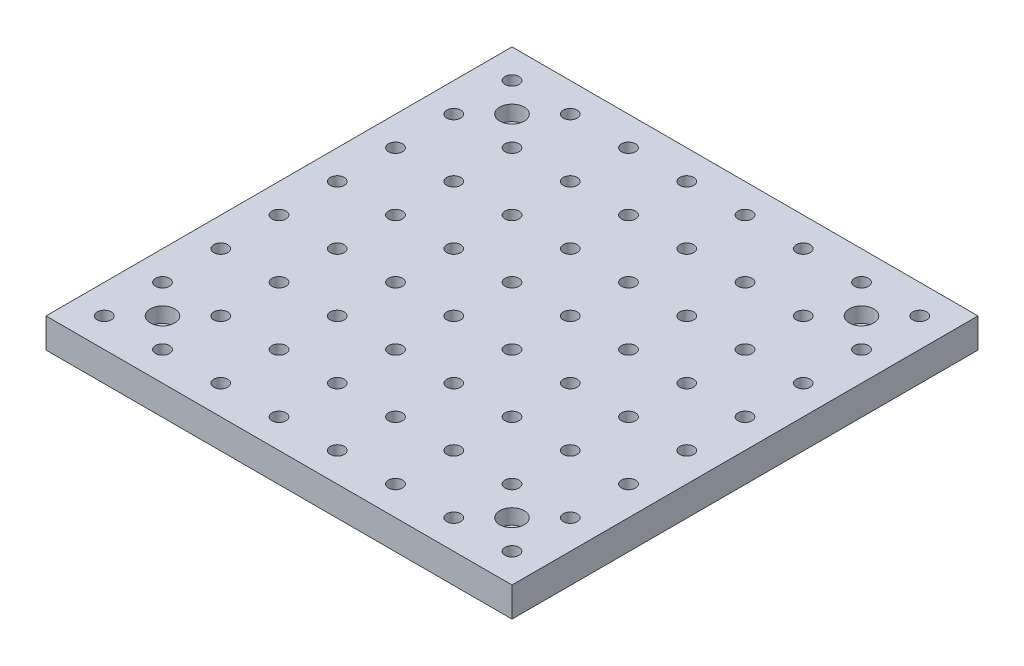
ISO-10303-21;
HEADER;
FILE_DESCRIPTION(('STEP AP214'),'2;1');
FILE_NAME('part.step','',(''),(''),'','','');
FILE_SCHEMA(('AUTOMOTIVE_DESIGN { 1 0 10303 214 1 1 1 1 }'));
ENDSEC;
DATA;
#1=APPLICATION_CONTEXT('core data for automotive mechanical design processes');
#2=APPLICATION_PROTOCOL_DEFINITION('international standard','automotive_design',2000,#1);
#3=PRODUCT_CONTEXT('',#1,'mechanical');
#4=PRODUCT('Part','Part','',(#3));
#5=PRODUCT_RELATED_PRODUCT_CATEGORY('part','',(#4));
#6=PRODUCT_DEFINITION_FORMATION('','',#4);
#7=PRODUCT_DEFINITION_CONTEXT('part definition',#1,'design');
#8=PRODUCT_DEFINITION('design','',#6,#7);
#9=PRODUCT_DEFINITION_SHAPE('','',#8);
#10=(LENGTH_UNIT() NAMED_UNIT(*) SI_UNIT(.MILLI.,.METRE.));
#11=(NAMED_UNIT(*) PLANE_ANGLE_UNIT() SI_UNIT($,.RADIAN.));
#12=(NAMED_UNIT(*) SI_UNIT($,.STERADIAN.) SOLID_ANGLE_UNIT());
#13=UNCERTAINTY_MEASURE_WITH_UNIT(LENGTH_MEASURE(1.E-05),#10,'distance_accuracy_value','');
#14=(GEOMETRIC_REPRESENTATION_CONTEXT(3) GLOBAL_UNCERTAINTY_ASSIGNED_CONTEXT((#13)) GLOBAL_UNIT_ASSIGNED_CONTEXT((#10,
#11,#12)) REPRESENTATION_CONTEXT('',''));
#15=CARTESIAN_POINT('',(0.,0.,0.));
#16=DIRECTION('',(0.,0.,1.));
#17=DIRECTION('',(1.,0.,0.));
#18=AXIS2_PLACEMENT_3D('',#15,#16,#17);
#19=CARTESIAN_POINT('',(-100.,-12.7,-100.));
#20=DIRECTION('',(-1.,0.,0.));
#21=DIRECTION('',(0.,0.,1.));
#22=AXIS2_PLACEMENT_3D('',#19,#20,#21);
#23=PLANE('',#22);
#24=DIRECTION('',(0.,0.,1.));
#25=VECTOR('',#24,1.);
#26=CARTESIAN_POINT('',(-100.,0.,-100.));
#27=LINE('',#26,#25);
#28=CARTESIAN_POINT('',(-100.,0.,-100.));
#29=VERTEX_POINT('',#28);
#30=CARTESIAN_POINT('',(-100.,0.,100.));
#31=VERTEX_POINT('',#30);
#32=EDGE_CURVE('E118',#29,#31,#27,.T.);
#33=ORIENTED_EDGE('',*,*,#32,.F.);
#34=DIRECTION('',(0.,1.,0.));
#35=VECTOR('',#34,1.);
#36=CARTESIAN_POINT('',(-100.,-12.7,-100.));
#37=LINE('',#36,#35);
#38=CARTESIAN_POINT('',(-100.,-12.7,-100.));
#39=VERTEX_POINT('',#38);
#40=EDGE_CURVE('E11',#39,#29,#37,.T.);
#41=ORIENTED_EDGE('',*,*,#40,.F.);
#42=DIRECTION('',(0.,0.,1.));
#43=VECTOR('',#42,1.);
#44=CARTESIAN_POINT('',(-100.,-12.7,-100.));
#45=LINE('',#44,#43);
#46=CARTESIAN_POINT('',(-100.,-12.7,100.));
#47=VERTEX_POINT('',#46);
#48=EDGE_CURVE('E109',#39,#47,#45,.T.);
#49=ORIENTED_EDGE('',*,*,#48,.T.);
#50=DIRECTION('',(0.,1.,0.));
#51=VECTOR('',#50,1.);
#52=CARTESIAN_POINT('',(-100.,-12.7,100.));
#53=LINE('',#52,#51);
#54=EDGE_CURVE('E89',#47,#31,#53,.T.);
#55=ORIENTED_EDGE('',*,*,#54,.T.);
#56=EDGE_LOOP('',(#33,#41,#49,#55));
#57=FACE_BOUND('',#56,.T.);
#58=ADVANCED_FACE('F45',(#57),#23,.T.);
#59=CARTESIAN_POINT('',(100.,-12.7,-100.));
#60=DIRECTION('',(0.,0.,-1.));
#61=DIRECTION('',(-1.,0.,0.));
#62=AXIS2_PLACEMENT_3D('',#59,#60,#61);
#63=PLANE('',#62);
#64=DIRECTION('',(-1.,0.,0.));
#65=VECTOR('',#64,1.);
#66=CARTESIAN_POINT('',(100.,0.,-100.));
#67=LINE('',#66,#65);
#68=CARTESIAN_POINT('',(100.,0.,-100.));
#69=VERTEX_POINT('',#68);
#70=EDGE_CURVE('E112',#69,#29,#67,.T.);
#71=ORIENTED_EDGE('',*,*,#70,.F.);
#72=DIRECTION('',(0.,1.,0.));
#73=VECTOR('',#72,1.);
#74=CARTESIAN_POINT('',(100.,-12.7,-100.));
#75=LINE('',#74,#73);
#76=CARTESIAN_POINT('',(100.,-12.7,-100.));
#77=VERTEX_POINT('',#76);
#78=EDGE_CURVE('E55',#77,#69,#75,.T.);
#79=ORIENTED_EDGE('',*,*,#78,.F.);
#80=DIRECTION('',(-1.,0.,0.));
#81=VECTOR('',#80,1.);
#82=CARTESIAN_POINT('',(100.,-12.7,-100.));
#83=LINE('',#82,#81);
#84=EDGE_CURVE('E104',#77,#39,#83,.T.);
#85=ORIENTED_EDGE('',*,*,#84,.T.);
#86=ORIENTED_EDGE('',*,*,#40,.T.);
#87=EDGE_LOOP('',(#71,#79,#85,#86));
#88=FACE_BOUND('',#87,.T.);
#89=ADVANCED_FACE('F716',(#88),#63,.T.);
#90=CARTESIAN_POINT('',(100.,-12.7,-100.));
#91=DIRECTION('',(1.,0.,0.));
#92=DIRECTION('',(0.,0.,-1.));
#93=AXIS2_PLACEMENT_3D('',#90,#91,#92);
#94=PLANE('',#93);
#95=DIRECTION('',(0.,0.,-1.));
#96=VECTOR('',#95,1.);
#97=CARTESIAN_POINT('',(100.,0.,-100.));
#98=LINE('',#97,#96);
#99=CARTESIAN_POINT('',(100.,0.,100.));
#100=VERTEX_POINT('',#99);
#101=EDGE_CURVE('E97',#100,#69,#98,.T.);
#102=ORIENTED_EDGE('',*,*,#101,.F.);
#103=DIRECTION('',(0.,1.,0.));
#104=VECTOR('',#103,1.);
#105=CARTESIAN_POINT('',(100.,-12.7,100.));
#106=LINE('',#105,#104);
#107=CARTESIAN_POINT('',(100.,-12.7,100.));
#108=VERTEX_POINT('',#107);
#109=EDGE_CURVE('E92',#108,#100,#106,.T.);
#110=ORIENTED_EDGE('',*,*,#109,.F.);
#111=DIRECTION('',(0.,0.,-1.));
#112=VECTOR('',#111,1.);
#113=CARTESIAN_POINT('',(100.,-12.7,-100.));
#114=LINE('',#113,#112);
#115=EDGE_CURVE('E95',#108,#77,#114,.T.);
#116=ORIENTED_EDGE('',*,*,#115,.T.);
#117=ORIENTED_EDGE('',*,*,#78,.T.);
#118=EDGE_LOOP('',(#102,#110,#116,#117));
#119=FACE_BOUND('',#118,.T.);
#120=ADVANCED_FACE('F94',(#119),#94,.T.);
#121=CARTESIAN_POINT('',(100.,-12.7,100.));
#122=DIRECTION('',(0.,0.,1.));
#123=DIRECTION('',(1.,0.,0.));
#124=AXIS2_PLACEMENT_3D('',#121,#122,#123);
#125=PLANE('',#124);
#126=DIRECTION('',(1.,0.,0.));
#127=VECTOR('',#126,1.);
#128=CARTESIAN_POINT('',(100.,0.,100.));
#129=LINE('',#128,#127);
#130=EDGE_CURVE('E122',#31,#100,#129,.T.);
#131=ORIENTED_EDGE('',*,*,#130,.F.);
#132=ORIENTED_EDGE('',*,*,#54,.F.);
#133=DIRECTION('',(1.,0.,0.));
#134=VECTOR('',#133,1.);
#135=CARTESIAN_POINT('',(100.,-12.7,100.));
#136=LINE('',#135,#134);
#137=EDGE_CURVE('E103',#47,#108,#136,.T.);
#138=ORIENTED_EDGE('',*,*,#137,.T.);
#139=ORIENTED_EDGE('',*,*,#109,.T.);
#140=EDGE_LOOP('',(#131,#132,#138,#139));
#141=FACE_BOUND('',#140,.T.);
#142=ADVANCED_FACE('F107',(#141),#125,.T.);
#143=CARTESIAN_POINT('',(0.,-12.7,0.));
#144=DIRECTION('',(0.,-1.,0.));
#145=DIRECTION('',(0.,0.,-1.));
#146=AXIS2_PLACEMENT_3D('',#143,#144,#145);
#147=PLANE('',#146);
#148=CARTESIAN_POINT('',(75.,-12.7,-75.));
#149=DIRECTION('',(0.,1.,0.));
#150=DIRECTION('',(0.,0.,-1.));
#151=AXIS2_PLACEMENT_3D('',#148,#149,#150);
#152=CIRCLE('',#151,1.65);
#153=CARTESIAN_POINT('',(75.,-12.7,-73.35));
#154=VERTEX_POINT('',#153);
#155=EDGE_CURVE('E161',#154,#154,#152,.T.);
#156=ORIENTED_EDGE('',*,*,#155,.T.);
#157=EDGE_LOOP('',(#156));
#158=FACE_BOUND('',#157,.T.);
#159=CARTESIAN_POINT('',(75.,-12.7,75.));
#160=DIRECTION('',(0.,-1.,0.));
#161=DIRECTION('',(0.,0.,1.));
#162=AXIS2_PLACEMENT_3D('',#159,#160,#161);
#163=CIRCLE('',#162,1.65);
#164=CARTESIAN_POINT('',(75.,-12.7,76.65));
#165=VERTEX_POINT('',#164);
#166=EDGE_CURVE('E148',#165,#165,#163,.T.);
#167=ORIENTED_EDGE('',*,*,#166,.F.);
#168=EDGE_LOOP('',(#167));
#169=FACE_BOUND('',#168,.T.);
#170=CARTESIAN_POINT('',(-75.,-12.7,-75.));
#171=DIRECTION('',(0.,-1.,0.));
#172=DIRECTION('',(0.,0.,-1.));
#173=AXIS2_PLACEMENT_3D('',#170,#171,#172);
#174=CIRCLE('',#173,1.65);
#175=CARTESIAN_POINT('',(-75.,-12.7,-73.35));
#176=VERTEX_POINT('',#175);
#177=EDGE_CURVE('E144',#176,#176,#174,.T.);
#178=ORIENTED_EDGE('',*,*,#177,.F.);
#179=EDGE_LOOP('',(#178));
#180=FACE_BOUND('',#179,.T.);
#181=CARTESIAN_POINT('',(-75.,-12.7,75.));
#182=DIRECTION('',(0.,1.,0.));
#183=DIRECTION('',(0.,0.,1.));
#184=AXIS2_PLACEMENT_3D('',#181,#182,#183);
#185=CIRCLE('',#184,1.65);
#186=CARTESIAN_POINT('',(-75.,-12.7,76.65));
#187=VERTEX_POINT('',#186);
#188=EDGE_CURVE('E140',#187,#187,#185,.T.);
#189=ORIENTED_EDGE('',*,*,#188,.T.);
#190=EDGE_LOOP('',(#189));
#191=FACE_BOUND('',#190,.T.);
#192=CARTESIAN_POINT('',(-87.5,-12.7,87.5));
#193=DIRECTION('',(0.,1.,0.));
#194=DIRECTION('',(0.,0.,1.));
#195=AXIS2_PLACEMENT_3D('',#192,#193,#194);
#196=CIRCLE('',#195,3.00000000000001);
#197=CARTESIAN_POINT('',(-87.5,-12.7,90.5));
#198=VERTEX_POINT('',#197);
#199=EDGE_CURVE('E199',#198,#198,#196,.T.);
#200=ORIENTED_EDGE('',*,*,#199,.T.);
#201=EDGE_LOOP('',(#200));
#202=FACE_BOUND('',#201,.T.);
#203=CARTESIAN_POINT('',(-87.5,-12.7,62.5));
#204=DIRECTION('',(0.,1.,0.));
#205=DIRECTION('',(0.,0.,1.));
#206=AXIS2_PLACEMENT_3D('',#203,#204,#205);
#207=CIRCLE('',#206,3.00000000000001);
#208=CARTESIAN_POINT('',(-87.5,-12.7,65.5));
#209=VERTEX_POINT('',#208);
#210=EDGE_CURVE('E207',#209,#209,#207,.T.);
#211=ORIENTED_EDGE('',*,*,#210,.T.);
#212=EDGE_LOOP('',(#211));
#213=FACE_BOUND('',#212,.T.);
#214=CARTESIAN_POINT('',(-87.5,-12.7,37.5));
#215=DIRECTION('',(0.,1.,0.));
#216=DIRECTION('',(0.,0.,1.));
#217=AXIS2_PLACEMENT_3D('',#214,#215,#216);
#218=CIRCLE('',#217,3.00000000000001);
#219=CARTESIAN_POINT('',(-87.5,-12.7,40.5000000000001));
#220=VERTEX_POINT('',#219);
#221=EDGE_CURVE('E215',#220,#220,#218,.T.);
#222=ORIENTED_EDGE('',*,*,#221,.T.);
#223=EDGE_LOOP('',(#222));
#224=FACE_BOUND('',#223,.T.);
#225=CARTESIAN_POINT('',(-87.5,-12.7,12.5));
#226=DIRECTION('',(0.,1.,0.));
#227=DIRECTION('',(0.,0.,1.));
#228=AXIS2_PLACEMENT_3D('',#225,#226,#227);
#229=CIRCLE('',#228,3.00000000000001);
#230=CARTESIAN_POINT('',(-87.5,-12.7,15.5));
#231=VERTEX_POINT('',#230);
#232=EDGE_CURVE('E223',#231,#231,#229,.T.);
#233=ORIENTED_EDGE('',*,*,#232,.T.);
#234=EDGE_LOOP('',(#233));
#235=FACE_BOUND('',#234,.T.);
#236=CARTESIAN_POINT('',(-87.5,-12.7,-12.5));
#237=DIRECTION('',(0.,1.,0.));
#238=DIRECTION('',(0.,0.,1.));
#239=AXIS2_PLACEMENT_3D('',#236,#237,#238);
#240=CIRCLE('',#239,3.00000000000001);
#241=CARTESIAN_POINT('',(-87.5,-12.7,-9.49999999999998));
#242=VERTEX_POINT('',#241);
#243=EDGE_CURVE('E231',#242,#242,#240,.T.);
#244=ORIENTED_EDGE('',*,*,#243,.T.);
#245=EDGE_LOOP('',(#244));
#246=FACE_BOUND('',#245,.T.);
#247=CARTESIAN_POINT('',(-87.5,-12.7,-37.5));
#248=DIRECTION('',(0.,1.,0.));
#249=DIRECTION('',(0.,0.,1.));
#250=AXIS2_PLACEMENT_3D('',#247,#248,#249);
#251=CIRCLE('',#250,3.00000000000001);
#252=CARTESIAN_POINT('',(-87.5,-12.7,-34.5));
#253=VERTEX_POINT('',#252);
#254=EDGE_CURVE('E239',#253,#253,#251,.T.);
#255=ORIENTED_EDGE('',*,*,#254,.T.);
#256=EDGE_LOOP('',(#255));
#257=FACE_BOUND('',#256,.T.);
#258=CARTESIAN_POINT('',(-87.5,-12.7,-62.5));
#259=DIRECTION('',(0.,1.,0.));
#260=DIRECTION('',(0.,0.,1.));
#261=AXIS2_PLACEMENT_3D('',#258,#259,#260);
#262=CIRCLE('',#261,3.00000000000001);
#263=CARTESIAN_POINT('',(-87.5,-12.7,-59.5));
#264=VERTEX_POINT('',#263);
#265=EDGE_CURVE('E247',#264,#264,#262,.T.);
#266=ORIENTED_EDGE('',*,*,#265,.T.);
#267=EDGE_LOOP('',(#266));
#268=FACE_BOUND('',#267,.T.);
#269=CARTESIAN_POINT('',(87.5,-12.7,87.5));
#270=DIRECTION('',(0.,1.,0.));
#271=DIRECTION('',(0.,0.,1.));
#272=AXIS2_PLACEMENT_3D('',#269,#270,#271);
#273=CIRCLE('',#272,3.00000000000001);
#274=CARTESIAN_POINT('',(87.5,-12.7,90.5));
#275=VERTEX_POINT('',#274);
#276=EDGE_CURVE('E255',#275,#275,#273,.T.);
#277=ORIENTED_EDGE('',*,*,#276,.T.);
#278=EDGE_LOOP('',(#277));
#279=FACE_BOUND('',#278,.T.);
#280=CARTESIAN_POINT('',(62.5,-12.7,87.5));
#281=DIRECTION('',(0.,1.,0.));
#282=DIRECTION('',(0.,0.,1.));
#283=AXIS2_PLACEMENT_3D('',#280,#281,#282);
#284=CIRCLE('',#283,3.00000000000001);
#285=CARTESIAN_POINT('',(62.5,-12.7,90.5));
#286=VERTEX_POINT('',#285);
#287=EDGE_CURVE('E263',#286,#286,#284,.T.);
#288=ORIENTED_EDGE('',*,*,#287,.T.);
#289=EDGE_LOOP('',(#288));
#290=FACE_BOUND('',#289,.T.);
#291=CARTESIAN_POINT('',(37.5,-12.7,87.5));
#292=DIRECTION('',(0.,1.,0.));
#293=DIRECTION('',(0.,0.,1.));
#294=AXIS2_PLACEMENT_3D('',#291,#292,#293);
#295=CIRCLE('',#294,3.00000000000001);
#296=CARTESIAN_POINT('',(37.5,-12.7,90.5));
#297=VERTEX_POINT('',#296);
#298=EDGE_CURVE('E271',#297,#297,#295,.T.);
#299=ORIENTED_EDGE('',*,*,#298,.T.);
#300=EDGE_LOOP('',(#299));
#301=FACE_BOUND('',#300,.T.);
#302=CARTESIAN_POINT('',(12.5,-12.7,87.5));
#303=DIRECTION('',(0.,1.,0.));
#304=DIRECTION('',(0.,0.,1.));
#305=AXIS2_PLACEMENT_3D('',#302,#303,#304);
#306=CIRCLE('',#305,3.00000000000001);
#307=CARTESIAN_POINT('',(12.5,-12.7,90.5));
#308=VERTEX_POINT('',#307);
#309=EDGE_CURVE('E279',#308,#308,#306,.T.);
#310=ORIENTED_EDGE('',*,*,#309,.T.);
#311=EDGE_LOOP('',(#310));
#312=FACE_BOUND('',#311,.T.);
#313=CARTESIAN_POINT('',(-12.5,-12.7,87.5));
#314=DIRECTION('',(0.,1.,0.));
#315=DIRECTION('',(0.,0.,1.));
#316=AXIS2_PLACEMENT_3D('',#313,#314,#315);
#317=CIRCLE('',#316,3.00000000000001);
#318=CARTESIAN_POINT('',(-12.5,-12.7,90.5));
#319=VERTEX_POINT('',#318);
#320=EDGE_CURVE('E287',#319,#319,#317,.T.);
#321=ORIENTED_EDGE('',*,*,#320,.T.);
#322=EDGE_LOOP('',(#321));
#323=FACE_BOUND('',#322,.T.);
#324=CARTESIAN_POINT('',(-37.5,-12.7,87.5));
#325=DIRECTION('',(0.,1.,0.));
#326=DIRECTION('',(0.,0.,1.));
#327=AXIS2_PLACEMENT_3D('',#324,#325,#326);
#328=CIRCLE('',#327,3.00000000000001);
#329=CARTESIAN_POINT('',(-37.5,-12.7,90.5));
#330=VERTEX_POINT('',#329);
#331=EDGE_CURVE('E295',#330,#330,#328,.T.);
#332=ORIENTED_EDGE('',*,*,#331,.T.);
#333=EDGE_LOOP('',(#332));
#334=FACE_BOUND('',#333,.T.);
#335=CARTESIAN_POINT('',(-62.5,-12.7,87.5));
#336=DIRECTION('',(0.,1.,0.));
#337=DIRECTION('',(0.,0.,1.));
#338=AXIS2_PLACEMENT_3D('',#335,#336,#337);
#339=CIRCLE('',#338,3.00000000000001);
#340=CARTESIAN_POINT('',(-62.5,-12.7,90.5));
#341=VERTEX_POINT('',#340);
#342=EDGE_CURVE('E303',#341,#341,#339,.T.);
#343=ORIENTED_EDGE('',*,*,#342,.T.);
#344=EDGE_LOOP('',(#343));
#345=FACE_BOUND('',#344,.T.);
#346=CARTESIAN_POINT('',(87.5,-12.7,62.5));
#347=DIRECTION('',(0.,1.,0.));
#348=DIRECTION('',(0.,0.,1.));
#349=AXIS2_PLACEMENT_3D('',#346,#347,#348);
#350=CIRCLE('',#349,3.00000000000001);
#351=CARTESIAN_POINT('',(87.5,-12.7,65.5));
#352=VERTEX_POINT('',#351);
#353=EDGE_CURVE('E311',#352,#352,#350,.T.);
#354=ORIENTED_EDGE('',*,*,#353,.T.);
#355=EDGE_LOOP('',(#354));
#356=FACE_BOUND('',#355,.T.);
#357=CARTESIAN_POINT('',(62.5,-12.7,62.5));
#358=DIRECTION('',(0.,1.,0.));
#359=DIRECTION('',(0.,0.,1.));
#360=AXIS2_PLACEMENT_3D('',#357,#358,#359);
#361=CIRCLE('',#360,3.00000000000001);
#362=CARTESIAN_POINT('',(62.5,-12.7,65.5));
#363=VERTEX_POINT('',#362);
#364=EDGE_CURVE('E319',#363,#363,#361,.T.);
#365=ORIENTED_EDGE('',*,*,#364,.T.);
#366=EDGE_LOOP('',(#365));
#367=FACE_BOUND('',#366,.T.);
#368=CARTESIAN_POINT('',(37.5,-12.7,62.5));
#369=DIRECTION('',(0.,1.,0.));
#370=DIRECTION('',(0.,0.,1.));
#371=AXIS2_PLACEMENT_3D('',#368,#369,#370);
#372=CIRCLE('',#371,3.00000000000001);
#373=CARTESIAN_POINT('',(37.5,-12.7,65.5));
#374=VERTEX_POINT('',#373);
#375=EDGE_CURVE('E327',#374,#374,#372,.T.);
#376=ORIENTED_EDGE('',*,*,#375,.T.);
#377=EDGE_LOOP('',(#376));
#378=FACE_BOUND('',#377,.T.);
#379=CARTESIAN_POINT('',(12.5,-12.7,62.5));
#380=DIRECTION('',(0.,1.,0.));
#381=DIRECTION('',(0.,0.,1.));
#382=AXIS2_PLACEMENT_3D('',#379,#380,#381);
#383=CIRCLE('',#382,3.00000000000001);
#384=CARTESIAN_POINT('',(12.5,-12.7,65.5));
#385=VERTEX_POINT('',#384);
#386=EDGE_CURVE('E335',#385,#385,#383,.T.);
#387=ORIENTED_EDGE('',*,*,#386,.T.);
#388=EDGE_LOOP('',(#387));
#389=FACE_BOUND('',#388,.T.);
#390=CARTESIAN_POINT('',(-12.5,-12.7,62.5));
#391=DIRECTION('',(0.,1.,0.));
#392=DIRECTION('',(0.,0.,1.));
#393=AXIS2_PLACEMENT_3D('',#390,#391,#392);
#394=CIRCLE('',#393,3.00000000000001);
#395=CARTESIAN_POINT('',(-12.5,-12.7,65.5));
#396=VERTEX_POINT('',#395);
#397=EDGE_CURVE('E343',#396,#396,#394,.T.);
#398=ORIENTED_EDGE('',*,*,#397,.T.);
#399=EDGE_LOOP('',(#398));
#400=FACE_BOUND('',#399,.T.);
#401=CARTESIAN_POINT('',(-37.5,-12.7,62.5));
#402=DIRECTION('',(0.,1.,0.));
#403=DIRECTION('',(0.,0.,1.));
#404=AXIS2_PLACEMENT_3D('',#401,#402,#403);
#405=CIRCLE('',#404,3.00000000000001);
#406=CARTESIAN_POINT('',(-37.5,-12.7,65.5));
#407=VERTEX_POINT('',#406);
#408=EDGE_CURVE('E351',#407,#407,#405,.T.);
#409=ORIENTED_EDGE('',*,*,#408,.T.);
#410=EDGE_LOOP('',(#409));
#411=FACE_BOUND('',#410,.T.);
#412=CARTESIAN_POINT('',(-62.5,-12.7,62.5));
#413=DIRECTION('',(0.,1.,0.));
#414=DIRECTION('',(0.,0.,1.));
#415=AXIS2_PLACEMENT_3D('',#412,#413,#414);
#416=CIRCLE('',#415,3.00000000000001);
#417=CARTESIAN_POINT('',(-62.5,-12.7,65.5));
#418=VERTEX_POINT('',#417);
#419=EDGE_CURVE('E359',#418,#418,#416,.T.);
#420=ORIENTED_EDGE('',*,*,#419,.T.);
#421=EDGE_LOOP('',(#420));
#422=FACE_BOUND('',#421,.T.);
#423=CARTESIAN_POINT('',(87.5,-12.7,37.5));
#424=DIRECTION('',(0.,1.,0.));
#425=DIRECTION('',(0.,0.,1.));
#426=AXIS2_PLACEMENT_3D('',#423,#424,#425);
#427=CIRCLE('',#426,3.00000000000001);
#428=CARTESIAN_POINT('',(87.5,-12.7,40.5000000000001));
#429=VERTEX_POINT('',#428);
#430=EDGE_CURVE('E367',#429,#429,#427,.T.);
#431=ORIENTED_EDGE('',*,*,#430,.T.);
#432=EDGE_LOOP('',(#431));
#433=FACE_BOUND('',#432,.T.);
#434=CARTESIAN_POINT('',(62.5,-12.7,37.5));
#435=DIRECTION('',(0.,1.,0.));
#436=DIRECTION('',(0.,0.,1.));
#437=AXIS2_PLACEMENT_3D('',#434,#435,#436);
#438=CIRCLE('',#437,3.00000000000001);
#439=CARTESIAN_POINT('',(62.5,-12.7,40.5000000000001));
#440=VERTEX_POINT('',#439);
#441=EDGE_CURVE('E375',#440,#440,#438,.T.);
#442=ORIENTED_EDGE('',*,*,#441,.T.);
#443=EDGE_LOOP('',(#442));
#444=FACE_BOUND('',#443,.T.);
#445=CARTESIAN_POINT('',(37.5,-12.7,37.5));
#446=DIRECTION('',(0.,1.,0.));
#447=DIRECTION('',(0.,0.,1.));
#448=AXIS2_PLACEMENT_3D('',#445,#446,#447);
#449=CIRCLE('',#448,3.00000000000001);
#450=CARTESIAN_POINT('',(37.5,-12.7,40.5000000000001));
#451=VERTEX_POINT('',#450);
#452=EDGE_CURVE('E383',#451,#451,#449,.T.);
#453=ORIENTED_EDGE('',*,*,#452,.T.);
#454=EDGE_LOOP('',(#453));
#455=FACE_BOUND('',#454,.T.);
#456=CARTESIAN_POINT('',(12.5,-12.7,37.5));
#457=DIRECTION('',(0.,1.,0.));
#458=DIRECTION('',(0.,0.,1.));
#459=AXIS2_PLACEMENT_3D('',#456,#457,#458);
#460=CIRCLE('',#459,3.00000000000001);
#461=CARTESIAN_POINT('',(12.5,-12.7,40.5000000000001));
#462=VERTEX_POINT('',#461);
#463=EDGE_CURVE('E391',#462,#462,#460,.T.);
#464=ORIENTED_EDGE('',*,*,#463,.T.);
#465=EDGE_LOOP('',(#464));
#466=FACE_BOUND('',#465,.T.);
#467=CARTESIAN_POINT('',(-12.5,-12.7,37.5));
#468=DIRECTION('',(0.,1.,0.));
#469=DIRECTION('',(0.,0.,1.));
#470=AXIS2_PLACEMENT_3D('',#467,#468,#469);
#471=CIRCLE('',#470,3.00000000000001);
#472=CARTESIAN_POINT('',(-12.5,-12.7,40.5000000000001));
#473=VERTEX_POINT('',#472);
#474=EDGE_CURVE('E399',#473,#473,#471,.T.);
#475=ORIENTED_EDGE('',*,*,#474,.T.);
#476=EDGE_LOOP('',(#475));
#477=FACE_BOUND('',#476,.T.);
#478=CARTESIAN_POINT('',(-37.5,-12.7,37.5));
#479=DIRECTION('',(0.,1.,0.));
#480=DIRECTION('',(0.,0.,1.));
#481=AXIS2_PLACEMENT_3D('',#478,#479,#480);
#482=CIRCLE('',#481,3.00000000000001);
#483=CARTESIAN_POINT('',(-37.5,-12.7,40.5000000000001));
#484=VERTEX_POINT('',#483);
#485=EDGE_CURVE('E407',#484,#484,#482,.T.);
#486=ORIENTED_EDGE('',*,*,#485,.T.);
#487=EDGE_LOOP('',(#486));
#488=FACE_BOUND('',#487,.T.);
#489=CARTESIAN_POINT('',(-62.5,-12.7,37.5));
#490=DIRECTION('',(0.,1.,0.));
#491=DIRECTION('',(0.,0.,1.));
#492=AXIS2_PLACEMENT_3D('',#489,#490,#491);
#493=CIRCLE('',#492,3.00000000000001);
#494=CARTESIAN_POINT('',(-62.5,-12.7,40.5000000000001));
#495=VERTEX_POINT('',#494);
#496=EDGE_CURVE('E415',#495,#495,#493,.T.);
#497=ORIENTED_EDGE('',*,*,#496,.T.);
#498=EDGE_LOOP('',(#497));
#499=FACE_BOUND('',#498,.T.);
#500=CARTESIAN_POINT('',(87.4999999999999,-12.7,12.5));
#501=DIRECTION('',(0.,1.,0.));
#502=DIRECTION('',(0.,0.,1.));
#503=AXIS2_PLACEMENT_3D('',#500,#501,#502);
#504=CIRCLE('',#503,3.00000000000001);
#505=CARTESIAN_POINT('',(87.4999999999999,-12.7,15.5));
#506=VERTEX_POINT('',#505);
#507=EDGE_CURVE('E423',#506,#506,#504,.T.);
#508=ORIENTED_EDGE('',*,*,#507,.T.);
#509=EDGE_LOOP('',(#508));
#510=FACE_BOUND('',#509,.T.);
#511=CARTESIAN_POINT('',(62.4999999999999,-12.7,12.5));
#512=DIRECTION('',(0.,1.,0.));
#513=DIRECTION('',(0.,0.,1.));
#514=AXIS2_PLACEMENT_3D('',#511,#512,#513);
#515=CIRCLE('',#514,3.00000000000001);
#516=CARTESIAN_POINT('',(62.4999999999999,-12.7,15.5));
#517=VERTEX_POINT('',#516);
#518=EDGE_CURVE('E431',#517,#517,#515,.T.);
#519=ORIENTED_EDGE('',*,*,#518,.T.);
#520=EDGE_LOOP('',(#519));
#521=FACE_BOUND('',#520,.T.);
#522=CARTESIAN_POINT('',(37.5,-12.7,12.5));
#523=DIRECTION('',(0.,1.,0.));
#524=DIRECTION('',(0.,0.,1.));
#525=AXIS2_PLACEMENT_3D('',#522,#523,#524);
#526=CIRCLE('',#525,3.00000000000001);
#527=CARTESIAN_POINT('',(37.5,-12.7,15.5));
#528=VERTEX_POINT('',#527);
#529=EDGE_CURVE('E439',#528,#528,#526,.T.);
#530=ORIENTED_EDGE('',*,*,#529,.T.);
#531=EDGE_LOOP('',(#530));
#532=FACE_BOUND('',#531,.T.);
#533=CARTESIAN_POINT('',(12.5,-12.7,12.5));
#534=DIRECTION('',(0.,1.,0.));
#535=DIRECTION('',(0.,0.,1.));
#536=AXIS2_PLACEMENT_3D('',#533,#534,#535);
#537=CIRCLE('',#536,3.00000000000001);
#538=CARTESIAN_POINT('',(12.5,-12.7,15.5));
#539=VERTEX_POINT('',#538);
#540=EDGE_CURVE('E447',#539,#539,#537,.T.);
#541=ORIENTED_EDGE('',*,*,#540,.T.);
#542=EDGE_LOOP('',(#541));
#543=FACE_BOUND('',#542,.T.);
#544=CARTESIAN_POINT('',(-12.5,-12.7,12.5));
#545=DIRECTION('',(0.,1.,0.));
#546=DIRECTION('',(0.,0.,1.));
#547=AXIS2_PLACEMENT_3D('',#544,#545,#546);
#548=CIRCLE('',#547,3.00000000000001);
#549=CARTESIAN_POINT('',(-12.5,-12.7,15.5));
#550=VERTEX_POINT('',#549);
#551=EDGE_CURVE('E455',#550,#550,#548,.T.);
#552=ORIENTED_EDGE('',*,*,#551,.T.);
#553=EDGE_LOOP('',(#552));
#554=FACE_BOUND('',#553,.T.);
#555=CARTESIAN_POINT('',(-37.5,-12.7,12.5));
#556=DIRECTION('',(0.,1.,0.));
#557=DIRECTION('',(0.,0.,1.));
#558=AXIS2_PLACEMENT_3D('',#555,#556,#557);
#559=CIRCLE('',#558,3.00000000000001);
#560=CARTESIAN_POINT('',(-37.5,-12.7,15.5));
#561=VERTEX_POINT('',#560);
#562=EDGE_CURVE('E463',#561,#561,#559,.T.);
#563=ORIENTED_EDGE('',*,*,#562,.T.);
#564=EDGE_LOOP('',(#563));
#565=FACE_BOUND('',#564,.T.);
#566=CARTESIAN_POINT('',(-62.5,-12.7,12.5));
#567=DIRECTION('',(0.,1.,0.));
#568=DIRECTION('',(0.,0.,1.));
#569=AXIS2_PLACEMENT_3D('',#566,#567,#568);
#570=CIRCLE('',#569,3.00000000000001);
#571=CARTESIAN_POINT('',(-62.5,-12.7,15.5));
#572=VERTEX_POINT('',#571);
#573=EDGE_CURVE('E471',#572,#572,#570,.T.);
#574=ORIENTED_EDGE('',*,*,#573,.T.);
#575=EDGE_LOOP('',(#574));
#576=FACE_BOUND('',#575,.T.);
#577=CARTESIAN_POINT('',(87.4999999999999,-12.7,-12.5));
#578=DIRECTION('',(0.,1.,0.));
#579=DIRECTION('',(0.,0.,1.));
#580=AXIS2_PLACEMENT_3D('',#577,#578,#579);
#581=CIRCLE('',#580,3.00000000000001);
#582=CARTESIAN_POINT('',(87.4999999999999,-12.7,-9.49999999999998));
#583=VERTEX_POINT('',#582);
#584=EDGE_CURVE('E479',#583,#583,#581,.T.);
#585=ORIENTED_EDGE('',*,*,#584,.T.);
#586=EDGE_LOOP('',(#585));
#587=FACE_BOUND('',#586,.T.);
#588=CARTESIAN_POINT('',(62.4999999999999,-12.7,-12.5));
#589=DIRECTION('',(0.,1.,0.));
#590=DIRECTION('',(0.,0.,1.));
#591=AXIS2_PLACEMENT_3D('',#588,#589,#590);
#592=CIRCLE('',#591,3.00000000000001);
#593=CARTESIAN_POINT('',(62.4999999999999,-12.7,-9.49999999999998));
#594=VERTEX_POINT('',#593);
#595=EDGE_CURVE('E487',#594,#594,#592,.T.);
#596=ORIENTED_EDGE('',*,*,#595,.T.);
#597=EDGE_LOOP('',(#596));
#598=FACE_BOUND('',#597,.T.);
#599=CARTESIAN_POINT('',(37.5,-12.7,-12.5));
#600=DIRECTION('',(0.,1.,0.));
#601=DIRECTION('',(0.,0.,1.));
#602=AXIS2_PLACEMENT_3D('',#599,#600,#601);
#603=CIRCLE('',#602,3.00000000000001);
#604=CARTESIAN_POINT('',(37.5,-12.7,-9.49999999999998));
#605=VERTEX_POINT('',#604);
#606=EDGE_CURVE('E495',#605,#605,#603,.T.);
#607=ORIENTED_EDGE('',*,*,#606,.T.);
#608=EDGE_LOOP('',(#607));
#609=FACE_BOUND('',#608,.T.);
#610=CARTESIAN_POINT('',(12.5,-12.7,-12.5));
#611=DIRECTION('',(0.,1.,0.));
#612=DIRECTION('',(0.,0.,1.));
#613=AXIS2_PLACEMENT_3D('',#610,#611,#612);
#614=CIRCLE('',#613,3.00000000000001);
#615=CARTESIAN_POINT('',(12.5,-12.7,-9.49999999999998));
#616=VERTEX_POINT('',#615);
#617=EDGE_CURVE('E503',#616,#616,#614,.T.);
#618=ORIENTED_EDGE('',*,*,#617,.T.);
#619=EDGE_LOOP('',(#618));
#620=FACE_BOUND('',#619,.T.);
#621=CARTESIAN_POINT('',(-12.5,-12.7,-12.5));
#622=DIRECTION('',(0.,1.,0.));
#623=DIRECTION('',(0.,0.,1.));
#624=AXIS2_PLACEMENT_3D('',#621,#622,#623);
#625=CIRCLE('',#624,3.00000000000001);
#626=CARTESIAN_POINT('',(-12.5,-12.7,-9.49999999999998));
#627=VERTEX_POINT('',#626);
#628=EDGE_CURVE('E511',#627,#627,#625,.T.);
#629=ORIENTED_EDGE('',*,*,#628,.T.);
#630=EDGE_LOOP('',(#629));
#631=FACE_BOUND('',#630,.T.);
#632=CARTESIAN_POINT('',(-37.5,-12.7,-12.5));
#633=DIRECTION('',(0.,1.,0.));
#634=DIRECTION('',(0.,0.,1.));
#635=AXIS2_PLACEMENT_3D('',#632,#633,#634);
#636=CIRCLE('',#635,3.00000000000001);
#637=CARTESIAN_POINT('',(-37.5,-12.7,-9.49999999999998));
#638=VERTEX_POINT('',#637);
#639=EDGE_CURVE('E519',#638,#638,#636,.T.);
#640=ORIENTED_EDGE('',*,*,#639,.T.);
#641=EDGE_LOOP('',(#640));
#642=FACE_BOUND('',#641,.T.);
#643=CARTESIAN_POINT('',(-62.5,-12.7,-12.5));
#644=DIRECTION('',(0.,1.,0.));
#645=DIRECTION('',(0.,0.,1.));
#646=AXIS2_PLACEMENT_3D('',#643,#644,#645);
#647=CIRCLE('',#646,3.00000000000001);
#648=CARTESIAN_POINT('',(-62.5,-12.7,-9.49999999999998));
#649=VERTEX_POINT('',#648);
#650=EDGE_CURVE('E527',#649,#649,#647,.T.);
#651=ORIENTED_EDGE('',*,*,#650,.T.);
#652=EDGE_LOOP('',(#651));
#653=FACE_BOUND('',#652,.T.);
#654=CARTESIAN_POINT('',(87.4999999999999,-12.7,-37.5));
#655=DIRECTION('',(0.,1.,0.));
#656=DIRECTION('',(0.,0.,1.));
#657=AXIS2_PLACEMENT_3D('',#654,#655,#656);
#658=CIRCLE('',#657,3.00000000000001);
#659=CARTESIAN_POINT('',(87.4999999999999,-12.7,-34.5));
#660=VERTEX_POINT('',#659);
#661=EDGE_CURVE('E535',#660,#660,#658,.T.);
#662=ORIENTED_EDGE('',*,*,#661,.T.);
#663=EDGE_LOOP('',(#662));
#664=FACE_BOUND('',#663,.T.);
#665=CARTESIAN_POINT('',(62.4999999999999,-12.7,-37.5));
#666=DIRECTION('',(0.,1.,0.));
#667=DIRECTION('',(0.,0.,1.));
#668=AXIS2_PLACEMENT_3D('',#665,#666,#667);
#669=CIRCLE('',#668,3.00000000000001);
#670=CARTESIAN_POINT('',(62.4999999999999,-12.7,-34.5));
#671=VERTEX_POINT('',#670);
#672=EDGE_CURVE('E543',#671,#671,#669,.T.);
#673=ORIENTED_EDGE('',*,*,#672,.T.);
#674=EDGE_LOOP('',(#673));
#675=FACE_BOUND('',#674,.T.);
#676=CARTESIAN_POINT('',(37.5,-12.7,-37.5));
#677=DIRECTION('',(0.,1.,0.));
#678=DIRECTION('',(0.,0.,1.));
#679=AXIS2_PLACEMENT_3D('',#676,#677,#678);
#680=CIRCLE('',#679,3.00000000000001);
#681=CARTESIAN_POINT('',(37.5,-12.7,-34.5));
#682=VERTEX_POINT('',#681);
#683=EDGE_CURVE('E551',#682,#682,#680,.T.);
#684=ORIENTED_EDGE('',*,*,#683,.T.);
#685=EDGE_LOOP('',(#684));
#686=FACE_BOUND('',#685,.T.);
#687=CARTESIAN_POINT('',(12.5,-12.7,-37.5));
#688=DIRECTION('',(0.,1.,0.));
#689=DIRECTION('',(0.,0.,1.));
#690=AXIS2_PLACEMENT_3D('',#687,#688,#689);
#691=CIRCLE('',#690,3.00000000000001);
#692=CARTESIAN_POINT('',(12.5,-12.7,-34.5));
#693=VERTEX_POINT('',#692);
#694=EDGE_CURVE('E559',#693,#693,#691,.T.);
#695=ORIENTED_EDGE('',*,*,#694,.T.);
#696=EDGE_LOOP('',(#695));
#697=FACE_BOUND('',#696,.T.);
#698=CARTESIAN_POINT('',(-12.5,-12.7,-37.5));
#699=DIRECTION('',(0.,1.,0.));
#700=DIRECTION('',(0.,0.,1.));
#701=AXIS2_PLACEMENT_3D('',#698,#699,#700);
#702=CIRCLE('',#701,3.00000000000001);
#703=CARTESIAN_POINT('',(-12.5,-12.7,-34.5));
#704=VERTEX_POINT('',#703);
#705=EDGE_CURVE('E567',#704,#704,#702,.T.);
#706=ORIENTED_EDGE('',*,*,#705,.T.);
#707=EDGE_LOOP('',(#706));
#708=FACE_BOUND('',#707,.T.);
#709=CARTESIAN_POINT('',(-37.5,-12.7,-37.5));
#710=DIRECTION('',(0.,1.,0.));
#711=DIRECTION('',(0.,0.,1.));
#712=AXIS2_PLACEMENT_3D('',#709,#710,#711);
#713=CIRCLE('',#712,3.00000000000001);
#714=CARTESIAN_POINT('',(-37.5,-12.7,-34.5));
#715=VERTEX_POINT('',#714);
#716=EDGE_CURVE('E575',#715,#715,#713,.T.);
#717=ORIENTED_EDGE('',*,*,#716,.T.);
#718=EDGE_LOOP('',(#717));
#719=FACE_BOUND('',#718,.T.);
#720=CARTESIAN_POINT('',(-62.5,-12.7,-37.5));
#721=DIRECTION('',(0.,1.,0.));
#722=DIRECTION('',(0.,0.,1.));
#723=AXIS2_PLACEMENT_3D('',#720,#721,#722);
#724=CIRCLE('',#723,3.00000000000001);
#725=CARTESIAN_POINT('',(-62.5,-12.7,-34.5));
#726=VERTEX_POINT('',#725);
#727=EDGE_CURVE('E583',#726,#726,#724,.T.);
#728=ORIENTED_EDGE('',*,*,#727,.T.);
#729=EDGE_LOOP('',(#728));
#730=FACE_BOUND('',#729,.T.);
#731=CARTESIAN_POINT('',(87.4999999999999,-12.7,-62.5));
#732=DIRECTION('',(0.,1.,0.));
#733=DIRECTION('',(0.,0.,1.));
#734=AXIS2_PLACEMENT_3D('',#731,#732,#733);
#735=CIRCLE('',#734,3.00000000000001);
#736=CARTESIAN_POINT('',(87.4999999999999,-12.7,-59.5));
#737=VERTEX_POINT('',#736);
#738=EDGE_CURVE('E591',#737,#737,#735,.T.);
#739=ORIENTED_EDGE('',*,*,#738,.T.);
#740=EDGE_LOOP('',(#739));
#741=FACE_BOUND('',#740,.T.);
#742=CARTESIAN_POINT('',(62.4999999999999,-12.7,-62.5));
#743=DIRECTION('',(0.,1.,0.));
#744=DIRECTION('',(0.,0.,1.));
#745=AXIS2_PLACEMENT_3D('',#742,#743,#744);
#746=CIRCLE('',#745,3.00000000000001);
#747=CARTESIAN_POINT('',(62.4999999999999,-12.7,-59.5));
#748=VERTEX_POINT('',#747);
#749=EDGE_CURVE('E599',#748,#748,#746,.T.);
#750=ORIENTED_EDGE('',*,*,#749,.T.);
#751=EDGE_LOOP('',(#750));
#752=FACE_BOUND('',#751,.T.);
#753=CARTESIAN_POINT('',(37.5,-12.7,-62.5));
#754=DIRECTION('',(0.,1.,0.));
#755=DIRECTION('',(0.,0.,1.));
#756=AXIS2_PLACEMENT_3D('',#753,#754,#755);
#757=CIRCLE('',#756,3.00000000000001);
#758=CARTESIAN_POINT('',(37.5,-12.7,-59.5));
#759=VERTEX_POINT('',#758);
#760=EDGE_CURVE('E607',#759,#759,#757,.T.);
#761=ORIENTED_EDGE('',*,*,#760,.T.);
#762=EDGE_LOOP('',(#761));
#763=FACE_BOUND('',#762,.T.);
#764=CARTESIAN_POINT('',(12.5,-12.7,-62.5));
#765=DIRECTION('',(0.,1.,0.));
#766=DIRECTION('',(0.,0.,1.));
#767=AXIS2_PLACEMENT_3D('',#764,#765,#766);
#768=CIRCLE('',#767,3.00000000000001);
#769=CARTESIAN_POINT('',(12.5,-12.7,-59.5));
#770=VERTEX_POINT('',#769);
#771=EDGE_CURVE('E615',#770,#770,#768,.T.);
#772=ORIENTED_EDGE('',*,*,#771,.T.);
#773=EDGE_LOOP('',(#772));
#774=FACE_BOUND('',#773,.T.);
#775=CARTESIAN_POINT('',(-12.5,-12.7,-62.5));
#776=DIRECTION('',(0.,1.,0.));
#777=DIRECTION('',(0.,0.,1.));
#778=AXIS2_PLACEMENT_3D('',#775,#776,#777);
#779=CIRCLE('',#778,3.00000000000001);
#780=CARTESIAN_POINT('',(-12.5,-12.7,-59.5));
#781=VERTEX_POINT('',#780);
#782=EDGE_CURVE('E623',#781,#781,#779,.T.);
#783=ORIENTED_EDGE('',*,*,#782,.T.);
#784=EDGE_LOOP('',(#783));
#785=FACE_BOUND('',#784,.T.);
#786=CARTESIAN_POINT('',(-37.5,-12.7,-62.5));
#787=DIRECTION('',(0.,1.,0.));
#788=DIRECTION('',(0.,0.,1.));
#789=AXIS2_PLACEMENT_3D('',#786,#787,#788);
#790=CIRCLE('',#789,3.00000000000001);
#791=CARTESIAN_POINT('',(-37.5,-12.7,-59.5));
#792=VERTEX_POINT('',#791);
#793=EDGE_CURVE('E631',#792,#792,#790,.T.);
#794=ORIENTED_EDGE('',*,*,#793,.T.);
#795=EDGE_LOOP('',(#794));
#796=FACE_BOUND('',#795,.T.);
#797=CARTESIAN_POINT('',(-62.5,-12.7,-62.5));
#798=DIRECTION('',(0.,1.,0.));
#799=DIRECTION('',(0.,0.,1.));
#800=AXIS2_PLACEMENT_3D('',#797,#798,#799);
#801=CIRCLE('',#800,3.00000000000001);
#802=CARTESIAN_POINT('',(-62.5,-12.7,-59.5));
#803=VERTEX_POINT('',#802);
#804=EDGE_CURVE('E639',#803,#803,#801,.T.);
#805=ORIENTED_EDGE('',*,*,#804,.T.);
#806=EDGE_LOOP('',(#805));
#807=FACE_BOUND('',#806,.T.);
#808=CARTESIAN_POINT('',(87.5,-12.7,-87.5));
#809=DIRECTION('',(0.,1.,0.));
#810=DIRECTION('',(0.,0.,1.));
#811=AXIS2_PLACEMENT_3D('',#808,#809,#810);
#812=CIRCLE('',#811,3.00000000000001);
#813=CARTESIAN_POINT('',(87.5,-12.7,-84.5));
#814=VERTEX_POINT('',#813);
#815=EDGE_CURVE('E647',#814,#814,#812,.T.);
#816=ORIENTED_EDGE('',*,*,#815,.T.);
#817=EDGE_LOOP('',(#816));
#818=FACE_BOUND('',#817,.T.);
#819=CARTESIAN_POINT('',(62.5,-12.7,-87.5));
#820=DIRECTION('',(0.,1.,0.));
#821=DIRECTION('',(0.,0.,1.));
#822=AXIS2_PLACEMENT_3D('',#819,#820,#821);
#823=CIRCLE('',#822,3.00000000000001);
#824=CARTESIAN_POINT('',(62.5,-12.7,-84.5));
#825=VERTEX_POINT('',#824);
#826=EDGE_CURVE('E655',#825,#825,#823,.T.);
#827=ORIENTED_EDGE('',*,*,#826,.T.);
#828=EDGE_LOOP('',(#827));
#829=FACE_BOUND('',#828,.T.);
#830=CARTESIAN_POINT('',(37.5,-12.7,-87.5));
#831=DIRECTION('',(0.,1.,0.));
#832=DIRECTION('',(0.,0.,1.));
#833=AXIS2_PLACEMENT_3D('',#830,#831,#832);
#834=CIRCLE('',#833,3.00000000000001);
#835=CARTESIAN_POINT('',(37.5,-12.7,-84.5));
#836=VERTEX_POINT('',#835);
#837=EDGE_CURVE('E663',#836,#836,#834,.T.);
#838=ORIENTED_EDGE('',*,*,#837,.T.);
#839=EDGE_LOOP('',(#838));
#840=FACE_BOUND('',#839,.T.);
#841=CARTESIAN_POINT('',(12.5,-12.7,-87.5));
#842=DIRECTION('',(0.,1.,0.));
#843=DIRECTION('',(0.,0.,1.));
#844=AXIS2_PLACEMENT_3D('',#841,#842,#843);
#845=CIRCLE('',#844,3.00000000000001);
#846=CARTESIAN_POINT('',(12.5,-12.7,-84.5));
#847=VERTEX_POINT('',#846);
#848=EDGE_CURVE('E671',#847,#847,#845,.T.);
#849=ORIENTED_EDGE('',*,*,#848,.T.);
#850=EDGE_LOOP('',(#849));
#851=FACE_BOUND('',#850,.T.);
#852=CARTESIAN_POINT('',(-12.5,-12.7,-87.5));
#853=DIRECTION('',(0.,1.,0.));
#854=DIRECTION('',(0.,0.,1.));
#855=AXIS2_PLACEMENT_3D('',#852,#853,#854);
#856=CIRCLE('',#855,3.00000000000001);
#857=CARTESIAN_POINT('',(-12.5,-12.7,-84.5));
#858=VERTEX_POINT('',#857);
#859=EDGE_CURVE('E679',#858,#858,#856,.T.);
#860=ORIENTED_EDGE('',*,*,#859,.T.);
#861=EDGE_LOOP('',(#860));
#862=FACE_BOUND('',#861,.T.);
#863=CARTESIAN_POINT('',(-37.5,-12.7,-87.5));
#864=DIRECTION('',(0.,1.,0.));
#865=DIRECTION('',(0.,0.,1.));
#866=AXIS2_PLACEMENT_3D('',#863,#864,#865);
#867=CIRCLE('',#866,3.00000000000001);
#868=CARTESIAN_POINT('',(-37.5,-12.7,-84.5));
#869=VERTEX_POINT('',#868);
#870=EDGE_CURVE('E687',#869,#869,#867,.T.);
#871=ORIENTED_EDGE('',*,*,#870,.T.);
#872=EDGE_LOOP('',(#871));
#873=FACE_BOUND('',#872,.T.);
#874=CARTESIAN_POINT('',(-62.5,-12.7,-87.5));
#875=DIRECTION('',(0.,1.,0.));
#876=DIRECTION('',(0.,0.,1.));
#877=AXIS2_PLACEMENT_3D('',#874,#875,#876);
#878=CIRCLE('',#877,3.00000000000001);
#879=CARTESIAN_POINT('',(-62.5,-12.7,-84.5));
#880=VERTEX_POINT('',#879);
#881=EDGE_CURVE('E695',#880,#880,#878,.T.);
#882=ORIENTED_EDGE('',*,*,#881,.T.);
#883=EDGE_LOOP('',(#882));
#884=FACE_BOUND('',#883,.T.);
#885=CARTESIAN_POINT('',(-87.5,-12.7,-87.5));
#886=DIRECTION('',(0.,1.,0.));
#887=DIRECTION('',(0.,0.,1.));
#888=AXIS2_PLACEMENT_3D('',#885,#886,#887);
#889=CIRCLE('',#888,3.00000000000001);
#890=CARTESIAN_POINT('',(-87.5,-12.7,-84.5));
#891=VERTEX_POINT('',#890);
#892=EDGE_CURVE('E123',#891,#891,#889,.T.);
#893=ORIENTED_EDGE('',*,*,#892,.T.);
#894=EDGE_LOOP('',(#893));
#895=FACE_BOUND('',#894,.T.);
#896=ORIENTED_EDGE('',*,*,#48,.F.);
#897=ORIENTED_EDGE('',*,*,#84,.F.);
#898=ORIENTED_EDGE('',*,*,#115,.F.);
#899=ORIENTED_EDGE('',*,*,#137,.F.);
#900=EDGE_LOOP('',(#896,#897,#898,#899));
#901=FACE_BOUND('',#900,.T.);
#902=ADVANCED_FACE('F102',(#158,#169,#180,#191,#202,#213,#224,#235,#246,#257,#268,#279,#290,
#301,#312,#323,#334,#345,#356,#367,#378,#389,#400,#411,#422,#433,#444,#455,#466,#477,#488,#499,
#510,#521,#532,#543,#554,#565,#576,#587,#598,#609,#620,#631,#642,#653,#664,#675,#686,#697,#708,
#719,#730,#741,#752,#763,#774,#785,#796,#807,#818,#829,#840,#851,#862,#873,#884,#895,#901),#147,.T.);
#903=CARTESIAN_POINT('',(0.,0.,0.));
#904=DIRECTION('',(0.,-1.,0.));
#905=DIRECTION('',(0.,0.,-1.));
#906=AXIS2_PLACEMENT_3D('',#903,#904,#905);
#907=PLANE('',#906);
#908=CARTESIAN_POINT('',(-75.0000000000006,0.,-75.));
#909=DIRECTION('',(0.,1.,0.));
#910=DIRECTION('',(0.,0.,1.));
#911=AXIS2_PLACEMENT_3D('',#908,#909,#910);
#912=CIRCLE('',#911,5.25);
#913=CARTESIAN_POINT('',(-75.0000000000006,0.,-69.75));
#914=VERTEX_POINT('',#913);
#915=EDGE_CURVE('E184',#914,#914,#912,.T.);
#916=ORIENTED_EDGE('',*,*,#915,.F.);
#917=EDGE_LOOP('',(#916));
#918=FACE_BOUND('',#917,.T.);
#919=CARTESIAN_POINT('',(74.9999999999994,0.,-75.));
#920=DIRECTION('',(0.,1.,0.));
#921=DIRECTION('',(0.,0.,1.));
#922=AXIS2_PLACEMENT_3D('',#919,#920,#921);
#923=CIRCLE('',#922,5.25);
#924=CARTESIAN_POINT('',(74.9999999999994,0.,-69.75));
#925=VERTEX_POINT('',#924);
#926=EDGE_CURVE('E176',#925,#925,#923,.T.);
#927=ORIENTED_EDGE('',*,*,#926,.F.);
#928=EDGE_LOOP('',(#927));
#929=FACE_BOUND('',#928,.T.);
#930=CARTESIAN_POINT('',(75.,0.,75.));
#931=DIRECTION('',(0.,1.,0.));
#932=DIRECTION('',(0.,0.,1.));
#933=AXIS2_PLACEMENT_3D('',#930,#931,#932);
#934=CIRCLE('',#933,5.25);
#935=CARTESIAN_POINT('',(75.,0.,80.25));
#936=VERTEX_POINT('',#935);
#937=EDGE_CURVE('E167',#936,#936,#934,.T.);
#938=ORIENTED_EDGE('',*,*,#937,.F.);
#939=EDGE_LOOP('',(#938));
#940=FACE_BOUND('',#939,.T.);
#941=CARTESIAN_POINT('',(-75.,0.,75.));
#942=DIRECTION('',(0.,1.,0.));
#943=DIRECTION('',(0.,0.,1.));
#944=AXIS2_PLACEMENT_3D('',#941,#942,#943);
#945=CIRCLE('',#944,5.25);
#946=CARTESIAN_POINT('',(-75.,0.,80.25));
#947=VERTEX_POINT('',#946);
#948=EDGE_CURVE('E171',#947,#947,#945,.T.);
#949=ORIENTED_EDGE('',*,*,#948,.F.);
#950=EDGE_LOOP('',(#949));
#951=FACE_BOUND('',#950,.T.);
#952=CARTESIAN_POINT('',(-87.5,0.,87.5));
#953=DIRECTION('',(0.,1.,0.));
#954=DIRECTION('',(0.,0.,1.));
#955=AXIS2_PLACEMENT_3D('',#952,#953,#954);
#956=CIRCLE('',#955,3.00000000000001);
#957=CARTESIAN_POINT('',(-87.5,0.,90.5));
#958=VERTEX_POINT('',#957);
#959=EDGE_CURVE('E195',#958,#958,#956,.T.);
#960=ORIENTED_EDGE('',*,*,#959,.F.);
#961=EDGE_LOOP('',(#960));
#962=FACE_BOUND('',#961,.T.);
#963=CARTESIAN_POINT('',(-87.5,0.,62.5));
#964=DIRECTION('',(0.,1.,0.));
#965=DIRECTION('',(0.,0.,1.));
#966=AXIS2_PLACEMENT_3D('',#963,#964,#965);
#967=CIRCLE('',#966,3.00000000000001);
#968=CARTESIAN_POINT('',(-87.5,0.,65.5));
#969=VERTEX_POINT('',#968);
#970=EDGE_CURVE('E203',#969,#969,#967,.T.);
#971=ORIENTED_EDGE('',*,*,#970,.F.);
#972=EDGE_LOOP('',(#971));
#973=FACE_BOUND('',#972,.T.);
#974=CARTESIAN_POINT('',(-87.5,0.,37.5));
#975=DIRECTION('',(0.,1.,0.));
#976=DIRECTION('',(0.,0.,1.));
#977=AXIS2_PLACEMENT_3D('',#974,#975,#976);
#978=CIRCLE('',#977,3.00000000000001);
#979=CARTESIAN_POINT('',(-87.5,0.,40.5000000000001));
#980=VERTEX_POINT('',#979);
#981=EDGE_CURVE('E211',#980,#980,#978,.T.);
#982=ORIENTED_EDGE('',*,*,#981,.F.);
#983=EDGE_LOOP('',(#982));
#984=FACE_BOUND('',#983,.T.);
#985=CARTESIAN_POINT('',(-87.5,0.,12.5));
#986=DIRECTION('',(0.,1.,0.));
#987=DIRECTION('',(0.,0.,1.));
#988=AXIS2_PLACEMENT_3D('',#985,#986,#987);
#989=CIRCLE('',#988,3.00000000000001);
#990=CARTESIAN_POINT('',(-87.5,0.,15.5));
#991=VERTEX_POINT('',#990);
#992=EDGE_CURVE('E219',#991,#991,#989,.T.);
#993=ORIENTED_EDGE('',*,*,#992,.F.);
#994=EDGE_LOOP('',(#993));
#995=FACE_BOUND('',#994,.T.);
#996=CARTESIAN_POINT('',(-87.5,0.,-12.5));
#997=DIRECTION('',(0.,1.,0.));
#998=DIRECTION('',(0.,0.,1.));
#999=AXIS2_PLACEMENT_3D('',#996,#997,#998);
#1000=CIRCLE('',#999,3.00000000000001);
#1001=CARTESIAN_POINT('',(-87.5,0.,-9.49999999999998));
#1002=VERTEX_POINT('',#1001);
#1003=EDGE_CURVE('E227',#1002,#1002,#1000,.T.);
#1004=ORIENTED_EDGE('',*,*,#1003,.F.);
#1005=EDGE_LOOP('',(#1004));
#1006=FACE_BOUND('',#1005,.T.);
#1007=CARTESIAN_POINT('',(-87.5,0.,-37.5));
#1008=DIRECTION('',(0.,1.,0.));
#1009=DIRECTION('',(0.,0.,1.));
#1010=AXIS2_PLACEMENT_3D('',#1007,#1008,#1009);
#1011=CIRCLE('',#1010,3.00000000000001);
#1012=CARTESIAN_POINT('',(-87.5,0.,-34.5));
#1013=VERTEX_POINT('',#1012);
#1014=EDGE_CURVE('E235',#1013,#1013,#1011,.T.);
#1015=ORIENTED_EDGE('',*,*,#1014,.F.);
#1016=EDGE_LOOP('',(#1015));
#1017=FACE_BOUND('',#1016,.T.);
#1018=CARTESIAN_POINT('',(-87.5,0.,-62.5));
#1019=DIRECTION('',(0.,1.,0.));
#1020=DIRECTION('',(0.,0.,1.));
#1021=AXIS2_PLACEMENT_3D('',#1018,#1019,#1020);
#1022=CIRCLE('',#1021,3.00000000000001);
#1023=CARTESIAN_POINT('',(-87.5,0.,-59.5));
#1024=VERTEX_POINT('',#1023);
#1025=EDGE_CURVE('E243',#1024,#1024,#1022,.T.);
#1026=ORIENTED_EDGE('',*,*,#1025,.F.);
#1027=EDGE_LOOP('',(#1026));
#1028=FACE_BOUND('',#1027,.T.);
#1029=CARTESIAN_POINT('',(87.5,0.,87.5));
#1030=DIRECTION('',(0.,1.,0.));
#1031=DIRECTION('',(0.,0.,1.));
#1032=AXIS2_PLACEMENT_3D('',#1029,#1030,#1031);
#1033=CIRCLE('',#1032,3.00000000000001);
#1034=CARTESIAN_POINT('',(87.5,0.,90.5));
#1035=VERTEX_POINT('',#1034);
#1036=EDGE_CURVE('E251',#1035,#1035,#1033,.T.);
#1037=ORIENTED_EDGE('',*,*,#1036,.F.);
#1038=EDGE_LOOP('',(#1037));
#1039=FACE_BOUND('',#1038,.T.);
#1040=CARTESIAN_POINT('',(62.5,0.,87.5));
#1041=DIRECTION('',(0.,1.,0.));
#1042=DIRECTION('',(0.,0.,1.));
#1043=AXIS2_PLACEMENT_3D('',#1040,#1041,#1042);
#1044=CIRCLE('',#1043,3.00000000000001);
#1045=CARTESIAN_POINT('',(62.5,0.,90.5));
#1046=VERTEX_POINT('',#1045);
#1047=EDGE_CURVE('E259',#1046,#1046,#1044,.T.);
#1048=ORIENTED_EDGE('',*,*,#1047,.F.);
#1049=EDGE_LOOP('',(#1048));
#1050=FACE_BOUND('',#1049,.T.);
#1051=CARTESIAN_POINT('',(37.5,0.,87.5));
#1052=DIRECTION('',(0.,1.,0.));
#1053=DIRECTION('',(0.,0.,1.));
#1054=AXIS2_PLACEMENT_3D('',#1051,#1052,#1053);
#1055=CIRCLE('',#1054,3.00000000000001);
#1056=CARTESIAN_POINT('',(37.5,0.,90.5));
#1057=VERTEX_POINT('',#1056);
#1058=EDGE_CURVE('E267',#1057,#1057,#1055,.T.);
#1059=ORIENTED_EDGE('',*,*,#1058,.F.);
#1060=EDGE_LOOP('',(#1059));
#1061=FACE_BOUND('',#1060,.T.);
#1062=CARTESIAN_POINT('',(12.5,0.,87.5));
#1063=DIRECTION('',(0.,1.,0.));
#1064=DIRECTION('',(0.,0.,1.));
#1065=AXIS2_PLACEMENT_3D('',#1062,#1063,#1064);
#1066=CIRCLE('',#1065,3.00000000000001);
#1067=CARTESIAN_POINT('',(12.5,0.,90.5));
#1068=VERTEX_POINT('',#1067);
#1069=EDGE_CURVE('E275',#1068,#1068,#1066,.T.);
#1070=ORIENTED_EDGE('',*,*,#1069,.F.);
#1071=EDGE_LOOP('',(#1070));
#1072=FACE_BOUND('',#1071,.T.);
#1073=CARTESIAN_POINT('',(-12.5,0.,87.5));
#1074=DIRECTION('',(0.,1.,0.));
#1075=DIRECTION('',(0.,0.,1.));
#1076=AXIS2_PLACEMENT_3D('',#1073,#1074,#1075);
#1077=CIRCLE('',#1076,3.00000000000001);
#1078=CARTESIAN_POINT('',(-12.5,0.,90.5));
#1079=VERTEX_POINT('',#1078);
#1080=EDGE_CURVE('E283',#1079,#1079,#1077,.T.);
#1081=ORIENTED_EDGE('',*,*,#1080,.F.);
#1082=EDGE_LOOP('',(#1081));
#1083=FACE_BOUND('',#1082,.T.);
#1084=CARTESIAN_POINT('',(-37.5,0.,87.5));
#1085=DIRECTION('',(0.,1.,0.));
#1086=DIRECTION('',(0.,0.,1.));
#1087=AXIS2_PLACEMENT_3D('',#1084,#1085,#1086);
#1088=CIRCLE('',#1087,3.00000000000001);
#1089=CARTESIAN_POINT('',(-37.5,0.,90.5));
#1090=VERTEX_POINT('',#1089);
#1091=EDGE_CURVE('E291',#1090,#1090,#1088,.T.);
#1092=ORIENTED_EDGE('',*,*,#1091,.F.);
#1093=EDGE_LOOP('',(#1092));
#1094=FACE_BOUND('',#1093,.T.);
#1095=CARTESIAN_POINT('',(-62.5,0.,87.5));
#1096=DIRECTION('',(0.,1.,0.));
#1097=DIRECTION('',(0.,0.,1.));
#1098=AXIS2_PLACEMENT_3D('',#1095,#1096,#1097);
#1099=CIRCLE('',#1098,3.00000000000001);
#1100=CARTESIAN_POINT('',(-62.5,0.,90.5));
#1101=VERTEX_POINT('',#1100);
#1102=EDGE_CURVE('E299',#1101,#1101,#1099,.T.);
#1103=ORIENTED_EDGE('',*,*,#1102,.F.);
#1104=EDGE_LOOP('',(#1103));
#1105=FACE_BOUND('',#1104,.T.);
#1106=CARTESIAN_POINT('',(87.5,0.,62.5));
#1107=DIRECTION('',(0.,1.,0.));
#1108=DIRECTION('',(0.,0.,1.));
#1109=AXIS2_PLACEMENT_3D('',#1106,#1107,#1108);
#1110=CIRCLE('',#1109,3.00000000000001);
#1111=CARTESIAN_POINT('',(87.5,0.,65.5));
#1112=VERTEX_POINT('',#1111);
#1113=EDGE_CURVE('E307',#1112,#1112,#1110,.T.);
#1114=ORIENTED_EDGE('',*,*,#1113,.F.);
#1115=EDGE_LOOP('',(#1114));
#1116=FACE_BOUND('',#1115,.T.);
#1117=CARTESIAN_POINT('',(62.5,0.,62.5));
#1118=DIRECTION('',(0.,1.,0.));
#1119=DIRECTION('',(0.,0.,1.));
#1120=AXIS2_PLACEMENT_3D('',#1117,#1118,#1119);
#1121=CIRCLE('',#1120,3.00000000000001);
#1122=CARTESIAN_POINT('',(62.5,0.,65.5));
#1123=VERTEX_POINT('',#1122);
#1124=EDGE_CURVE('E315',#1123,#1123,#1121,.T.);
#1125=ORIENTED_EDGE('',*,*,#1124,.F.);
#1126=EDGE_LOOP('',(#1125));
#1127=FACE_BOUND('',#1126,.T.);
#1128=CARTESIAN_POINT('',(37.5,0.,62.5));
#1129=DIRECTION('',(0.,1.,0.));
#1130=DIRECTION('',(0.,0.,1.));
#1131=AXIS2_PLACEMENT_3D('',#1128,#1129,#1130);
#1132=CIRCLE('',#1131,3.00000000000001);
#1133=CARTESIAN_POINT('',(37.5,0.,65.5));
#1134=VERTEX_POINT('',#1133);
#1135=EDGE_CURVE('E323',#1134,#1134,#1132,.T.);
#1136=ORIENTED_EDGE('',*,*,#1135,.F.);
#1137=EDGE_LOOP('',(#1136));
#1138=FACE_BOUND('',#1137,.T.);
#1139=CARTESIAN_POINT('',(12.5,0.,62.5));
#1140=DIRECTION('',(0.,1.,0.));
#1141=DIRECTION('',(0.,0.,1.));
#1142=AXIS2_PLACEMENT_3D('',#1139,#1140,#1141);
#1143=CIRCLE('',#1142,3.00000000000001);
#1144=CARTESIAN_POINT('',(12.5,0.,65.5));
#1145=VERTEX_POINT('',#1144);
#1146=EDGE_CURVE('E331',#1145,#1145,#1143,.T.);
#1147=ORIENTED_EDGE('',*,*,#1146,.F.);
#1148=EDGE_LOOP('',(#1147));
#1149=FACE_BOUND('',#1148,.T.);
#1150=CARTESIAN_POINT('',(-12.5,0.,62.5));
#1151=DIRECTION('',(0.,1.,0.));
#1152=DIRECTION('',(0.,0.,1.));
#1153=AXIS2_PLACEMENT_3D('',#1150,#1151,#1152);
#1154=CIRCLE('',#1153,3.00000000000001);
#1155=CARTESIAN_POINT('',(-12.5,0.,65.5));
#1156=VERTEX_POINT('',#1155);
#1157=EDGE_CURVE('E339',#1156,#1156,#1154,.T.);
#1158=ORIENTED_EDGE('',*,*,#1157,.F.);
#1159=EDGE_LOOP('',(#1158));
#1160=FACE_BOUND('',#1159,.T.);
#1161=CARTESIAN_POINT('',(-37.5,0.,62.5));
#1162=DIRECTION('',(0.,1.,0.));
#1163=DIRECTION('',(0.,0.,1.));
#1164=AXIS2_PLACEMENT_3D('',#1161,#1162,#1163);
#1165=CIRCLE('',#1164,3.00000000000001);
#1166=CARTESIAN_POINT('',(-37.5,0.,65.5));
#1167=VERTEX_POINT('',#1166);
#1168=EDGE_CURVE('E347',#1167,#1167,#1165,.T.);
#1169=ORIENTED_EDGE('',*,*,#1168,.F.);
#1170=EDGE_LOOP('',(#1169));
#1171=FACE_BOUND('',#1170,.T.);
#1172=CARTESIAN_POINT('',(-62.5,0.,62.5));
#1173=DIRECTION('',(0.,1.,0.));
#1174=DIRECTION('',(0.,0.,1.));
#1175=AXIS2_PLACEMENT_3D('',#1172,#1173,#1174);
#1176=CIRCLE('',#1175,3.00000000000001);
#1177=CARTESIAN_POINT('',(-62.5,0.,65.5));
#1178=VERTEX_POINT('',#1177);
#1179=EDGE_CURVE('E355',#1178,#1178,#1176,.T.);
#1180=ORIENTED_EDGE('',*,*,#1179,.F.);
#1181=EDGE_LOOP('',(#1180));
#1182=FACE_BOUND('',#1181,.T.);
#1183=CARTESIAN_POINT('',(87.5,0.,37.5));
#1184=DIRECTION('',(0.,1.,0.));
#1185=DIRECTION('',(0.,0.,1.));
#1186=AXIS2_PLACEMENT_3D('',#1183,#1184,#1185);
#1187=CIRCLE('',#1186,3.00000000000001);
#1188=CARTESIAN_POINT('',(87.5,0.,40.5000000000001));
#1189=VERTEX_POINT('',#1188);
#1190=EDGE_CURVE('E363',#1189,#1189,#1187,.T.);
#1191=ORIENTED_EDGE('',*,*,#1190,.F.);
#1192=EDGE_LOOP('',(#1191));
#1193=FACE_BOUND('',#1192,.T.);
#1194=CARTESIAN_POINT('',(62.5,0.,37.5));
#1195=DIRECTION('',(0.,1.,0.));
#1196=DIRECTION('',(0.,0.,1.));
#1197=AXIS2_PLACEMENT_3D('',#1194,#1195,#1196);
#1198=CIRCLE('',#1197,3.00000000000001);
#1199=CARTESIAN_POINT('',(62.5,0.,40.5000000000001));
#1200=VERTEX_POINT('',#1199);
#1201=EDGE_CURVE('E371',#1200,#1200,#1198,.T.);
#1202=ORIENTED_EDGE('',*,*,#1201,.F.);
#1203=EDGE_LOOP('',(#1202));
#1204=FACE_BOUND('',#1203,.T.);
#1205=CARTESIAN_POINT('',(37.5,0.,37.5));
#1206=DIRECTION('',(0.,1.,0.));
#1207=DIRECTION('',(0.,0.,1.));
#1208=AXIS2_PLACEMENT_3D('',#1205,#1206,#1207);
#1209=CIRCLE('',#1208,3.00000000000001);
#1210=CARTESIAN_POINT('',(37.5,0.,40.5000000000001));
#1211=VERTEX_POINT('',#1210);
#1212=EDGE_CURVE('E379',#1211,#1211,#1209,.T.);
#1213=ORIENTED_EDGE('',*,*,#1212,.F.);
#1214=EDGE_LOOP('',(#1213));
#1215=FACE_BOUND('',#1214,.T.);
#1216=CARTESIAN_POINT('',(12.5,0.,37.5));
#1217=DIRECTION('',(0.,1.,0.));
#1218=DIRECTION('',(0.,0.,1.));
#1219=AXIS2_PLACEMENT_3D('',#1216,#1217,#1218);
#1220=CIRCLE('',#1219,3.00000000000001);
#1221=CARTESIAN_POINT('',(12.5,0.,40.5000000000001));
#1222=VERTEX_POINT('',#1221);
#1223=EDGE_CURVE('E387',#1222,#1222,#1220,.T.);
#1224=ORIENTED_EDGE('',*,*,#1223,.F.);
#1225=EDGE_LOOP('',(#1224));
#1226=FACE_BOUND('',#1225,.T.);
#1227=CARTESIAN_POINT('',(-12.5,0.,37.5));
#1228=DIRECTION('',(0.,1.,0.));
#1229=DIRECTION('',(0.,0.,1.));
#1230=AXIS2_PLACEMENT_3D('',#1227,#1228,#1229);
#1231=CIRCLE('',#1230,3.00000000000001);
#1232=CARTESIAN_POINT('',(-12.5,0.,40.5000000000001));
#1233=VERTEX_POINT('',#1232);
#1234=EDGE_CURVE('E395',#1233,#1233,#1231,.T.);
#1235=ORIENTED_EDGE('',*,*,#1234,.F.);
#1236=EDGE_LOOP('',(#1235));
#1237=FACE_BOUND('',#1236,.T.);
#1238=CARTESIAN_POINT('',(-37.5,0.,37.5));
#1239=DIRECTION('',(0.,1.,0.));
#1240=DIRECTION('',(0.,0.,1.));
#1241=AXIS2_PLACEMENT_3D('',#1238,#1239,#1240);
#1242=CIRCLE('',#1241,3.00000000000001);
#1243=CARTESIAN_POINT('',(-37.5,0.,40.5000000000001));
#1244=VERTEX_POINT('',#1243);
#1245=EDGE_CURVE('E403',#1244,#1244,#1242,.T.);
#1246=ORIENTED_EDGE('',*,*,#1245,.F.);
#1247=EDGE_LOOP('',(#1246));
#1248=FACE_BOUND('',#1247,.T.);
#1249=CARTESIAN_POINT('',(-62.5,0.,37.5));
#1250=DIRECTION('',(0.,1.,0.));
#1251=DIRECTION('',(0.,0.,1.));
#1252=AXIS2_PLACEMENT_3D('',#1249,#1250,#1251);
#1253=CIRCLE('',#1252,3.00000000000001);
#1254=CARTESIAN_POINT('',(-62.5,0.,40.5000000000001));
#1255=VERTEX_POINT('',#1254);
#1256=EDGE_CURVE('E411',#1255,#1255,#1253,.T.);
#1257=ORIENTED_EDGE('',*,*,#1256,.F.);
#1258=EDGE_LOOP('',(#1257));
#1259=FACE_BOUND('',#1258,.T.);
#1260=CARTESIAN_POINT('',(87.4999999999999,0.,12.5));
#1261=DIRECTION('',(0.,1.,0.));
#1262=DIRECTION('',(0.,0.,1.));
#1263=AXIS2_PLACEMENT_3D('',#1260,#1261,#1262);
#1264=CIRCLE('',#1263,3.00000000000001);
#1265=CARTESIAN_POINT('',(87.4999999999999,0.,15.5));
#1266=VERTEX_POINT('',#1265);
#1267=EDGE_CURVE('E419',#1266,#1266,#1264,.T.);
#1268=ORIENTED_EDGE('',*,*,#1267,.F.);
#1269=EDGE_LOOP('',(#1268));
#1270=FACE_BOUND('',#1269,.T.);
#1271=CARTESIAN_POINT('',(62.4999999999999,0.,12.5));
#1272=DIRECTION('',(0.,1.,0.));
#1273=DIRECTION('',(0.,0.,1.));
#1274=AXIS2_PLACEMENT_3D('',#1271,#1272,#1273);
#1275=CIRCLE('',#1274,3.00000000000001);
#1276=CARTESIAN_POINT('',(62.4999999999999,0.,15.5));
#1277=VERTEX_POINT('',#1276);
#1278=EDGE_CURVE('E427',#1277,#1277,#1275,.T.);
#1279=ORIENTED_EDGE('',*,*,#1278,.F.);
#1280=EDGE_LOOP('',(#1279));
#1281=FACE_BOUND('',#1280,.T.);
#1282=CARTESIAN_POINT('',(37.5,0.,12.5));
#1283=DIRECTION('',(0.,1.,0.));
#1284=DIRECTION('',(0.,0.,1.));
#1285=AXIS2_PLACEMENT_3D('',#1282,#1283,#1284);
#1286=CIRCLE('',#1285,3.00000000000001);
#1287=CARTESIAN_POINT('',(37.5,0.,15.5));
#1288=VERTEX_POINT('',#1287);
#1289=EDGE_CURVE('E435',#1288,#1288,#1286,.T.);
#1290=ORIENTED_EDGE('',*,*,#1289,.F.);
#1291=EDGE_LOOP('',(#1290));
#1292=FACE_BOUND('',#1291,.T.);
#1293=CARTESIAN_POINT('',(12.5,0.,12.5));
#1294=DIRECTION('',(0.,1.,0.));
#1295=DIRECTION('',(0.,0.,1.));
#1296=AXIS2_PLACEMENT_3D('',#1293,#1294,#1295);
#1297=CIRCLE('',#1296,3.00000000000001);
#1298=CARTESIAN_POINT('',(12.5,0.,15.5));
#1299=VERTEX_POINT('',#1298);
#1300=EDGE_CURVE('E443',#1299,#1299,#1297,.T.);
#1301=ORIENTED_EDGE('',*,*,#1300,.F.);
#1302=EDGE_LOOP('',(#1301));
#1303=FACE_BOUND('',#1302,.T.);
#1304=CARTESIAN_POINT('',(-12.5,0.,12.5));
#1305=DIRECTION('',(0.,1.,0.));
#1306=DIRECTION('',(0.,0.,1.));
#1307=AXIS2_PLACEMENT_3D('',#1304,#1305,#1306);
#1308=CIRCLE('',#1307,3.00000000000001);
#1309=CARTESIAN_POINT('',(-12.5,0.,15.5));
#1310=VERTEX_POINT('',#1309);
#1311=EDGE_CURVE('E451',#1310,#1310,#1308,.T.);
#1312=ORIENTED_EDGE('',*,*,#1311,.F.);
#1313=EDGE_LOOP('',(#1312));
#1314=FACE_BOUND('',#1313,.T.);
#1315=CARTESIAN_POINT('',(-37.5,0.,12.5));
#1316=DIRECTION('',(0.,1.,0.));
#1317=DIRECTION('',(0.,0.,1.));
#1318=AXIS2_PLACEMENT_3D('',#1315,#1316,#1317);
#1319=CIRCLE('',#1318,3.00000000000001);
#1320=CARTESIAN_POINT('',(-37.5,0.,15.5));
#1321=VERTEX_POINT('',#1320);
#1322=EDGE_CURVE('E459',#1321,#1321,#1319,.T.);
#1323=ORIENTED_EDGE('',*,*,#1322,.F.);
#1324=EDGE_LOOP('',(#1323));
#1325=FACE_BOUND('',#1324,.T.);
#1326=CARTESIAN_POINT('',(-62.5,0.,12.5));
#1327=DIRECTION('',(0.,1.,0.));
#1328=DIRECTION('',(0.,0.,1.));
#1329=AXIS2_PLACEMENT_3D('',#1326,#1327,#1328);
#1330=CIRCLE('',#1329,3.00000000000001);
#1331=CARTESIAN_POINT('',(-62.5,0.,15.5));
#1332=VERTEX_POINT('',#1331);
#1333=EDGE_CURVE('E467',#1332,#1332,#1330,.T.);
#1334=ORIENTED_EDGE('',*,*,#1333,.F.);
#1335=EDGE_LOOP('',(#1334));
#1336=FACE_BOUND('',#1335,.T.);
#1337=CARTESIAN_POINT('',(87.4999999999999,0.,-12.5));
#1338=DIRECTION('',(0.,1.,0.));
#1339=DIRECTION('',(0.,0.,1.));
#1340=AXIS2_PLACEMENT_3D('',#1337,#1338,#1339);
#1341=CIRCLE('',#1340,3.00000000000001);
#1342=CARTESIAN_POINT('',(87.4999999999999,0.,-9.49999999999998));
#1343=VERTEX_POINT('',#1342);
#1344=EDGE_CURVE('E475',#1343,#1343,#1341,.T.);
#1345=ORIENTED_EDGE('',*,*,#1344,.F.);
#1346=EDGE_LOOP('',(#1345));
#1347=FACE_BOUND('',#1346,.T.);
#1348=CARTESIAN_POINT('',(62.4999999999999,0.,-12.5));
#1349=DIRECTION('',(0.,1.,0.));
#1350=DIRECTION('',(0.,0.,1.));
#1351=AXIS2_PLACEMENT_3D('',#1348,#1349,#1350);
#1352=CIRCLE('',#1351,3.00000000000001);
#1353=CARTESIAN_POINT('',(62.4999999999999,0.,-9.49999999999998));
#1354=VERTEX_POINT('',#1353);
#1355=EDGE_CURVE('E483',#1354,#1354,#1352,.T.);
#1356=ORIENTED_EDGE('',*,*,#1355,.F.);
#1357=EDGE_LOOP('',(#1356));
#1358=FACE_BOUND('',#1357,.T.);
#1359=CARTESIAN_POINT('',(37.5,0.,-12.5));
#1360=DIRECTION('',(0.,1.,0.));
#1361=DIRECTION('',(0.,0.,1.));
#1362=AXIS2_PLACEMENT_3D('',#1359,#1360,#1361);
#1363=CIRCLE('',#1362,3.00000000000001);
#1364=CARTESIAN_POINT('',(37.5,0.,-9.49999999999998));
#1365=VERTEX_POINT('',#1364);
#1366=EDGE_CURVE('E491',#1365,#1365,#1363,.T.);
#1367=ORIENTED_EDGE('',*,*,#1366,.F.);
#1368=EDGE_LOOP('',(#1367));
#1369=FACE_BOUND('',#1368,.T.);
#1370=CARTESIAN_POINT('',(12.5,0.,-12.5));
#1371=DIRECTION('',(0.,1.,0.));
#1372=DIRECTION('',(0.,0.,1.));
#1373=AXIS2_PLACEMENT_3D('',#1370,#1371,#1372);
#1374=CIRCLE('',#1373,3.00000000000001);
#1375=CARTESIAN_POINT('',(12.5,0.,-9.49999999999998));
#1376=VERTEX_POINT('',#1375);
#1377=EDGE_CURVE('E499',#1376,#1376,#1374,.T.);
#1378=ORIENTED_EDGE('',*,*,#1377,.F.);
#1379=EDGE_LOOP('',(#1378));
#1380=FACE_BOUND('',#1379,.T.);
#1381=CARTESIAN_POINT('',(-12.5,0.,-12.5));
#1382=DIRECTION('',(0.,1.,0.));
#1383=DIRECTION('',(0.,0.,1.));
#1384=AXIS2_PLACEMENT_3D('',#1381,#1382,#1383);
#1385=CIRCLE('',#1384,3.00000000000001);
#1386=CARTESIAN_POINT('',(-12.5,0.,-9.49999999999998));
#1387=VERTEX_POINT('',#1386);
#1388=EDGE_CURVE('E507',#1387,#1387,#1385,.T.);
#1389=ORIENTED_EDGE('',*,*,#1388,.F.);
#1390=EDGE_LOOP('',(#1389));
#1391=FACE_BOUND('',#1390,.T.);
#1392=CARTESIAN_POINT('',(-37.5,0.,-12.5));
#1393=DIRECTION('',(0.,1.,0.));
#1394=DIRECTION('',(0.,0.,1.));
#1395=AXIS2_PLACEMENT_3D('',#1392,#1393,#1394);
#1396=CIRCLE('',#1395,3.00000000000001);
#1397=CARTESIAN_POINT('',(-37.5,0.,-9.49999999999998));
#1398=VERTEX_POINT('',#1397);
#1399=EDGE_CURVE('E515',#1398,#1398,#1396,.T.);
#1400=ORIENTED_EDGE('',*,*,#1399,.F.);
#1401=EDGE_LOOP('',(#1400));
#1402=FACE_BOUND('',#1401,.T.);
#1403=CARTESIAN_POINT('',(-62.5,0.,-12.5));
#1404=DIRECTION('',(0.,1.,0.));
#1405=DIRECTION('',(0.,0.,1.));
#1406=AXIS2_PLACEMENT_3D('',#1403,#1404,#1405);
#1407=CIRCLE('',#1406,3.00000000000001);
#1408=CARTESIAN_POINT('',(-62.5,0.,-9.49999999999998));
#1409=VERTEX_POINT('',#1408);
#1410=EDGE_CURVE('E523',#1409,#1409,#1407,.T.);
#1411=ORIENTED_EDGE('',*,*,#1410,.F.);
#1412=EDGE_LOOP('',(#1411));
#1413=FACE_BOUND('',#1412,.T.);
#1414=CARTESIAN_POINT('',(87.4999999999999,0.,-37.5));
#1415=DIRECTION('',(0.,1.,0.));
#1416=DIRECTION('',(0.,0.,1.));
#1417=AXIS2_PLACEMENT_3D('',#1414,#1415,#1416);
#1418=CIRCLE('',#1417,3.00000000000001);
#1419=CARTESIAN_POINT('',(87.4999999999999,0.,-34.5));
#1420=VERTEX_POINT('',#1419);
#1421=EDGE_CURVE('E531',#1420,#1420,#1418,.T.);
#1422=ORIENTED_EDGE('',*,*,#1421,.F.);
#1423=EDGE_LOOP('',(#1422));
#1424=FACE_BOUND('',#1423,.T.);
#1425=CARTESIAN_POINT('',(62.4999999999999,0.,-37.5));
#1426=DIRECTION('',(0.,1.,0.));
#1427=DIRECTION('',(0.,0.,1.));
#1428=AXIS2_PLACEMENT_3D('',#1425,#1426,#1427);
#1429=CIRCLE('',#1428,3.00000000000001);
#1430=CARTESIAN_POINT('',(62.4999999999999,0.,-34.5));
#1431=VERTEX_POINT('',#1430);
#1432=EDGE_CURVE('E539',#1431,#1431,#1429,.T.);
#1433=ORIENTED_EDGE('',*,*,#1432,.F.);
#1434=EDGE_LOOP('',(#1433));
#1435=FACE_BOUND('',#1434,.T.);
#1436=CARTESIAN_POINT('',(37.5,0.,-37.5));
#1437=DIRECTION('',(0.,1.,0.));
#1438=DIRECTION('',(0.,0.,1.));
#1439=AXIS2_PLACEMENT_3D('',#1436,#1437,#1438);
#1440=CIRCLE('',#1439,3.00000000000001);
#1441=CARTESIAN_POINT('',(37.5,0.,-34.5));
#1442=VERTEX_POINT('',#1441);
#1443=EDGE_CURVE('E547',#1442,#1442,#1440,.T.);
#1444=ORIENTED_EDGE('',*,*,#1443,.F.);
#1445=EDGE_LOOP('',(#1444));
#1446=FACE_BOUND('',#1445,.T.);
#1447=CARTESIAN_POINT('',(12.5,0.,-37.5));
#1448=DIRECTION('',(0.,1.,0.));
#1449=DIRECTION('',(0.,0.,1.));
#1450=AXIS2_PLACEMENT_3D('',#1447,#1448,#1449);
#1451=CIRCLE('',#1450,3.00000000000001);
#1452=CARTESIAN_POINT('',(12.5,0.,-34.5));
#1453=VERTEX_POINT('',#1452);
#1454=EDGE_CURVE('E555',#1453,#1453,#1451,.T.);
#1455=ORIENTED_EDGE('',*,*,#1454,.F.);
#1456=EDGE_LOOP('',(#1455));
#1457=FACE_BOUND('',#1456,.T.);
#1458=CARTESIAN_POINT('',(-12.5,0.,-37.5));
#1459=DIRECTION('',(0.,1.,0.));
#1460=DIRECTION('',(0.,0.,1.));
#1461=AXIS2_PLACEMENT_3D('',#1458,#1459,#1460);
#1462=CIRCLE('',#1461,3.00000000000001);
#1463=CARTESIAN_POINT('',(-12.5,0.,-34.5));
#1464=VERTEX_POINT('',#1463);
#1465=EDGE_CURVE('E563',#1464,#1464,#1462,.T.);
#1466=ORIENTED_EDGE('',*,*,#1465,.F.);
#1467=EDGE_LOOP('',(#1466));
#1468=FACE_BOUND('',#1467,.T.);
#1469=CARTESIAN_POINT('',(-37.5,0.,-37.5));
#1470=DIRECTION('',(0.,1.,0.));
#1471=DIRECTION('',(0.,0.,1.));
#1472=AXIS2_PLACEMENT_3D('',#1469,#1470,#1471);
#1473=CIRCLE('',#1472,3.00000000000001);
#1474=CARTESIAN_POINT('',(-37.5,0.,-34.5));
#1475=VERTEX_POINT('',#1474);
#1476=EDGE_CURVE('E571',#1475,#1475,#1473,.T.);
#1477=ORIENTED_EDGE('',*,*,#1476,.F.);
#1478=EDGE_LOOP('',(#1477));
#1479=FACE_BOUND('',#1478,.T.);
#1480=CARTESIAN_POINT('',(-62.5,0.,-37.5));
#1481=DIRECTION('',(0.,1.,0.));
#1482=DIRECTION('',(0.,0.,1.));
#1483=AXIS2_PLACEMENT_3D('',#1480,#1481,#1482);
#1484=CIRCLE('',#1483,3.00000000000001);
#1485=CARTESIAN_POINT('',(-62.5,0.,-34.5));
#1486=VERTEX_POINT('',#1485);
#1487=EDGE_CURVE('E579',#1486,#1486,#1484,.T.);
#1488=ORIENTED_EDGE('',*,*,#1487,.F.);
#1489=EDGE_LOOP('',(#1488));
#1490=FACE_BOUND('',#1489,.T.);
#1491=CARTESIAN_POINT('',(87.4999999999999,0.,-62.5));
#1492=DIRECTION('',(0.,1.,0.));
#1493=DIRECTION('',(0.,0.,1.));
#1494=AXIS2_PLACEMENT_3D('',#1491,#1492,#1493);
#1495=CIRCLE('',#1494,3.00000000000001);
#1496=CARTESIAN_POINT('',(87.4999999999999,0.,-59.5));
#1497=VERTEX_POINT('',#1496);
#1498=EDGE_CURVE('E587',#1497,#1497,#1495,.T.);
#1499=ORIENTED_EDGE('',*,*,#1498,.F.);
#1500=EDGE_LOOP('',(#1499));
#1501=FACE_BOUND('',#1500,.T.);
#1502=CARTESIAN_POINT('',(62.4999999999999,0.,-62.5));
#1503=DIRECTION('',(0.,1.,0.));
#1504=DIRECTION('',(0.,0.,1.));
#1505=AXIS2_PLACEMENT_3D('',#1502,#1503,#1504);
#1506=CIRCLE('',#1505,3.00000000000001);
#1507=CARTESIAN_POINT('',(62.4999999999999,0.,-59.5));
#1508=VERTEX_POINT('',#1507);
#1509=EDGE_CURVE('E595',#1508,#1508,#1506,.T.);
#1510=ORIENTED_EDGE('',*,*,#1509,.F.);
#1511=EDGE_LOOP('',(#1510));
#1512=FACE_BOUND('',#1511,.T.);
#1513=CARTESIAN_POINT('',(37.5,0.,-62.5));
#1514=DIRECTION('',(0.,1.,0.));
#1515=DIRECTION('',(0.,0.,1.));
#1516=AXIS2_PLACEMENT_3D('',#1513,#1514,#1515);
#1517=CIRCLE('',#1516,3.00000000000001);
#1518=CARTESIAN_POINT('',(37.5,0.,-59.5));
#1519=VERTEX_POINT('',#1518);
#1520=EDGE_CURVE('E603',#1519,#1519,#1517,.T.);
#1521=ORIENTED_EDGE('',*,*,#1520,.F.);
#1522=EDGE_LOOP('',(#1521));
#1523=FACE_BOUND('',#1522,.T.);
#1524=CARTESIAN_POINT('',(12.5,0.,-62.5));
#1525=DIRECTION('',(0.,1.,0.));
#1526=DIRECTION('',(0.,0.,1.));
#1527=AXIS2_PLACEMENT_3D('',#1524,#1525,#1526);
#1528=CIRCLE('',#1527,3.00000000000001);
#1529=CARTESIAN_POINT('',(12.5,0.,-59.5));
#1530=VERTEX_POINT('',#1529);
#1531=EDGE_CURVE('E611',#1530,#1530,#1528,.T.);
#1532=ORIENTED_EDGE('',*,*,#1531,.F.);
#1533=EDGE_LOOP('',(#1532));
#1534=FACE_BOUND('',#1533,.T.);
#1535=CARTESIAN_POINT('',(-12.5,0.,-62.5));
#1536=DIRECTION('',(0.,1.,0.));
#1537=DIRECTION('',(0.,0.,1.));
#1538=AXIS2_PLACEMENT_3D('',#1535,#1536,#1537);
#1539=CIRCLE('',#1538,3.00000000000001);
#1540=CARTESIAN_POINT('',(-12.5,0.,-59.5));
#1541=VERTEX_POINT('',#1540);
#1542=EDGE_CURVE('E619',#1541,#1541,#1539,.T.);
#1543=ORIENTED_EDGE('',*,*,#1542,.F.);
#1544=EDGE_LOOP('',(#1543));
#1545=FACE_BOUND('',#1544,.T.);
#1546=CARTESIAN_POINT('',(-37.5,0.,-62.5));
#1547=DIRECTION('',(0.,1.,0.));
#1548=DIRECTION('',(0.,0.,1.));
#1549=AXIS2_PLACEMENT_3D('',#1546,#1547,#1548);
#1550=CIRCLE('',#1549,3.00000000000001);
#1551=CARTESIAN_POINT('',(-37.5,0.,-59.5));
#1552=VERTEX_POINT('',#1551);
#1553=EDGE_CURVE('E627',#1552,#1552,#1550,.T.);
#1554=ORIENTED_EDGE('',*,*,#1553,.F.);
#1555=EDGE_LOOP('',(#1554));
#1556=FACE_BOUND('',#1555,.T.);
#1557=CARTESIAN_POINT('',(-62.5,0.,-62.5));
#1558=DIRECTION('',(0.,1.,0.));
#1559=DIRECTION('',(0.,0.,1.));
#1560=AXIS2_PLACEMENT_3D('',#1557,#1558,#1559);
#1561=CIRCLE('',#1560,3.00000000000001);
#1562=CARTESIAN_POINT('',(-62.5,0.,-59.5));
#1563=VERTEX_POINT('',#1562);
#1564=EDGE_CURVE('E635',#1563,#1563,#1561,.T.);
#1565=ORIENTED_EDGE('',*,*,#1564,.F.);
#1566=EDGE_LOOP('',(#1565));
#1567=FACE_BOUND('',#1566,.T.);
#1568=CARTESIAN_POINT('',(87.5,0.,-87.5));
#1569=DIRECTION('',(0.,1.,0.));
#1570=DIRECTION('',(0.,0.,1.));
#1571=AXIS2_PLACEMENT_3D('',#1568,#1569,#1570);
#1572=CIRCLE('',#1571,3.00000000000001);
#1573=CARTESIAN_POINT('',(87.5,0.,-84.5));
#1574=VERTEX_POINT('',#1573);
#1575=EDGE_CURVE('E643',#1574,#1574,#1572,.T.);
#1576=ORIENTED_EDGE('',*,*,#1575,.F.);
#1577=EDGE_LOOP('',(#1576));
#1578=FACE_BOUND('',#1577,.T.);
#1579=CARTESIAN_POINT('',(62.5,0.,-87.5));
#1580=DIRECTION('',(0.,1.,0.));
#1581=DIRECTION('',(0.,0.,1.));
#1582=AXIS2_PLACEMENT_3D('',#1579,#1580,#1581);
#1583=CIRCLE('',#1582,3.00000000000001);
#1584=CARTESIAN_POINT('',(62.5,0.,-84.5));
#1585=VERTEX_POINT('',#1584);
#1586=EDGE_CURVE('E651',#1585,#1585,#1583,.T.);
#1587=ORIENTED_EDGE('',*,*,#1586,.F.);
#1588=EDGE_LOOP('',(#1587));
#1589=FACE_BOUND('',#1588,.T.);
#1590=CARTESIAN_POINT('',(37.5,0.,-87.5));
#1591=DIRECTION('',(0.,1.,0.));
#1592=DIRECTION('',(0.,0.,1.));
#1593=AXIS2_PLACEMENT_3D('',#1590,#1591,#1592);
#1594=CIRCLE('',#1593,3.00000000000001);
#1595=CARTESIAN_POINT('',(37.5,0.,-84.5));
#1596=VERTEX_POINT('',#1595);
#1597=EDGE_CURVE('E659',#1596,#1596,#1594,.T.);
#1598=ORIENTED_EDGE('',*,*,#1597,.F.);
#1599=EDGE_LOOP('',(#1598));
#1600=FACE_BOUND('',#1599,.T.);
#1601=CARTESIAN_POINT('',(12.5,0.,-87.5));
#1602=DIRECTION('',(0.,1.,0.));
#1603=DIRECTION('',(0.,0.,1.));
#1604=AXIS2_PLACEMENT_3D('',#1601,#1602,#1603);
#1605=CIRCLE('',#1604,3.00000000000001);
#1606=CARTESIAN_POINT('',(12.5,0.,-84.5));
#1607=VERTEX_POINT('',#1606);
#1608=EDGE_CURVE('E667',#1607,#1607,#1605,.T.);
#1609=ORIENTED_EDGE('',*,*,#1608,.F.);
#1610=EDGE_LOOP('',(#1609));
#1611=FACE_BOUND('',#1610,.T.);
#1612=CARTESIAN_POINT('',(-12.5,0.,-87.5));
#1613=DIRECTION('',(0.,1.,0.));
#1614=DIRECTION('',(0.,0.,1.));
#1615=AXIS2_PLACEMENT_3D('',#1612,#1613,#1614);
#1616=CIRCLE('',#1615,3.00000000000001);
#1617=CARTESIAN_POINT('',(-12.5,0.,-84.5));
#1618=VERTEX_POINT('',#1617);
#1619=EDGE_CURVE('E675',#1618,#1618,#1616,.T.);
#1620=ORIENTED_EDGE('',*,*,#1619,.F.);
#1621=EDGE_LOOP('',(#1620));
#1622=FACE_BOUND('',#1621,.T.);
#1623=CARTESIAN_POINT('',(-37.5,0.,-87.5));
#1624=DIRECTION('',(0.,1.,0.));
#1625=DIRECTION('',(0.,0.,1.));
#1626=AXIS2_PLACEMENT_3D('',#1623,#1624,#1625);
#1627=CIRCLE('',#1626,3.00000000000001);
#1628=CARTESIAN_POINT('',(-37.5,0.,-84.5));
#1629=VERTEX_POINT('',#1628);
#1630=EDGE_CURVE('E683',#1629,#1629,#1627,.T.);
#1631=ORIENTED_EDGE('',*,*,#1630,.F.);
#1632=EDGE_LOOP('',(#1631));
#1633=FACE_BOUND('',#1632,.T.);
#1634=CARTESIAN_POINT('',(-62.5,0.,-87.5));
#1635=DIRECTION('',(0.,1.,0.));
#1636=DIRECTION('',(0.,0.,1.));
#1637=AXIS2_PLACEMENT_3D('',#1634,#1635,#1636);
#1638=CIRCLE('',#1637,3.00000000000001);
#1639=CARTESIAN_POINT('',(-62.5,0.,-84.5));
#1640=VERTEX_POINT('',#1639);
#1641=EDGE_CURVE('E691',#1640,#1640,#1638,.T.);
#1642=ORIENTED_EDGE('',*,*,#1641,.F.);
#1643=EDGE_LOOP('',(#1642));
#1644=FACE_BOUND('',#1643,.T.);
#1645=CARTESIAN_POINT('',(-87.5,0.,-87.5));
#1646=DIRECTION('',(0.,1.,0.));
#1647=DIRECTION('',(0.,0.,1.));
#1648=AXIS2_PLACEMENT_3D('',#1645,#1646,#1647);
#1649=CIRCLE('',#1648,3.00000000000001);
#1650=CARTESIAN_POINT('',(-87.5,0.,-84.5));
#1651=VERTEX_POINT('',#1650);
#1652=EDGE_CURVE('E699',#1651,#1651,#1649,.T.);
#1653=ORIENTED_EDGE('',*,*,#1652,.F.);
#1654=EDGE_LOOP('',(#1653));
#1655=FACE_BOUND('',#1654,.T.);
#1656=ORIENTED_EDGE('',*,*,#32,.T.);
#1657=ORIENTED_EDGE('',*,*,#130,.T.);
#1658=ORIENTED_EDGE('',*,*,#101,.T.);
#1659=ORIENTED_EDGE('',*,*,#70,.T.);
#1660=EDGE_LOOP('',(#1656,#1657,#1658,#1659));
#1661=FACE_BOUND('',#1660,.T.);
#1662=ADVANCED_FACE('F711',(#918,#929,#940,#951,#962,#973,#984,#995,#1006,#1017,#1028,#1039,
#1050,#1061,#1072,#1083,#1094,#1105,#1116,#1127,#1138,#1149,#1160,#1171,#1182,#1193,#1204,#1215,
#1226,#1237,#1248,#1259,#1270,#1281,#1292,#1303,#1314,#1325,#1336,#1347,#1358,#1369,#1380,#1391,
#1402,#1413,#1424,#1435,#1446,#1457,#1468,#1479,#1490,#1501,#1512,#1523,#1534,#1545,#1556,#1567,
#1578,#1589,#1600,#1611,#1622,#1633,#1644,#1655,#1661),#907,.F.);
#1663=CARTESIAN_POINT('',(-87.5,-12.7,-87.5));
#1664=DIRECTION('',(0.,1.,0.));
#1665=DIRECTION('',(0.,0.,1.));
#1666=AXIS2_PLACEMENT_3D('',#1663,#1664,#1665);
#1667=CYLINDRICAL_SURFACE('',#1666,3.00000000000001);
#1668=ORIENTED_EDGE('',*,*,#892,.F.);
#1669=EDGE_LOOP('',(#1668));
#1670=FACE_BOUND('',#1669,.T.);
#1671=ORIENTED_EDGE('',*,*,#1652,.T.);
#1672=EDGE_LOOP('',(#1671));
#1673=FACE_BOUND('',#1672,.T.);
#1674=ADVANCED_FACE('F709',(#1670,#1673),#1667,.F.);
#1675=CARTESIAN_POINT('',(-62.5,-12.7,-87.5));
#1676=DIRECTION('',(0.,1.,0.));
#1677=DIRECTION('',(0.,0.,1.));
#1678=AXIS2_PLACEMENT_3D('',#1675,#1676,#1677);
#1679=CYLINDRICAL_SURFACE('',#1678,3.00000000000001);
#1680=ORIENTED_EDGE('',*,*,#881,.F.);
#1681=EDGE_LOOP('',(#1680));
#1682=FACE_BOUND('',#1681,.T.);
#1683=ORIENTED_EDGE('',*,*,#1641,.T.);
#1684=EDGE_LOOP('',(#1683));
#1685=FACE_BOUND('',#1684,.T.);
#1686=ADVANCED_FACE('F739',(#1682,#1685),#1679,.F.);
#1687=CARTESIAN_POINT('',(-37.5,-12.7,-87.5));
#1688=DIRECTION('',(0.,1.,0.));
#1689=DIRECTION('',(0.,0.,1.));
#1690=AXIS2_PLACEMENT_3D('',#1687,#1688,#1689);
#1691=CYLINDRICAL_SURFACE('',#1690,3.00000000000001);
#1692=ORIENTED_EDGE('',*,*,#870,.F.);
#1693=EDGE_LOOP('',(#1692));
#1694=FACE_BOUND('',#1693,.T.);
#1695=ORIENTED_EDGE('',*,*,#1630,.T.);
#1696=EDGE_LOOP('',(#1695));
#1697=FACE_BOUND('',#1696,.T.);
#1698=ADVANCED_FACE('F743',(#1694,#1697),#1691,.F.);
#1699=CARTESIAN_POINT('',(-12.5,-12.7,-87.5));
#1700=DIRECTION('',(0.,1.,0.));
#1701=DIRECTION('',(0.,0.,1.));
#1702=AXIS2_PLACEMENT_3D('',#1699,#1700,#1701);
#1703=CYLINDRICAL_SURFACE('',#1702,3.00000000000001);
#1704=ORIENTED_EDGE('',*,*,#859,.F.);
#1705=EDGE_LOOP('',(#1704));
#1706=FACE_BOUND('',#1705,.T.);
#1707=ORIENTED_EDGE('',*,*,#1619,.T.);
#1708=EDGE_LOOP('',(#1707));
#1709=FACE_BOUND('',#1708,.T.);
#1710=ADVANCED_FACE('F747',(#1706,#1709),#1703,.F.);
#1711=CARTESIAN_POINT('',(12.5,-12.7,-87.5));
#1712=DIRECTION('',(0.,1.,0.));
#1713=DIRECTION('',(0.,0.,1.));
#1714=AXIS2_PLACEMENT_3D('',#1711,#1712,#1713);
#1715=CYLINDRICAL_SURFACE('',#1714,3.00000000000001);
#1716=ORIENTED_EDGE('',*,*,#848,.F.);
#1717=EDGE_LOOP('',(#1716));
#1718=FACE_BOUND('',#1717,.T.);
#1719=ORIENTED_EDGE('',*,*,#1608,.T.);
#1720=EDGE_LOOP('',(#1719));
#1721=FACE_BOUND('',#1720,.T.);
#1722=ADVANCED_FACE('F751',(#1718,#1721),#1715,.F.);
#1723=CARTESIAN_POINT('',(37.5,-12.7,-87.5));
#1724=DIRECTION('',(0.,1.,0.));
#1725=DIRECTION('',(0.,0.,1.));
#1726=AXIS2_PLACEMENT_3D('',#1723,#1724,#1725);
#1727=CYLINDRICAL_SURFACE('',#1726,3.00000000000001);
#1728=ORIENTED_EDGE('',*,*,#837,.F.);
#1729=EDGE_LOOP('',(#1728));
#1730=FACE_BOUND('',#1729,.T.);
#1731=ORIENTED_EDGE('',*,*,#1597,.T.);
#1732=EDGE_LOOP('',(#1731));
#1733=FACE_BOUND('',#1732,.T.);
#1734=ADVANCED_FACE('F755',(#1730,#1733),#1727,.F.);
#1735=CARTESIAN_POINT('',(62.5,-12.7,-87.5));
#1736=DIRECTION('',(0.,1.,0.));
#1737=DIRECTION('',(0.,0.,1.));
#1738=AXIS2_PLACEMENT_3D('',#1735,#1736,#1737);
#1739=CYLINDRICAL_SURFACE('',#1738,3.00000000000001);
#1740=ORIENTED_EDGE('',*,*,#826,.F.);
#1741=EDGE_LOOP('',(#1740));
#1742=FACE_BOUND('',#1741,.T.);
#1743=ORIENTED_EDGE('',*,*,#1586,.T.);
#1744=EDGE_LOOP('',(#1743));
#1745=FACE_BOUND('',#1744,.T.);
#1746=ADVANCED_FACE('F759',(#1742,#1745),#1739,.F.);
#1747=CARTESIAN_POINT('',(87.5,-12.7,-87.5));
#1748=DIRECTION('',(0.,1.,0.));
#1749=DIRECTION('',(0.,0.,1.));
#1750=AXIS2_PLACEMENT_3D('',#1747,#1748,#1749);
#1751=CYLINDRICAL_SURFACE('',#1750,3.00000000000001);
#1752=ORIENTED_EDGE('',*,*,#815,.F.);
#1753=EDGE_LOOP('',(#1752));
#1754=FACE_BOUND('',#1753,.T.);
#1755=ORIENTED_EDGE('',*,*,#1575,.T.);
#1756=EDGE_LOOP('',(#1755));
#1757=FACE_BOUND('',#1756,.T.);
#1758=ADVANCED_FACE('F763',(#1754,#1757),#1751,.F.);
#1759=CARTESIAN_POINT('',(-62.5,-12.7,-62.5));
#1760=DIRECTION('',(0.,1.,0.));
#1761=DIRECTION('',(0.,0.,1.));
#1762=AXIS2_PLACEMENT_3D('',#1759,#1760,#1761);
#1763=CYLINDRICAL_SURFACE('',#1762,3.00000000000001);
#1764=ORIENTED_EDGE('',*,*,#804,.F.);
#1765=EDGE_LOOP('',(#1764));
#1766=FACE_BOUND('',#1765,.T.);
#1767=ORIENTED_EDGE('',*,*,#1564,.T.);
#1768=EDGE_LOOP('',(#1767));
#1769=FACE_BOUND('',#1768,.T.);
#1770=ADVANCED_FACE('F767',(#1766,#1769),#1763,.F.);
#1771=CARTESIAN_POINT('',(-37.5,-12.7,-62.5));
#1772=DIRECTION('',(0.,1.,0.));
#1773=DIRECTION('',(0.,0.,1.));
#1774=AXIS2_PLACEMENT_3D('',#1771,#1772,#1773);
#1775=CYLINDRICAL_SURFACE('',#1774,3.00000000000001);
#1776=ORIENTED_EDGE('',*,*,#793,.F.);
#1777=EDGE_LOOP('',(#1776));
#1778=FACE_BOUND('',#1777,.T.);
#1779=ORIENTED_EDGE('',*,*,#1553,.T.);
#1780=EDGE_LOOP('',(#1779));
#1781=FACE_BOUND('',#1780,.T.);
#1782=ADVANCED_FACE('F771',(#1778,#1781),#1775,.F.);
#1783=CARTESIAN_POINT('',(-12.5,-12.7,-62.5));
#1784=DIRECTION('',(0.,1.,0.));
#1785=DIRECTION('',(0.,0.,1.));
#1786=AXIS2_PLACEMENT_3D('',#1783,#1784,#1785);
#1787=CYLINDRICAL_SURFACE('',#1786,3.00000000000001);
#1788=ORIENTED_EDGE('',*,*,#782,.F.);
#1789=EDGE_LOOP('',(#1788));
#1790=FACE_BOUND('',#1789,.T.);
#1791=ORIENTED_EDGE('',*,*,#1542,.T.);
#1792=EDGE_LOOP('',(#1791));
#1793=FACE_BOUND('',#1792,.T.);
#1794=ADVANCED_FACE('F775',(#1790,#1793),#1787,.F.);
#1795=CARTESIAN_POINT('',(12.5,-12.7,-62.5));
#1796=DIRECTION('',(0.,1.,0.));
#1797=DIRECTION('',(0.,0.,1.));
#1798=AXIS2_PLACEMENT_3D('',#1795,#1796,#1797);
#1799=CYLINDRICAL_SURFACE('',#1798,3.00000000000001);
#1800=ORIENTED_EDGE('',*,*,#771,.F.);
#1801=EDGE_LOOP('',(#1800));
#1802=FACE_BOUND('',#1801,.T.);
#1803=ORIENTED_EDGE('',*,*,#1531,.T.);
#1804=EDGE_LOOP('',(#1803));
#1805=FACE_BOUND('',#1804,.T.);
#1806=ADVANCED_FACE('F779',(#1802,#1805),#1799,.F.);
#1807=CARTESIAN_POINT('',(37.5,-12.7,-62.5));
#1808=DIRECTION('',(0.,1.,0.));
#1809=DIRECTION('',(0.,0.,1.));
#1810=AXIS2_PLACEMENT_3D('',#1807,#1808,#1809);
#1811=CYLINDRICAL_SURFACE('',#1810,3.00000000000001);
#1812=ORIENTED_EDGE('',*,*,#760,.F.);
#1813=EDGE_LOOP('',(#1812));
#1814=FACE_BOUND('',#1813,.T.);
#1815=ORIENTED_EDGE('',*,*,#1520,.T.);
#1816=EDGE_LOOP('',(#1815));
#1817=FACE_BOUND('',#1816,.T.);
#1818=ADVANCED_FACE('F783',(#1814,#1817),#1811,.F.);
#1819=CARTESIAN_POINT('',(62.4999999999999,-12.7,-62.5));
#1820=DIRECTION('',(0.,1.,0.));
#1821=DIRECTION('',(0.,0.,1.));
#1822=AXIS2_PLACEMENT_3D('',#1819,#1820,#1821);
#1823=CYLINDRICAL_SURFACE('',#1822,3.00000000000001);
#1824=ORIENTED_EDGE('',*,*,#749,.F.);
#1825=EDGE_LOOP('',(#1824));
#1826=FACE_BOUND('',#1825,.T.);
#1827=ORIENTED_EDGE('',*,*,#1509,.T.);
#1828=EDGE_LOOP('',(#1827));
#1829=FACE_BOUND('',#1828,.T.);
#1830=ADVANCED_FACE('F787',(#1826,#1829),#1823,.F.);
#1831=CARTESIAN_POINT('',(87.4999999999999,-12.7,-62.5));
#1832=DIRECTION('',(0.,1.,0.));
#1833=DIRECTION('',(0.,0.,1.));
#1834=AXIS2_PLACEMENT_3D('',#1831,#1832,#1833);
#1835=CYLINDRICAL_SURFACE('',#1834,3.00000000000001);
#1836=ORIENTED_EDGE('',*,*,#738,.F.);
#1837=EDGE_LOOP('',(#1836));
#1838=FACE_BOUND('',#1837,.T.);
#1839=ORIENTED_EDGE('',*,*,#1498,.T.);
#1840=EDGE_LOOP('',(#1839));
#1841=FACE_BOUND('',#1840,.T.);
#1842=ADVANCED_FACE('F791',(#1838,#1841),#1835,.F.);
#1843=CARTESIAN_POINT('',(-62.5,-12.7,-37.5));
#1844=DIRECTION('',(0.,1.,0.));
#1845=DIRECTION('',(0.,0.,1.));
#1846=AXIS2_PLACEMENT_3D('',#1843,#1844,#1845);
#1847=CYLINDRICAL_SURFACE('',#1846,3.00000000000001);
#1848=ORIENTED_EDGE('',*,*,#727,.F.);
#1849=EDGE_LOOP('',(#1848));
#1850=FACE_BOUND('',#1849,.T.);
#1851=ORIENTED_EDGE('',*,*,#1487,.T.);
#1852=EDGE_LOOP('',(#1851));
#1853=FACE_BOUND('',#1852,.T.);
#1854=ADVANCED_FACE('F795',(#1850,#1853),#1847,.F.);
#1855=CARTESIAN_POINT('',(-37.5,-12.7,-37.5));
#1856=DIRECTION('',(0.,1.,0.));
#1857=DIRECTION('',(0.,0.,1.));
#1858=AXIS2_PLACEMENT_3D('',#1855,#1856,#1857);
#1859=CYLINDRICAL_SURFACE('',#1858,3.00000000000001);
#1860=ORIENTED_EDGE('',*,*,#716,.F.);
#1861=EDGE_LOOP('',(#1860));
#1862=FACE_BOUND('',#1861,.T.);
#1863=ORIENTED_EDGE('',*,*,#1476,.T.);
#1864=EDGE_LOOP('',(#1863));
#1865=FACE_BOUND('',#1864,.T.);
#1866=ADVANCED_FACE('F799',(#1862,#1865),#1859,.F.);
#1867=CARTESIAN_POINT('',(-12.5,-12.7,-37.5));
#1868=DIRECTION('',(0.,1.,0.));
#1869=DIRECTION('',(0.,0.,1.));
#1870=AXIS2_PLACEMENT_3D('',#1867,#1868,#1869);
#1871=CYLINDRICAL_SURFACE('',#1870,3.00000000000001);
#1872=ORIENTED_EDGE('',*,*,#705,.F.);
#1873=EDGE_LOOP('',(#1872));
#1874=FACE_BOUND('',#1873,.T.);
#1875=ORIENTED_EDGE('',*,*,#1465,.T.);
#1876=EDGE_LOOP('',(#1875));
#1877=FACE_BOUND('',#1876,.T.);
#1878=ADVANCED_FACE('F803',(#1874,#1877),#1871,.F.);
#1879=CARTESIAN_POINT('',(12.5,-12.7,-37.5));
#1880=DIRECTION('',(0.,1.,0.));
#1881=DIRECTION('',(0.,0.,1.));
#1882=AXIS2_PLACEMENT_3D('',#1879,#1880,#1881);
#1883=CYLINDRICAL_SURFACE('',#1882,3.00000000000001);
#1884=ORIENTED_EDGE('',*,*,#694,.F.);
#1885=EDGE_LOOP('',(#1884));
#1886=FACE_BOUND('',#1885,.T.);
#1887=ORIENTED_EDGE('',*,*,#1454,.T.);
#1888=EDGE_LOOP('',(#1887));
#1889=FACE_BOUND('',#1888,.T.);
#1890=ADVANCED_FACE('F807',(#1886,#1889),#1883,.F.);
#1891=CARTESIAN_POINT('',(37.5,-12.7,-37.5));
#1892=DIRECTION('',(0.,1.,0.));
#1893=DIRECTION('',(0.,0.,1.));
#1894=AXIS2_PLACEMENT_3D('',#1891,#1892,#1893);
#1895=CYLINDRICAL_SURFACE('',#1894,3.00000000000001);
#1896=ORIENTED_EDGE('',*,*,#683,.F.);
#1897=EDGE_LOOP('',(#1896));
#1898=FACE_BOUND('',#1897,.T.);
#1899=ORIENTED_EDGE('',*,*,#1443,.T.);
#1900=EDGE_LOOP('',(#1899));
#1901=FACE_BOUND('',#1900,.T.);
#1902=ADVANCED_FACE('F811',(#1898,#1901),#1895,.F.);
#1903=CARTESIAN_POINT('',(62.4999999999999,-12.7,-37.5));
#1904=DIRECTION('',(0.,1.,0.));
#1905=DIRECTION('',(0.,0.,1.));
#1906=AXIS2_PLACEMENT_3D('',#1903,#1904,#1905);
#1907=CYLINDRICAL_SURFACE('',#1906,3.00000000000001);
#1908=ORIENTED_EDGE('',*,*,#672,.F.);
#1909=EDGE_LOOP('',(#1908));
#1910=FACE_BOUND('',#1909,.T.);
#1911=ORIENTED_EDGE('',*,*,#1432,.T.);
#1912=EDGE_LOOP('',(#1911));
#1913=FACE_BOUND('',#1912,.T.);
#1914=ADVANCED_FACE('F815',(#1910,#1913),#1907,.F.);
#1915=CARTESIAN_POINT('',(87.4999999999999,-12.7,-37.5));
#1916=DIRECTION('',(0.,1.,0.));
#1917=DIRECTION('',(0.,0.,1.));
#1918=AXIS2_PLACEMENT_3D('',#1915,#1916,#1917);
#1919=CYLINDRICAL_SURFACE('',#1918,3.00000000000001);
#1920=ORIENTED_EDGE('',*,*,#661,.F.);
#1921=EDGE_LOOP('',(#1920));
#1922=FACE_BOUND('',#1921,.T.);
#1923=ORIENTED_EDGE('',*,*,#1421,.T.);
#1924=EDGE_LOOP('',(#1923));
#1925=FACE_BOUND('',#1924,.T.);
#1926=ADVANCED_FACE('F819',(#1922,#1925),#1919,.F.);
#1927=CARTESIAN_POINT('',(-62.5,-12.7,-12.5));
#1928=DIRECTION('',(0.,1.,0.));
#1929=DIRECTION('',(0.,0.,1.));
#1930=AXIS2_PLACEMENT_3D('',#1927,#1928,#1929);
#1931=CYLINDRICAL_SURFACE('',#1930,3.00000000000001);
#1932=ORIENTED_EDGE('',*,*,#650,.F.);
#1933=EDGE_LOOP('',(#1932));
#1934=FACE_BOUND('',#1933,.T.);
#1935=ORIENTED_EDGE('',*,*,#1410,.T.);
#1936=EDGE_LOOP('',(#1935));
#1937=FACE_BOUND('',#1936,.T.);
#1938=ADVANCED_FACE('F823',(#1934,#1937),#1931,.F.);
#1939=CARTESIAN_POINT('',(-37.5,-12.7,-12.5));
#1940=DIRECTION('',(0.,1.,0.));
#1941=DIRECTION('',(0.,0.,1.));
#1942=AXIS2_PLACEMENT_3D('',#1939,#1940,#1941);
#1943=CYLINDRICAL_SURFACE('',#1942,3.00000000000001);
#1944=ORIENTED_EDGE('',*,*,#639,.F.);
#1945=EDGE_LOOP('',(#1944));
#1946=FACE_BOUND('',#1945,.T.);
#1947=ORIENTED_EDGE('',*,*,#1399,.T.);
#1948=EDGE_LOOP('',(#1947));
#1949=FACE_BOUND('',#1948,.T.);
#1950=ADVANCED_FACE('F827',(#1946,#1949),#1943,.F.);
#1951=CARTESIAN_POINT('',(-12.5,-12.7,-12.5));
#1952=DIRECTION('',(0.,1.,0.));
#1953=DIRECTION('',(0.,0.,1.));
#1954=AXIS2_PLACEMENT_3D('',#1951,#1952,#1953);
#1955=CYLINDRICAL_SURFACE('',#1954,3.00000000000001);
#1956=ORIENTED_EDGE('',*,*,#628,.F.);
#1957=EDGE_LOOP('',(#1956));
#1958=FACE_BOUND('',#1957,.T.);
#1959=ORIENTED_EDGE('',*,*,#1388,.T.);
#1960=EDGE_LOOP('',(#1959));
#1961=FACE_BOUND('',#1960,.T.);
#1962=ADVANCED_FACE('F831',(#1958,#1961),#1955,.F.);
#1963=CARTESIAN_POINT('',(12.5,-12.7,-12.5));
#1964=DIRECTION('',(0.,1.,0.));
#1965=DIRECTION('',(0.,0.,1.));
#1966=AXIS2_PLACEMENT_3D('',#1963,#1964,#1965);
#1967=CYLINDRICAL_SURFACE('',#1966,3.00000000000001);
#1968=ORIENTED_EDGE('',*,*,#617,.F.);
#1969=EDGE_LOOP('',(#1968));
#1970=FACE_BOUND('',#1969,.T.);
#1971=ORIENTED_EDGE('',*,*,#1377,.T.);
#1972=EDGE_LOOP('',(#1971));
#1973=FACE_BOUND('',#1972,.T.);
#1974=ADVANCED_FACE('F835',(#1970,#1973),#1967,.F.);
#1975=CARTESIAN_POINT('',(37.5,-12.7,-12.5));
#1976=DIRECTION('',(0.,1.,0.));
#1977=DIRECTION('',(0.,0.,1.));
#1978=AXIS2_PLACEMENT_3D('',#1975,#1976,#1977);
#1979=CYLINDRICAL_SURFACE('',#1978,3.00000000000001);
#1980=ORIENTED_EDGE('',*,*,#606,.F.);
#1981=EDGE_LOOP('',(#1980));
#1982=FACE_BOUND('',#1981,.T.);
#1983=ORIENTED_EDGE('',*,*,#1366,.T.);
#1984=EDGE_LOOP('',(#1983));
#1985=FACE_BOUND('',#1984,.T.);
#1986=ADVANCED_FACE('F839',(#1982,#1985),#1979,.F.);
#1987=CARTESIAN_POINT('',(62.4999999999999,-12.7,-12.5));
#1988=DIRECTION('',(0.,1.,0.));
#1989=DIRECTION('',(0.,0.,1.));
#1990=AXIS2_PLACEMENT_3D('',#1987,#1988,#1989);
#1991=CYLINDRICAL_SURFACE('',#1990,3.00000000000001);
#1992=ORIENTED_EDGE('',*,*,#595,.F.);
#1993=EDGE_LOOP('',(#1992));
#1994=FACE_BOUND('',#1993,.T.);
#1995=ORIENTED_EDGE('',*,*,#1355,.T.);
#1996=EDGE_LOOP('',(#1995));
#1997=FACE_BOUND('',#1996,.T.);
#1998=ADVANCED_FACE('F843',(#1994,#1997),#1991,.F.);
#1999=CARTESIAN_POINT('',(87.4999999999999,-12.7,-12.5));
#2000=DIRECTION('',(0.,1.,0.));
#2001=DIRECTION('',(0.,0.,1.));
#2002=AXIS2_PLACEMENT_3D('',#1999,#2000,#2001);
#2003=CYLINDRICAL_SURFACE('',#2002,3.00000000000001);
#2004=ORIENTED_EDGE('',*,*,#584,.F.);
#2005=EDGE_LOOP('',(#2004));
#2006=FACE_BOUND('',#2005,.T.);
#2007=ORIENTED_EDGE('',*,*,#1344,.T.);
#2008=EDGE_LOOP('',(#2007));
#2009=FACE_BOUND('',#2008,.T.);
#2010=ADVANCED_FACE('F847',(#2006,#2009),#2003,.F.);
#2011=CARTESIAN_POINT('',(-62.5,-12.7,12.5));
#2012=DIRECTION('',(0.,1.,0.));
#2013=DIRECTION('',(0.,0.,1.));
#2014=AXIS2_PLACEMENT_3D('',#2011,#2012,#2013);
#2015=CYLINDRICAL_SURFACE('',#2014,3.00000000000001);
#2016=ORIENTED_EDGE('',*,*,#573,.F.);
#2017=EDGE_LOOP('',(#2016));
#2018=FACE_BOUND('',#2017,.T.);
#2019=ORIENTED_EDGE('',*,*,#1333,.T.);
#2020=EDGE_LOOP('',(#2019));
#2021=FACE_BOUND('',#2020,.T.);
#2022=ADVANCED_FACE('F851',(#2018,#2021),#2015,.F.);
#2023=CARTESIAN_POINT('',(-37.5,-12.7,12.5));
#2024=DIRECTION('',(0.,1.,0.));
#2025=DIRECTION('',(0.,0.,1.));
#2026=AXIS2_PLACEMENT_3D('',#2023,#2024,#2025);
#2027=CYLINDRICAL_SURFACE('',#2026,3.00000000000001);
#2028=ORIENTED_EDGE('',*,*,#562,.F.);
#2029=EDGE_LOOP('',(#2028));
#2030=FACE_BOUND('',#2029,.T.);
#2031=ORIENTED_EDGE('',*,*,#1322,.T.);
#2032=EDGE_LOOP('',(#2031));
#2033=FACE_BOUND('',#2032,.T.);
#2034=ADVANCED_FACE('F855',(#2030,#2033),#2027,.F.);
#2035=CARTESIAN_POINT('',(-12.5,-12.7,12.5));
#2036=DIRECTION('',(0.,1.,0.));
#2037=DIRECTION('',(0.,0.,1.));
#2038=AXIS2_PLACEMENT_3D('',#2035,#2036,#2037);
#2039=CYLINDRICAL_SURFACE('',#2038,3.00000000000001);
#2040=ORIENTED_EDGE('',*,*,#551,.F.);
#2041=EDGE_LOOP('',(#2040));
#2042=FACE_BOUND('',#2041,.T.);
#2043=ORIENTED_EDGE('',*,*,#1311,.T.);
#2044=EDGE_LOOP('',(#2043));
#2045=FACE_BOUND('',#2044,.T.);
#2046=ADVANCED_FACE('F859',(#2042,#2045),#2039,.F.);
#2047=CARTESIAN_POINT('',(12.5,-12.7,12.5));
#2048=DIRECTION('',(0.,1.,0.));
#2049=DIRECTION('',(0.,0.,1.));
#2050=AXIS2_PLACEMENT_3D('',#2047,#2048,#2049);
#2051=CYLINDRICAL_SURFACE('',#2050,3.00000000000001);
#2052=ORIENTED_EDGE('',*,*,#540,.F.);
#2053=EDGE_LOOP('',(#2052));
#2054=FACE_BOUND('',#2053,.T.);
#2055=ORIENTED_EDGE('',*,*,#1300,.T.);
#2056=EDGE_LOOP('',(#2055));
#2057=FACE_BOUND('',#2056,.T.);
#2058=ADVANCED_FACE('F863',(#2054,#2057),#2051,.F.);
#2059=CARTESIAN_POINT('',(37.5,-12.7,12.5));
#2060=DIRECTION('',(0.,1.,0.));
#2061=DIRECTION('',(0.,0.,1.));
#2062=AXIS2_PLACEMENT_3D('',#2059,#2060,#2061);
#2063=CYLINDRICAL_SURFACE('',#2062,3.00000000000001);
#2064=ORIENTED_EDGE('',*,*,#529,.F.);
#2065=EDGE_LOOP('',(#2064));
#2066=FACE_BOUND('',#2065,.T.);
#2067=ORIENTED_EDGE('',*,*,#1289,.T.);
#2068=EDGE_LOOP('',(#2067));
#2069=FACE_BOUND('',#2068,.T.);
#2070=ADVANCED_FACE('F867',(#2066,#2069),#2063,.F.);
#2071=CARTESIAN_POINT('',(62.4999999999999,-12.7,12.5));
#2072=DIRECTION('',(0.,1.,0.));
#2073=DIRECTION('',(0.,0.,1.));
#2074=AXIS2_PLACEMENT_3D('',#2071,#2072,#2073);
#2075=CYLINDRICAL_SURFACE('',#2074,3.00000000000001);
#2076=ORIENTED_EDGE('',*,*,#518,.F.);
#2077=EDGE_LOOP('',(#2076));
#2078=FACE_BOUND('',#2077,.T.);
#2079=ORIENTED_EDGE('',*,*,#1278,.T.);
#2080=EDGE_LOOP('',(#2079));
#2081=FACE_BOUND('',#2080,.T.);
#2082=ADVANCED_FACE('F871',(#2078,#2081),#2075,.F.);
#2083=CARTESIAN_POINT('',(87.4999999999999,-12.7,12.5));
#2084=DIRECTION('',(0.,1.,0.));
#2085=DIRECTION('',(0.,0.,1.));
#2086=AXIS2_PLACEMENT_3D('',#2083,#2084,#2085);
#2087=CYLINDRICAL_SURFACE('',#2086,3.00000000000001);
#2088=ORIENTED_EDGE('',*,*,#507,.F.);
#2089=EDGE_LOOP('',(#2088));
#2090=FACE_BOUND('',#2089,.T.);
#2091=ORIENTED_EDGE('',*,*,#1267,.T.);
#2092=EDGE_LOOP('',(#2091));
#2093=FACE_BOUND('',#2092,.T.);
#2094=ADVANCED_FACE('F875',(#2090,#2093),#2087,.F.);
#2095=CARTESIAN_POINT('',(-62.5,-12.7,37.5));
#2096=DIRECTION('',(0.,1.,0.));
#2097=DIRECTION('',(0.,0.,1.));
#2098=AXIS2_PLACEMENT_3D('',#2095,#2096,#2097);
#2099=CYLINDRICAL_SURFACE('',#2098,3.00000000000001);
#2100=ORIENTED_EDGE('',*,*,#496,.F.);
#2101=EDGE_LOOP('',(#2100));
#2102=FACE_BOUND('',#2101,.T.);
#2103=ORIENTED_EDGE('',*,*,#1256,.T.);
#2104=EDGE_LOOP('',(#2103));
#2105=FACE_BOUND('',#2104,.T.);
#2106=ADVANCED_FACE('F879',(#2102,#2105),#2099,.F.);
#2107=CARTESIAN_POINT('',(-37.5,-12.7,37.5));
#2108=DIRECTION('',(0.,1.,0.));
#2109=DIRECTION('',(0.,0.,1.));
#2110=AXIS2_PLACEMENT_3D('',#2107,#2108,#2109);
#2111=CYLINDRICAL_SURFACE('',#2110,3.00000000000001);
#2112=ORIENTED_EDGE('',*,*,#485,.F.);
#2113=EDGE_LOOP('',(#2112));
#2114=FACE_BOUND('',#2113,.T.);
#2115=ORIENTED_EDGE('',*,*,#1245,.T.);
#2116=EDGE_LOOP('',(#2115));
#2117=FACE_BOUND('',#2116,.T.);
#2118=ADVANCED_FACE('F883',(#2114,#2117),#2111,.F.);
#2119=CARTESIAN_POINT('',(-12.5,-12.7,37.5));
#2120=DIRECTION('',(0.,1.,0.));
#2121=DIRECTION('',(0.,0.,1.));
#2122=AXIS2_PLACEMENT_3D('',#2119,#2120,#2121);
#2123=CYLINDRICAL_SURFACE('',#2122,3.00000000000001);
#2124=ORIENTED_EDGE('',*,*,#474,.F.);
#2125=EDGE_LOOP('',(#2124));
#2126=FACE_BOUND('',#2125,.T.);
#2127=ORIENTED_EDGE('',*,*,#1234,.T.);
#2128=EDGE_LOOP('',(#2127));
#2129=FACE_BOUND('',#2128,.T.);
#2130=ADVANCED_FACE('F887',(#2126,#2129),#2123,.F.);
#2131=CARTESIAN_POINT('',(12.5,-12.7,37.5));
#2132=DIRECTION('',(0.,1.,0.));
#2133=DIRECTION('',(0.,0.,1.));
#2134=AXIS2_PLACEMENT_3D('',#2131,#2132,#2133);
#2135=CYLINDRICAL_SURFACE('',#2134,3.00000000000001);
#2136=ORIENTED_EDGE('',*,*,#463,.F.);
#2137=EDGE_LOOP('',(#2136));
#2138=FACE_BOUND('',#2137,.T.);
#2139=ORIENTED_EDGE('',*,*,#1223,.T.);
#2140=EDGE_LOOP('',(#2139));
#2141=FACE_BOUND('',#2140,.T.);
#2142=ADVANCED_FACE('F891',(#2138,#2141),#2135,.F.);
#2143=CARTESIAN_POINT('',(37.5,-12.7,37.5));
#2144=DIRECTION('',(0.,1.,0.));
#2145=DIRECTION('',(0.,0.,1.));
#2146=AXIS2_PLACEMENT_3D('',#2143,#2144,#2145);
#2147=CYLINDRICAL_SURFACE('',#2146,3.00000000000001);
#2148=ORIENTED_EDGE('',*,*,#452,.F.);
#2149=EDGE_LOOP('',(#2148));
#2150=FACE_BOUND('',#2149,.T.);
#2151=ORIENTED_EDGE('',*,*,#1212,.T.);
#2152=EDGE_LOOP('',(#2151));
#2153=FACE_BOUND('',#2152,.T.);
#2154=ADVANCED_FACE('F895',(#2150,#2153),#2147,.F.);
#2155=CARTESIAN_POINT('',(62.5,-12.7,37.5));
#2156=DIRECTION('',(0.,1.,0.));
#2157=DIRECTION('',(0.,0.,1.));
#2158=AXIS2_PLACEMENT_3D('',#2155,#2156,#2157);
#2159=CYLINDRICAL_SURFACE('',#2158,3.00000000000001);
#2160=ORIENTED_EDGE('',*,*,#441,.F.);
#2161=EDGE_LOOP('',(#2160));
#2162=FACE_BOUND('',#2161,.T.);
#2163=ORIENTED_EDGE('',*,*,#1201,.T.);
#2164=EDGE_LOOP('',(#2163));
#2165=FACE_BOUND('',#2164,.T.);
#2166=ADVANCED_FACE('F899',(#2162,#2165),#2159,.F.);
#2167=CARTESIAN_POINT('',(87.5,-12.7,37.5));
#2168=DIRECTION('',(0.,1.,0.));
#2169=DIRECTION('',(0.,0.,1.));
#2170=AXIS2_PLACEMENT_3D('',#2167,#2168,#2169);
#2171=CYLINDRICAL_SURFACE('',#2170,3.00000000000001);
#2172=ORIENTED_EDGE('',*,*,#430,.F.);
#2173=EDGE_LOOP('',(#2172));
#2174=FACE_BOUND('',#2173,.T.);
#2175=ORIENTED_EDGE('',*,*,#1190,.T.);
#2176=EDGE_LOOP('',(#2175));
#2177=FACE_BOUND('',#2176,.T.);
#2178=ADVANCED_FACE('F903',(#2174,#2177),#2171,.F.);
#2179=CARTESIAN_POINT('',(-62.5,-12.7,62.5));
#2180=DIRECTION('',(0.,1.,0.));
#2181=DIRECTION('',(0.,0.,1.));
#2182=AXIS2_PLACEMENT_3D('',#2179,#2180,#2181);
#2183=CYLINDRICAL_SURFACE('',#2182,3.00000000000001);
#2184=ORIENTED_EDGE('',*,*,#419,.F.);
#2185=EDGE_LOOP('',(#2184));
#2186=FACE_BOUND('',#2185,.T.);
#2187=ORIENTED_EDGE('',*,*,#1179,.T.);
#2188=EDGE_LOOP('',(#2187));
#2189=FACE_BOUND('',#2188,.T.);
#2190=ADVANCED_FACE('F907',(#2186,#2189),#2183,.F.);
#2191=CARTESIAN_POINT('',(-37.5,-12.7,62.5));
#2192=DIRECTION('',(0.,1.,0.));
#2193=DIRECTION('',(0.,0.,1.));
#2194=AXIS2_PLACEMENT_3D('',#2191,#2192,#2193);
#2195=CYLINDRICAL_SURFACE('',#2194,3.00000000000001);
#2196=ORIENTED_EDGE('',*,*,#408,.F.);
#2197=EDGE_LOOP('',(#2196));
#2198=FACE_BOUND('',#2197,.T.);
#2199=ORIENTED_EDGE('',*,*,#1168,.T.);
#2200=EDGE_LOOP('',(#2199));
#2201=FACE_BOUND('',#2200,.T.);
#2202=ADVANCED_FACE('F911',(#2198,#2201),#2195,.F.);
#2203=CARTESIAN_POINT('',(-12.5,-12.7,62.5));
#2204=DIRECTION('',(0.,1.,0.));
#2205=DIRECTION('',(0.,0.,1.));
#2206=AXIS2_PLACEMENT_3D('',#2203,#2204,#2205);
#2207=CYLINDRICAL_SURFACE('',#2206,3.00000000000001);
#2208=ORIENTED_EDGE('',*,*,#397,.F.);
#2209=EDGE_LOOP('',(#2208));
#2210=FACE_BOUND('',#2209,.T.);
#2211=ORIENTED_EDGE('',*,*,#1157,.T.);
#2212=EDGE_LOOP('',(#2211));
#2213=FACE_BOUND('',#2212,.T.);
#2214=ADVANCED_FACE('F915',(#2210,#2213),#2207,.F.);
#2215=CARTESIAN_POINT('',(12.5,-12.7,62.5));
#2216=DIRECTION('',(0.,1.,0.));
#2217=DIRECTION('',(0.,0.,1.));
#2218=AXIS2_PLACEMENT_3D('',#2215,#2216,#2217);
#2219=CYLINDRICAL_SURFACE('',#2218,3.00000000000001);
#2220=ORIENTED_EDGE('',*,*,#386,.F.);
#2221=EDGE_LOOP('',(#2220));
#2222=FACE_BOUND('',#2221,.T.);
#2223=ORIENTED_EDGE('',*,*,#1146,.T.);
#2224=EDGE_LOOP('',(#2223));
#2225=FACE_BOUND('',#2224,.T.);
#2226=ADVANCED_FACE('F919',(#2222,#2225),#2219,.F.);
#2227=CARTESIAN_POINT('',(37.5,-12.7,62.5));
#2228=DIRECTION('',(0.,1.,0.));
#2229=DIRECTION('',(0.,0.,1.));
#2230=AXIS2_PLACEMENT_3D('',#2227,#2228,#2229);
#2231=CYLINDRICAL_SURFACE('',#2230,3.00000000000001);
#2232=ORIENTED_EDGE('',*,*,#375,.F.);
#2233=EDGE_LOOP('',(#2232));
#2234=FACE_BOUND('',#2233,.T.);
#2235=ORIENTED_EDGE('',*,*,#1135,.T.);
#2236=EDGE_LOOP('',(#2235));
#2237=FACE_BOUND('',#2236,.T.);
#2238=ADVANCED_FACE('F923',(#2234,#2237),#2231,.F.);
#2239=CARTESIAN_POINT('',(62.5,-12.7,62.5));
#2240=DIRECTION('',(0.,1.,0.));
#2241=DIRECTION('',(0.,0.,1.));
#2242=AXIS2_PLACEMENT_3D('',#2239,#2240,#2241);
#2243=CYLINDRICAL_SURFACE('',#2242,3.00000000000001);
#2244=ORIENTED_EDGE('',*,*,#364,.F.);
#2245=EDGE_LOOP('',(#2244));
#2246=FACE_BOUND('',#2245,.T.);
#2247=ORIENTED_EDGE('',*,*,#1124,.T.);
#2248=EDGE_LOOP('',(#2247));
#2249=FACE_BOUND('',#2248,.T.);
#2250=ADVANCED_FACE('F927',(#2246,#2249),#2243,.F.);
#2251=CARTESIAN_POINT('',(87.5,-12.7,62.5));
#2252=DIRECTION('',(0.,1.,0.));
#2253=DIRECTION('',(0.,0.,1.));
#2254=AXIS2_PLACEMENT_3D('',#2251,#2252,#2253);
#2255=CYLINDRICAL_SURFACE('',#2254,3.00000000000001);
#2256=ORIENTED_EDGE('',*,*,#353,.F.);
#2257=EDGE_LOOP('',(#2256));
#2258=FACE_BOUND('',#2257,.T.);
#2259=ORIENTED_EDGE('',*,*,#1113,.T.);
#2260=EDGE_LOOP('',(#2259));
#2261=FACE_BOUND('',#2260,.T.);
#2262=ADVANCED_FACE('F931',(#2258,#2261),#2255,.F.);
#2263=CARTESIAN_POINT('',(-62.5,-12.7,87.5));
#2264=DIRECTION('',(0.,1.,0.));
#2265=DIRECTION('',(0.,0.,1.));
#2266=AXIS2_PLACEMENT_3D('',#2263,#2264,#2265);
#2267=CYLINDRICAL_SURFACE('',#2266,3.00000000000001);
#2268=ORIENTED_EDGE('',*,*,#342,.F.);
#2269=EDGE_LOOP('',(#2268));
#2270=FACE_BOUND('',#2269,.T.);
#2271=ORIENTED_EDGE('',*,*,#1102,.T.);
#2272=EDGE_LOOP('',(#2271));
#2273=FACE_BOUND('',#2272,.T.);
#2274=ADVANCED_FACE('F935',(#2270,#2273),#2267,.F.);
#2275=CARTESIAN_POINT('',(-37.5,-12.7,87.5));
#2276=DIRECTION('',(0.,1.,0.));
#2277=DIRECTION('',(0.,0.,1.));
#2278=AXIS2_PLACEMENT_3D('',#2275,#2276,#2277);
#2279=CYLINDRICAL_SURFACE('',#2278,3.00000000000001);
#2280=ORIENTED_EDGE('',*,*,#331,.F.);
#2281=EDGE_LOOP('',(#2280));
#2282=FACE_BOUND('',#2281,.T.);
#2283=ORIENTED_EDGE('',*,*,#1091,.T.);
#2284=EDGE_LOOP('',(#2283));
#2285=FACE_BOUND('',#2284,.T.);
#2286=ADVANCED_FACE('F939',(#2282,#2285),#2279,.F.);
#2287=CARTESIAN_POINT('',(-12.5,-12.7,87.5));
#2288=DIRECTION('',(0.,1.,0.));
#2289=DIRECTION('',(0.,0.,1.));
#2290=AXIS2_PLACEMENT_3D('',#2287,#2288,#2289);
#2291=CYLINDRICAL_SURFACE('',#2290,3.00000000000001);
#2292=ORIENTED_EDGE('',*,*,#320,.F.);
#2293=EDGE_LOOP('',(#2292));
#2294=FACE_BOUND('',#2293,.T.);
#2295=ORIENTED_EDGE('',*,*,#1080,.T.);
#2296=EDGE_LOOP('',(#2295));
#2297=FACE_BOUND('',#2296,.T.);
#2298=ADVANCED_FACE('F943',(#2294,#2297),#2291,.F.);
#2299=CARTESIAN_POINT('',(12.5,-12.7,87.5));
#2300=DIRECTION('',(0.,1.,0.));
#2301=DIRECTION('',(0.,0.,1.));
#2302=AXIS2_PLACEMENT_3D('',#2299,#2300,#2301);
#2303=CYLINDRICAL_SURFACE('',#2302,3.00000000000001);
#2304=ORIENTED_EDGE('',*,*,#309,.F.);
#2305=EDGE_LOOP('',(#2304));
#2306=FACE_BOUND('',#2305,.T.);
#2307=ORIENTED_EDGE('',*,*,#1069,.T.);
#2308=EDGE_LOOP('',(#2307));
#2309=FACE_BOUND('',#2308,.T.);
#2310=ADVANCED_FACE('F947',(#2306,#2309),#2303,.F.);
#2311=CARTESIAN_POINT('',(37.5,-12.7,87.5));
#2312=DIRECTION('',(0.,1.,0.));
#2313=DIRECTION('',(0.,0.,1.));
#2314=AXIS2_PLACEMENT_3D('',#2311,#2312,#2313);
#2315=CYLINDRICAL_SURFACE('',#2314,3.00000000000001);
#2316=ORIENTED_EDGE('',*,*,#298,.F.);
#2317=EDGE_LOOP('',(#2316));
#2318=FACE_BOUND('',#2317,.T.);
#2319=ORIENTED_EDGE('',*,*,#1058,.T.);
#2320=EDGE_LOOP('',(#2319));
#2321=FACE_BOUND('',#2320,.T.);
#2322=ADVANCED_FACE('F951',(#2318,#2321),#2315,.F.);
#2323=CARTESIAN_POINT('',(62.5,-12.7,87.5));
#2324=DIRECTION('',(0.,1.,0.));
#2325=DIRECTION('',(0.,0.,1.));
#2326=AXIS2_PLACEMENT_3D('',#2323,#2324,#2325);
#2327=CYLINDRICAL_SURFACE('',#2326,3.00000000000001);
#2328=ORIENTED_EDGE('',*,*,#287,.F.);
#2329=EDGE_LOOP('',(#2328));
#2330=FACE_BOUND('',#2329,.T.);
#2331=ORIENTED_EDGE('',*,*,#1047,.T.);
#2332=EDGE_LOOP('',(#2331));
#2333=FACE_BOUND('',#2332,.T.);
#2334=ADVANCED_FACE('F955',(#2330,#2333),#2327,.F.);
#2335=CARTESIAN_POINT('',(87.5,-12.7,87.5));
#2336=DIRECTION('',(0.,1.,0.));
#2337=DIRECTION('',(0.,0.,1.));
#2338=AXIS2_PLACEMENT_3D('',#2335,#2336,#2337);
#2339=CYLINDRICAL_SURFACE('',#2338,3.00000000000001);
#2340=ORIENTED_EDGE('',*,*,#276,.F.);
#2341=EDGE_LOOP('',(#2340));
#2342=FACE_BOUND('',#2341,.T.);
#2343=ORIENTED_EDGE('',*,*,#1036,.T.);
#2344=EDGE_LOOP('',(#2343));
#2345=FACE_BOUND('',#2344,.T.);
#2346=ADVANCED_FACE('F959',(#2342,#2345),#2339,.F.);
#2347=CARTESIAN_POINT('',(-87.5,-12.7,-62.5));
#2348=DIRECTION('',(0.,1.,0.));
#2349=DIRECTION('',(0.,0.,1.));
#2350=AXIS2_PLACEMENT_3D('',#2347,#2348,#2349);
#2351=CYLINDRICAL_SURFACE('',#2350,3.00000000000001);
#2352=ORIENTED_EDGE('',*,*,#265,.F.);
#2353=EDGE_LOOP('',(#2352));
#2354=FACE_BOUND('',#2353,.T.);
#2355=ORIENTED_EDGE('',*,*,#1025,.T.);
#2356=EDGE_LOOP('',(#2355));
#2357=FACE_BOUND('',#2356,.T.);
#2358=ADVANCED_FACE('F963',(#2354,#2357),#2351,.F.);
#2359=CARTESIAN_POINT('',(-87.5,-12.7,-37.5));
#2360=DIRECTION('',(0.,1.,0.));
#2361=DIRECTION('',(0.,0.,1.));
#2362=AXIS2_PLACEMENT_3D('',#2359,#2360,#2361);
#2363=CYLINDRICAL_SURFACE('',#2362,3.00000000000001);
#2364=ORIENTED_EDGE('',*,*,#254,.F.);
#2365=EDGE_LOOP('',(#2364));
#2366=FACE_BOUND('',#2365,.T.);
#2367=ORIENTED_EDGE('',*,*,#1014,.T.);
#2368=EDGE_LOOP('',(#2367));
#2369=FACE_BOUND('',#2368,.T.);
#2370=ADVANCED_FACE('F967',(#2366,#2369),#2363,.F.);
#2371=CARTESIAN_POINT('',(-87.5,-12.7,-12.5));
#2372=DIRECTION('',(0.,1.,0.));
#2373=DIRECTION('',(0.,0.,1.));
#2374=AXIS2_PLACEMENT_3D('',#2371,#2372,#2373);
#2375=CYLINDRICAL_SURFACE('',#2374,3.00000000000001);
#2376=ORIENTED_EDGE('',*,*,#243,.F.);
#2377=EDGE_LOOP('',(#2376));
#2378=FACE_BOUND('',#2377,.T.);
#2379=ORIENTED_EDGE('',*,*,#1003,.T.);
#2380=EDGE_LOOP('',(#2379));
#2381=FACE_BOUND('',#2380,.T.);
#2382=ADVANCED_FACE('F971',(#2378,#2381),#2375,.F.);
#2383=CARTESIAN_POINT('',(-87.5,-12.7,12.5));
#2384=DIRECTION('',(0.,1.,0.));
#2385=DIRECTION('',(0.,0.,1.));
#2386=AXIS2_PLACEMENT_3D('',#2383,#2384,#2385);
#2387=CYLINDRICAL_SURFACE('',#2386,3.00000000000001);
#2388=ORIENTED_EDGE('',*,*,#232,.F.);
#2389=EDGE_LOOP('',(#2388));
#2390=FACE_BOUND('',#2389,.T.);
#2391=ORIENTED_EDGE('',*,*,#992,.T.);
#2392=EDGE_LOOP('',(#2391));
#2393=FACE_BOUND('',#2392,.T.);
#2394=ADVANCED_FACE('F975',(#2390,#2393),#2387,.F.);
#2395=CARTESIAN_POINT('',(-87.5,-12.7,37.5));
#2396=DIRECTION('',(0.,1.,0.));
#2397=DIRECTION('',(0.,0.,1.));
#2398=AXIS2_PLACEMENT_3D('',#2395,#2396,#2397);
#2399=CYLINDRICAL_SURFACE('',#2398,3.00000000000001);
#2400=ORIENTED_EDGE('',*,*,#221,.F.);
#2401=EDGE_LOOP('',(#2400));
#2402=FACE_BOUND('',#2401,.T.);
#2403=ORIENTED_EDGE('',*,*,#981,.T.);
#2404=EDGE_LOOP('',(#2403));
#2405=FACE_BOUND('',#2404,.T.);
#2406=ADVANCED_FACE('F979',(#2402,#2405),#2399,.F.);
#2407=CARTESIAN_POINT('',(-87.5,-12.7,62.5));
#2408=DIRECTION('',(0.,1.,0.));
#2409=DIRECTION('',(0.,0.,1.));
#2410=AXIS2_PLACEMENT_3D('',#2407,#2408,#2409);
#2411=CYLINDRICAL_SURFACE('',#2410,3.00000000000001);
#2412=ORIENTED_EDGE('',*,*,#210,.F.);
#2413=EDGE_LOOP('',(#2412));
#2414=FACE_BOUND('',#2413,.T.);
#2415=ORIENTED_EDGE('',*,*,#970,.T.);
#2416=EDGE_LOOP('',(#2415));
#2417=FACE_BOUND('',#2416,.T.);
#2418=ADVANCED_FACE('F983',(#2414,#2417),#2411,.F.);
#2419=CARTESIAN_POINT('',(-87.5,-12.7,87.5));
#2420=DIRECTION('',(0.,1.,0.));
#2421=DIRECTION('',(0.,0.,1.));
#2422=AXIS2_PLACEMENT_3D('',#2419,#2420,#2421);
#2423=CYLINDRICAL_SURFACE('',#2422,3.00000000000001);
#2424=ORIENTED_EDGE('',*,*,#199,.F.);
#2425=EDGE_LOOP('',(#2424));
#2426=FACE_BOUND('',#2425,.T.);
#2427=ORIENTED_EDGE('',*,*,#959,.T.);
#2428=EDGE_LOOP('',(#2427));
#2429=FACE_BOUND('',#2428,.T.);
#2430=ADVANCED_FACE('F987',(#2426,#2429),#2423,.F.);
#2431=CARTESIAN_POINT('',(-75.,-6.5,75.));
#2432=DIRECTION('',(0.,1.,0.));
#2433=DIRECTION('',(0.,0.,1.));
#2434=AXIS2_PLACEMENT_3D('',#2431,#2432,#2433);
#2435=CYLINDRICAL_SURFACE('',#2434,5.25);
#2436=CARTESIAN_POINT('',(-75.,-6.5,75.));
#2437=DIRECTION('',(0.,1.,0.));
#2438=DIRECTION('',(0.,0.,1.));
#2439=AXIS2_PLACEMENT_3D('',#2436,#2437,#2438);
#2440=CIRCLE('',#2439,5.25);
#2441=CARTESIAN_POINT('',(-75.,-6.5,80.25));
#2442=VERTEX_POINT('',#2441);
#2443=EDGE_CURVE('E191',#2442,#2442,#2440,.T.);
#2444=CARTESIAN_POINT('',(-75.,-6.5,80.25));
#2445=CARTESIAN_POINT('',(-75.,-6.43229166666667,80.25));
#2446=CARTESIAN_POINT('',(-75.,-6.36458333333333,80.25));
#2447=CARTESIAN_POINT('',(-75.,-6.22916666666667,80.25));
#2448=CARTESIAN_POINT('',(-75.,-6.16145833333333,80.25));
#2449=CARTESIAN_POINT('',(-75.,-6.02604166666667,80.25));
#2450=CARTESIAN_POINT('',(-75.,-5.95833333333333,80.25));
#2451=CARTESIAN_POINT('',(-75.,-5.82291666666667,80.25));
#2452=CARTESIAN_POINT('',(-75.,-5.75520833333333,80.25));
#2453=CARTESIAN_POINT('',(-75.,-5.61979166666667,80.25));
#2454=CARTESIAN_POINT('',(-75.,-5.55208333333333,80.25));
#2455=CARTESIAN_POINT('',(-75.,-5.41666666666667,80.25));
#2456=CARTESIAN_POINT('',(-75.,-5.34895833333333,80.25));
#2457=CARTESIAN_POINT('',(-75.,-5.21354166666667,80.25));
#2458=CARTESIAN_POINT('',(-75.,-5.14583333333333,80.25));
#2459=CARTESIAN_POINT('',(-75.,-5.01041666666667,80.25));
#2460=CARTESIAN_POINT('',(-75.,-4.94270833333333,80.25));
#2461=CARTESIAN_POINT('',(-75.,-4.80729166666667,80.25));
#2462=CARTESIAN_POINT('',(-75.,-4.73958333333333,80.25));
#2463=CARTESIAN_POINT('',(-75.,-4.60416666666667,80.25));
#2464=CARTESIAN_POINT('',(-75.,-4.53645833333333,80.25));
#2465=CARTESIAN_POINT('',(-75.,-4.40104166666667,80.25));
#2466=CARTESIAN_POINT('',(-75.,-4.33333333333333,80.25));
#2467=CARTESIAN_POINT('',(-75.,-4.19791666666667,80.25));
#2468=CARTESIAN_POINT('',(-75.,-4.13020833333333,80.25));
#2469=CARTESIAN_POINT('',(-75.,-3.99479166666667,80.25));
#2470=CARTESIAN_POINT('',(-75.,-3.92708333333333,80.25));
#2471=CARTESIAN_POINT('',(-75.,-3.79166666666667,80.25));
#2472=CARTESIAN_POINT('',(-75.,-3.72395833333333,80.25));
#2473=CARTESIAN_POINT('',(-75.,-3.58854166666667,80.25));
#2474=CARTESIAN_POINT('',(-75.,-3.52083333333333,80.25));
#2475=CARTESIAN_POINT('',(-75.,-3.38541666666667,80.25));
#2476=CARTESIAN_POINT('',(-75.,-3.31770833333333,80.25));
#2477=CARTESIAN_POINT('',(-75.,-3.18229166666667,80.25));
#2478=CARTESIAN_POINT('',(-75.,-3.11458333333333,80.25));
#2479=CARTESIAN_POINT('',(-75.,-2.97916666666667,80.25));
#2480=CARTESIAN_POINT('',(-75.,-2.91145833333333,80.25));
#2481=CARTESIAN_POINT('',(-75.,-2.77604166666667,80.25));
#2482=CARTESIAN_POINT('',(-75.,-2.70833333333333,80.25));
#2483=CARTESIAN_POINT('',(-75.,-2.57291666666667,80.25));
#2484=CARTESIAN_POINT('',(-75.,-2.50520833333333,80.25));
#2485=CARTESIAN_POINT('',(-75.,-2.36979166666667,80.25));
#2486=CARTESIAN_POINT('',(-75.,-2.30208333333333,80.25));
#2487=CARTESIAN_POINT('',(-75.,-2.16666666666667,80.25));
#2488=CARTESIAN_POINT('',(-75.,-2.09895833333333,80.25));
#2489=CARTESIAN_POINT('',(-75.,-1.96354166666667,80.25));
#2490=CARTESIAN_POINT('',(-75.,-1.89583333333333,80.25));
#2491=CARTESIAN_POINT('',(-75.,-1.76041666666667,80.25));
#2492=CARTESIAN_POINT('',(-75.,-1.69270833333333,80.25));
#2493=CARTESIAN_POINT('',(-75.,-1.55729166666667,80.25));
#2494=CARTESIAN_POINT('',(-75.,-1.48958333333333,80.25));
#2495=CARTESIAN_POINT('',(-75.,-1.35416666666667,80.25));
#2496=CARTESIAN_POINT('',(-75.,-1.28645833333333,80.25));
#2497=CARTESIAN_POINT('',(-75.,-1.15104166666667,80.25));
#2498=CARTESIAN_POINT('',(-75.,-1.08333333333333,80.25));
#2499=CARTESIAN_POINT('',(-75.,-0.947916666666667,80.25));
#2500=CARTESIAN_POINT('',(-75.,-0.880208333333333,80.25));
#2501=CARTESIAN_POINT('',(-75.,-0.744791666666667,80.25));
#2502=CARTESIAN_POINT('',(-75.,-0.677083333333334,80.25));
#2503=CARTESIAN_POINT('',(-75.,-0.541666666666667,80.25));
#2504=CARTESIAN_POINT('',(-75.,-0.473958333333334,80.25));
#2505=CARTESIAN_POINT('',(-75.,-0.338541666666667,80.25));
#2506=CARTESIAN_POINT('',(-75.,-0.270833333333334,80.25));
#2507=CARTESIAN_POINT('',(-75.,-0.135416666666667,80.25));
#2508=CARTESIAN_POINT('',(-75.,-0.0677083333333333,80.25));
#2509=CARTESIAN_POINT('',(-75.,0.,80.25));
#2510=B_SPLINE_CURVE_WITH_KNOTS('',3,(#2444,#2445,#2446,#2447,#2448,#2449,#2450,#2451,#2452,
#2453,#2454,#2455,#2456,#2457,#2458,#2459,#2460,#2461,#2462,#2463,#2464,#2465,#2466,#2467,#2468,
#2469,#2470,#2471,#2472,#2473,#2474,#2475,#2476,#2477,#2478,#2479,#2480,#2481,#2482,#2483,#2484,
#2485,#2486,#2487,#2488,#2489,#2490,#2491,#2492,#2493,#2494,#2495,#2496,#2497,#2498,#2499,#2500,
#2501,#2502,#2503,#2504,#2505,#2506,#2507,#2508,#2509),.UNSPECIFIED.,.F.,.F.,(4,2,2,2,2,2,2,2,2,
2,2,2,2,2,2,2,2,2,2,2,2,2,2,2,2,2,2,2,2,2,2,2,4),(0.,0.203125,0.40625,0.609375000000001,
0.812500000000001,1.015625,1.21875,1.421875,1.625,1.828125,2.03125,2.234375,2.4375,2.640625,
2.84375,3.046875,3.25,3.453125,3.65625,3.859375,4.0625,4.265625,4.46875,4.671875,4.875,5.078125,
5.28125,5.484375,5.6875,5.890625,6.09375,6.296875,6.5),.UNSPECIFIED.);
#2511=EDGE_CURVE('BSEAM991',#2442,#947,#2510,.T.);
#2512=ORIENTED_EDGE('',*,*,#2443,.F.);
#2513=ORIENTED_EDGE('',*,*,#948,.T.);
#2514=ORIENTED_EDGE('',*,*,#2511,.T.);
#2515=ORIENTED_EDGE('',*,*,#2511,.F.);
#2516=EDGE_LOOP('',(#2512,#2514,#2513,#2515));
#2517=FACE_BOUND('',#2516,.T.);
#2518=ADVANCED_FACE('F991',(#2517),#2435,.F.);
#2519=CARTESIAN_POINT('',(-75.,-6.5,75.));
#2520=DIRECTION('',(0.,1.,0.));
#2521=DIRECTION('',(0.,0.,1.));
#2522=AXIS2_PLACEMENT_3D('',#2519,#2520,#2521);
#2523=PLANE('',#2522);
#2524=CARTESIAN_POINT('',(-75.,-6.5,75.));
#2525=DIRECTION('',(0.,1.,0.));
#2526=DIRECTION('',(0.,0.,1.));
#2527=AXIS2_PLACEMENT_3D('',#2524,#2525,#2526);
#2528=CIRCLE('',#2527,1.65);
#2529=CARTESIAN_POINT('',(-75.,-6.5,76.65));
#2530=VERTEX_POINT('',#2529);
#2531=EDGE_CURVE('E135',#2530,#2530,#2528,.T.);
#2532=ORIENTED_EDGE('',*,*,#2531,.F.);
#2533=EDGE_LOOP('',(#2532));
#2534=FACE_BOUND('',#2533,.T.);
#2535=ORIENTED_EDGE('',*,*,#2443,.T.);
#2536=EDGE_LOOP('',(#2535));
#2537=FACE_BOUND('',#2536,.T.);
#2538=ADVANCED_FACE('F995',(#2534,#2537),#2523,.T.);
#2539=CARTESIAN_POINT('',(75.,-6.5,75.));
#2540=DIRECTION('',(0.,1.,0.));
#2541=DIRECTION('',(0.,0.,1.));
#2542=AXIS2_PLACEMENT_3D('',#2539,#2540,#2541);
#2543=CYLINDRICAL_SURFACE('',#2542,5.25);
#2544=CARTESIAN_POINT('',(75.,-6.5,75.));
#2545=DIRECTION('',(0.,1.,0.));
#2546=DIRECTION('',(0.,0.,1.));
#2547=AXIS2_PLACEMENT_3D('',#2544,#2545,#2546);
#2548=CIRCLE('',#2547,5.25);
#2549=CARTESIAN_POINT('',(75.,-6.5,80.25));
#2550=VERTEX_POINT('',#2549);
#2551=EDGE_CURVE('E172',#2550,#2550,#2548,.T.);
#2552=CARTESIAN_POINT('',(75.,-6.5,80.25));
#2553=CARTESIAN_POINT('',(75.,-6.43229166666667,80.25));
#2554=CARTESIAN_POINT('',(75.,-6.36458333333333,80.25));
#2555=CARTESIAN_POINT('',(75.,-6.22916666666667,80.25));
#2556=CARTESIAN_POINT('',(75.,-6.16145833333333,80.25));
#2557=CARTESIAN_POINT('',(75.,-6.02604166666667,80.25));
#2558=CARTESIAN_POINT('',(75.,-5.95833333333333,80.25));
#2559=CARTESIAN_POINT('',(75.,-5.82291666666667,80.25));
#2560=CARTESIAN_POINT('',(75.,-5.75520833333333,80.25));
#2561=CARTESIAN_POINT('',(75.,-5.61979166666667,80.25));
#2562=CARTESIAN_POINT('',(75.,-5.55208333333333,80.25));
#2563=CARTESIAN_POINT('',(75.,-5.41666666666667,80.25));
#2564=CARTESIAN_POINT('',(75.,-5.34895833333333,80.25));
#2565=CARTESIAN_POINT('',(75.,-5.21354166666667,80.25));
#2566=CARTESIAN_POINT('',(75.,-5.14583333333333,80.25));
#2567=CARTESIAN_POINT('',(75.,-5.01041666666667,80.25));
#2568=CARTESIAN_POINT('',(75.,-4.94270833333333,80.25));
#2569=CARTESIAN_POINT('',(75.,-4.80729166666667,80.25));
#2570=CARTESIAN_POINT('',(75.,-4.73958333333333,80.25));
#2571=CARTESIAN_POINT('',(75.,-4.60416666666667,80.25));
#2572=CARTESIAN_POINT('',(75.,-4.53645833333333,80.25));
#2573=CARTESIAN_POINT('',(75.,-4.40104166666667,80.25));
#2574=CARTESIAN_POINT('',(75.,-4.33333333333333,80.25));
#2575=CARTESIAN_POINT('',(75.,-4.19791666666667,80.25));
#2576=CARTESIAN_POINT('',(75.,-4.13020833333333,80.25));
#2577=CARTESIAN_POINT('',(75.,-3.99479166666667,80.25));
#2578=CARTESIAN_POINT('',(75.,-3.92708333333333,80.25));
#2579=CARTESIAN_POINT('',(75.,-3.79166666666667,80.25));
#2580=CARTESIAN_POINT('',(75.,-3.72395833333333,80.25));
#2581=CARTESIAN_POINT('',(75.,-3.58854166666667,80.25));
#2582=CARTESIAN_POINT('',(75.,-3.52083333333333,80.25));
#2583=CARTESIAN_POINT('',(75.,-3.38541666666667,80.25));
#2584=CARTESIAN_POINT('',(75.,-3.31770833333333,80.25));
#2585=CARTESIAN_POINT('',(75.,-3.18229166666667,80.25));
#2586=CARTESIAN_POINT('',(75.,-3.11458333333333,80.25));
#2587=CARTESIAN_POINT('',(75.,-2.97916666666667,80.25));
#2588=CARTESIAN_POINT('',(75.,-2.91145833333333,80.25));
#2589=CARTESIAN_POINT('',(75.,-2.77604166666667,80.25));
#2590=CARTESIAN_POINT('',(75.,-2.70833333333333,80.25));
#2591=CARTESIAN_POINT('',(75.,-2.57291666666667,80.25));
#2592=CARTESIAN_POINT('',(75.,-2.50520833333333,80.25));
#2593=CARTESIAN_POINT('',(75.,-2.36979166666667,80.25));
#2594=CARTESIAN_POINT('',(75.,-2.30208333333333,80.25));
#2595=CARTESIAN_POINT('',(75.,-2.16666666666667,80.25));
#2596=CARTESIAN_POINT('',(75.,-2.09895833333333,80.25));
#2597=CARTESIAN_POINT('',(75.,-1.96354166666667,80.25));
#2598=CARTESIAN_POINT('',(75.,-1.89583333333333,80.25));
#2599=CARTESIAN_POINT('',(75.,-1.76041666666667,80.25));
#2600=CARTESIAN_POINT('',(75.,-1.69270833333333,80.25));
#2601=CARTESIAN_POINT('',(75.,-1.55729166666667,80.25));
#2602=CARTESIAN_POINT('',(75.,-1.48958333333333,80.25));
#2603=CARTESIAN_POINT('',(75.,-1.35416666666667,80.25));
#2604=CARTESIAN_POINT('',(75.,-1.28645833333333,80.25));
#2605=CARTESIAN_POINT('',(75.,-1.15104166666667,80.25));
#2606=CARTESIAN_POINT('',(75.,-1.08333333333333,80.25));
#2607=CARTESIAN_POINT('',(75.,-0.947916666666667,80.25));
#2608=CARTESIAN_POINT('',(75.,-0.880208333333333,80.25));
#2609=CARTESIAN_POINT('',(75.,-0.744791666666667,80.25));
#2610=CARTESIAN_POINT('',(75.,-0.677083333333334,80.25));
#2611=CARTESIAN_POINT('',(75.,-0.541666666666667,80.25));
#2612=CARTESIAN_POINT('',(75.,-0.473958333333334,80.25));
#2613=CARTESIAN_POINT('',(75.,-0.338541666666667,80.25));
#2614=CARTESIAN_POINT('',(75.,-0.270833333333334,80.25));
#2615=CARTESIAN_POINT('',(75.,-0.135416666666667,80.25));
#2616=CARTESIAN_POINT('',(75.,-0.0677083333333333,80.25));
#2617=CARTESIAN_POINT('',(75.,0.,80.25));
#2618=B_SPLINE_CURVE_WITH_KNOTS('',3,(#2552,#2553,#2554,#2555,#2556,#2557,#2558,#2559,#2560,
#2561,#2562,#2563,#2564,#2565,#2566,#2567,#2568,#2569,#2570,#2571,#2572,#2573,#2574,#2575,#2576,
#2577,#2578,#2579,#2580,#2581,#2582,#2583,#2584,#2585,#2586,#2587,#2588,#2589,#2590,#2591,#2592,
#2593,#2594,#2595,#2596,#2597,#2598,#2599,#2600,#2601,#2602,#2603,#2604,#2605,#2606,#2607,#2608,
#2609,#2610,#2611,#2612,#2613,#2614,#2615,#2616,#2617),.UNSPECIFIED.,.F.,.F.,(4,2,2,2,2,2,2,2,2,
2,2,2,2,2,2,2,2,2,2,2,2,2,2,2,2,2,2,2,2,2,2,2,4),(0.,0.203125,0.40625,0.609375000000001,
0.812500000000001,1.015625,1.21875,1.421875,1.625,1.828125,2.03125,2.234375,2.4375,2.640625,
2.84375,3.046875,3.25,3.453125,3.65625,3.859375,4.0625,4.265625,4.46875,4.671875,4.875,5.078125,
5.28125,5.484375,5.6875,5.890625,6.09375,6.296875,6.5),.UNSPECIFIED.);
#2619=EDGE_CURVE('BSEAM999',#2550,#936,#2618,.T.);
#2620=ORIENTED_EDGE('',*,*,#2551,.F.);
#2621=ORIENTED_EDGE('',*,*,#937,.T.);
#2622=ORIENTED_EDGE('',*,*,#2619,.T.);
#2623=ORIENTED_EDGE('',*,*,#2619,.F.);
#2624=EDGE_LOOP('',(#2620,#2622,#2621,#2623));
#2625=FACE_BOUND('',#2624,.T.);
#2626=ADVANCED_FACE('F999',(#2625),#2543,.F.);
#2627=CARTESIAN_POINT('',(75.,-6.5,75.));
#2628=DIRECTION('',(0.,1.,0.));
#2629=DIRECTION('',(0.,0.,1.));
#2630=AXIS2_PLACEMENT_3D('',#2627,#2628,#2629);
#2631=PLANE('',#2630);
#2632=CARTESIAN_POINT('',(75.,-6.5,75.));
#2633=DIRECTION('',(0.,1.,0.));
#2634=DIRECTION('',(0.,0.,1.));
#2635=AXIS2_PLACEMENT_3D('',#2632,#2633,#2634);
#2636=CIRCLE('',#2635,1.65);
#2637=CARTESIAN_POINT('',(75.,-6.5,76.65));
#2638=VERTEX_POINT('',#2637);
#2639=EDGE_CURVE('E145',#2638,#2638,#2636,.F.);
#2640=ORIENTED_EDGE('',*,*,#2639,.T.);
#2641=EDGE_LOOP('',(#2640));
#2642=FACE_BOUND('',#2641,.T.);
#2643=ORIENTED_EDGE('',*,*,#2551,.T.);
#2644=EDGE_LOOP('',(#2643));
#2645=FACE_BOUND('',#2644,.T.);
#2646=ADVANCED_FACE('F1017',(#2642,#2645),#2631,.T.);
#2647=CARTESIAN_POINT('',(74.9999999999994,-6.5,-75.));
#2648=DIRECTION('',(0.,1.,0.));
#2649=DIRECTION('',(0.,0.,1.));
#2650=AXIS2_PLACEMENT_3D('',#2647,#2648,#2649);
#2651=CYLINDRICAL_SURFACE('',#2650,5.25);
#2652=CARTESIAN_POINT('',(74.9999999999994,-6.5,-75.));
#2653=DIRECTION('',(0.,1.,0.));
#2654=DIRECTION('',(0.,0.,1.));
#2655=AXIS2_PLACEMENT_3D('',#2652,#2653,#2654);
#2656=CIRCLE('',#2655,5.25);
#2657=CARTESIAN_POINT('',(74.9999999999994,-6.5,-69.75));
#2658=VERTEX_POINT('',#2657);
#2659=EDGE_CURVE('E180',#2658,#2658,#2656,.T.);
#2660=CARTESIAN_POINT('',(74.9999999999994,-6.5,-69.75));
#2661=CARTESIAN_POINT('',(74.9999999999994,-6.43229166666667,-69.75));
#2662=CARTESIAN_POINT('',(74.9999999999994,-6.36458333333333,-69.75));
#2663=CARTESIAN_POINT('',(74.9999999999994,-6.22916666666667,-69.75));
#2664=CARTESIAN_POINT('',(74.9999999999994,-6.16145833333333,-69.75));
#2665=CARTESIAN_POINT('',(74.9999999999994,-6.02604166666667,-69.75));
#2666=CARTESIAN_POINT('',(74.9999999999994,-5.95833333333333,-69.75));
#2667=CARTESIAN_POINT('',(74.9999999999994,-5.82291666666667,-69.75));
#2668=CARTESIAN_POINT('',(74.9999999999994,-5.75520833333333,-69.75));
#2669=CARTESIAN_POINT('',(74.9999999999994,-5.61979166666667,-69.75));
#2670=CARTESIAN_POINT('',(74.9999999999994,-5.55208333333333,-69.75));
#2671=CARTESIAN_POINT('',(74.9999999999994,-5.41666666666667,-69.75));
#2672=CARTESIAN_POINT('',(74.9999999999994,-5.34895833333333,-69.75));
#2673=CARTESIAN_POINT('',(74.9999999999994,-5.21354166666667,-69.75));
#2674=CARTESIAN_POINT('',(74.9999999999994,-5.14583333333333,-69.75));
#2675=CARTESIAN_POINT('',(74.9999999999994,-5.01041666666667,-69.75));
#2676=CARTESIAN_POINT('',(74.9999999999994,-4.94270833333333,-69.75));
#2677=CARTESIAN_POINT('',(74.9999999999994,-4.80729166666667,-69.75));
#2678=CARTESIAN_POINT('',(74.9999999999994,-4.73958333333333,-69.75));
#2679=CARTESIAN_POINT('',(74.9999999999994,-4.60416666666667,-69.75));
#2680=CARTESIAN_POINT('',(74.9999999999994,-4.53645833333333,-69.75));
#2681=CARTESIAN_POINT('',(74.9999999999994,-4.40104166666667,-69.75));
#2682=CARTESIAN_POINT('',(74.9999999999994,-4.33333333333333,-69.75));
#2683=CARTESIAN_POINT('',(74.9999999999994,-4.19791666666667,-69.75));
#2684=CARTESIAN_POINT('',(74.9999999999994,-4.13020833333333,-69.75));
#2685=CARTESIAN_POINT('',(74.9999999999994,-3.99479166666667,-69.75));
#2686=CARTESIAN_POINT('',(74.9999999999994,-3.92708333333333,-69.75));
#2687=CARTESIAN_POINT('',(74.9999999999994,-3.79166666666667,-69.75));
#2688=CARTESIAN_POINT('',(74.9999999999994,-3.72395833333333,-69.75));
#2689=CARTESIAN_POINT('',(74.9999999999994,-3.58854166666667,-69.75));
#2690=CARTESIAN_POINT('',(74.9999999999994,-3.52083333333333,-69.75));
#2691=CARTESIAN_POINT('',(74.9999999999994,-3.38541666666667,-69.75));
#2692=CARTESIAN_POINT('',(74.9999999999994,-3.31770833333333,-69.75));
#2693=CARTESIAN_POINT('',(74.9999999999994,-3.18229166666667,-69.75));
#2694=CARTESIAN_POINT('',(74.9999999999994,-3.11458333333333,-69.75));
#2695=CARTESIAN_POINT('',(74.9999999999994,-2.97916666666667,-69.75));
#2696=CARTESIAN_POINT('',(74.9999999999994,-2.91145833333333,-69.75));
#2697=CARTESIAN_POINT('',(74.9999999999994,-2.77604166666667,-69.75));
#2698=CARTESIAN_POINT('',(74.9999999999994,-2.70833333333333,-69.75));
#2699=CARTESIAN_POINT('',(74.9999999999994,-2.57291666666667,-69.75));
#2700=CARTESIAN_POINT('',(74.9999999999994,-2.50520833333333,-69.75));
#2701=CARTESIAN_POINT('',(74.9999999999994,-2.36979166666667,-69.75));
#2702=CARTESIAN_POINT('',(74.9999999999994,-2.30208333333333,-69.75));
#2703=CARTESIAN_POINT('',(74.9999999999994,-2.16666666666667,-69.75));
#2704=CARTESIAN_POINT('',(74.9999999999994,-2.09895833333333,-69.75));
#2705=CARTESIAN_POINT('',(74.9999999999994,-1.96354166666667,-69.75));
#2706=CARTESIAN_POINT('',(74.9999999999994,-1.89583333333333,-69.75));
#2707=CARTESIAN_POINT('',(74.9999999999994,-1.76041666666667,-69.75));
#2708=CARTESIAN_POINT('',(74.9999999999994,-1.69270833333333,-69.75));
#2709=CARTESIAN_POINT('',(74.9999999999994,-1.55729166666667,-69.75));
#2710=CARTESIAN_POINT('',(74.9999999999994,-1.48958333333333,-69.75));
#2711=CARTESIAN_POINT('',(74.9999999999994,-1.35416666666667,-69.75));
#2712=CARTESIAN_POINT('',(74.9999999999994,-1.28645833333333,-69.75));
#2713=CARTESIAN_POINT('',(74.9999999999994,-1.15104166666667,-69.75));
#2714=CARTESIAN_POINT('',(74.9999999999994,-1.08333333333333,-69.75));
#2715=CARTESIAN_POINT('',(74.9999999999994,-0.947916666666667,-69.75));
#2716=CARTESIAN_POINT('',(74.9999999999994,-0.880208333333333,-69.75));
#2717=CARTESIAN_POINT('',(74.9999999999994,-0.744791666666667,-69.75));
#2718=CARTESIAN_POINT('',(74.9999999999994,-0.677083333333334,-69.75));
#2719=CARTESIAN_POINT('',(74.9999999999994,-0.541666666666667,-69.75));
#2720=CARTESIAN_POINT('',(74.9999999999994,-0.473958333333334,-69.75));
#2721=CARTESIAN_POINT('',(74.9999999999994,-0.338541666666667,-69.75));
#2722=CARTESIAN_POINT('',(74.9999999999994,-0.270833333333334,-69.75));
#2723=CARTESIAN_POINT('',(74.9999999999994,-0.135416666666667,-69.75));
#2724=CARTESIAN_POINT('',(74.9999999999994,-0.0677083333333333,-69.75));
#2725=CARTESIAN_POINT('',(74.9999999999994,0.,-69.75));
#2726=B_SPLINE_CURVE_WITH_KNOTS('',3,(#2660,#2661,#2662,#2663,#2664,#2665,#2666,#2667,#2668,
#2669,#2670,#2671,#2672,#2673,#2674,#2675,#2676,#2677,#2678,#2679,#2680,#2681,#2682,#2683,#2684,
#2685,#2686,#2687,#2688,#2689,#2690,#2691,#2692,#2693,#2694,#2695,#2696,#2697,#2698,#2699,#2700,
#2701,#2702,#2703,#2704,#2705,#2706,#2707,#2708,#2709,#2710,#2711,#2712,#2713,#2714,#2715,#2716,
#2717,#2718,#2719,#2720,#2721,#2722,#2723,#2724,#2725),.UNSPECIFIED.,.F.,.F.,(4,2,2,2,2,2,2,2,2,
2,2,2,2,2,2,2,2,2,2,2,2,2,2,2,2,2,2,2,2,2,2,2,4),(0.,0.203125,0.40625,0.609375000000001,
0.812500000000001,1.015625,1.21875,1.421875,1.625,1.828125,2.03125,2.234375,2.4375,2.640625,
2.84375,3.046875,3.25,3.453125,3.65625,3.859375,4.0625,4.265625,4.46875,4.671875,4.875,5.078125,
5.28125,5.484375,5.6875,5.890625,6.09375,6.296875,6.5),.UNSPECIFIED.);
#2727=EDGE_CURVE('BSEAM1013',#2658,#925,#2726,.T.);
#2728=ORIENTED_EDGE('',*,*,#2659,.F.);
#2729=ORIENTED_EDGE('',*,*,#926,.T.);
#2730=ORIENTED_EDGE('',*,*,#2727,.T.);
#2731=ORIENTED_EDGE('',*,*,#2727,.F.);
#2732=EDGE_LOOP('',(#2728,#2730,#2729,#2731));
#2733=FACE_BOUND('',#2732,.T.);
#2734=ADVANCED_FACE('F1013',(#2733),#2651,.F.);
#2735=CARTESIAN_POINT('',(74.9999999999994,-6.5,-75.));
#2736=DIRECTION('',(0.,1.,0.));
#2737=DIRECTION('',(0.,0.,1.));
#2738=AXIS2_PLACEMENT_3D('',#2735,#2736,#2737);
#2739=PLANE('',#2738);
#2740=CARTESIAN_POINT('',(75.,-6.5,-75.));
#2741=DIRECTION('',(0.,1.,0.));
#2742=DIRECTION('',(0.,0.,1.));
#2743=AXIS2_PLACEMENT_3D('',#2740,#2741,#2742);
#2744=CIRCLE('',#2743,1.65);
#2745=CARTESIAN_POINT('',(75.,-6.5,-73.35));
#2746=VERTEX_POINT('',#2745);
#2747=EDGE_CURVE('E48',#2746,#2746,#2744,.T.);
#2748=ORIENTED_EDGE('',*,*,#2747,.F.);
#2749=EDGE_LOOP('',(#2748));
#2750=FACE_BOUND('',#2749,.T.);
#2751=ORIENTED_EDGE('',*,*,#2659,.T.);
#2752=EDGE_LOOP('',(#2751));
#2753=FACE_BOUND('',#2752,.T.);
#2754=ADVANCED_FACE('F1009',(#2750,#2753),#2739,.T.);
#2755=CARTESIAN_POINT('',(-75.0000000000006,-6.5,-75.));
#2756=DIRECTION('',(0.,1.,0.));
#2757=DIRECTION('',(0.,0.,1.));
#2758=AXIS2_PLACEMENT_3D('',#2755,#2756,#2757);
#2759=CYLINDRICAL_SURFACE('',#2758,5.25);
#2760=CARTESIAN_POINT('',(-75.0000000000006,-6.5,-75.));
#2761=DIRECTION('',(0.,1.,0.));
#2762=DIRECTION('',(0.,0.,1.));
#2763=AXIS2_PLACEMENT_3D('',#2760,#2761,#2762);
#2764=CIRCLE('',#2763,5.25);
#2765=CARTESIAN_POINT('',(-75.0000000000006,-6.5,-69.75));
#2766=VERTEX_POINT('',#2765);
#2767=EDGE_CURVE('E139',#2766,#2766,#2764,.T.);
#2768=CARTESIAN_POINT('',(-75.0000000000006,-6.5,-69.75));
#2769=CARTESIAN_POINT('',(-75.0000000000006,-6.43229166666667,-69.75));
#2770=CARTESIAN_POINT('',(-75.0000000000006,-6.36458333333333,-69.75));
#2771=CARTESIAN_POINT('',(-75.0000000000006,-6.22916666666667,-69.75));
#2772=CARTESIAN_POINT('',(-75.0000000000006,-6.16145833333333,-69.75));
#2773=CARTESIAN_POINT('',(-75.0000000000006,-6.02604166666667,-69.75));
#2774=CARTESIAN_POINT('',(-75.0000000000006,-5.95833333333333,-69.75));
#2775=CARTESIAN_POINT('',(-75.0000000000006,-5.82291666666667,-69.75));
#2776=CARTESIAN_POINT('',(-75.0000000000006,-5.75520833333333,-69.75));
#2777=CARTESIAN_POINT('',(-75.0000000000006,-5.61979166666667,-69.75));
#2778=CARTESIAN_POINT('',(-75.0000000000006,-5.55208333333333,-69.75));
#2779=CARTESIAN_POINT('',(-75.0000000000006,-5.41666666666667,-69.75));
#2780=CARTESIAN_POINT('',(-75.0000000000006,-5.34895833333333,-69.75));
#2781=CARTESIAN_POINT('',(-75.0000000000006,-5.21354166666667,-69.75));
#2782=CARTESIAN_POINT('',(-75.0000000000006,-5.14583333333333,-69.75));
#2783=CARTESIAN_POINT('',(-75.0000000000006,-5.01041666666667,-69.75));
#2784=CARTESIAN_POINT('',(-75.0000000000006,-4.94270833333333,-69.75));
#2785=CARTESIAN_POINT('',(-75.0000000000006,-4.80729166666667,-69.75));
#2786=CARTESIAN_POINT('',(-75.0000000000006,-4.73958333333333,-69.75));
#2787=CARTESIAN_POINT('',(-75.0000000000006,-4.60416666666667,-69.75));
#2788=CARTESIAN_POINT('',(-75.0000000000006,-4.53645833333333,-69.75));
#2789=CARTESIAN_POINT('',(-75.0000000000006,-4.40104166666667,-69.75));
#2790=CARTESIAN_POINT('',(-75.0000000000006,-4.33333333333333,-69.75));
#2791=CARTESIAN_POINT('',(-75.0000000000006,-4.19791666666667,-69.75));
#2792=CARTESIAN_POINT('',(-75.0000000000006,-4.13020833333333,-69.75));
#2793=CARTESIAN_POINT('',(-75.0000000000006,-3.99479166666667,-69.75));
#2794=CARTESIAN_POINT('',(-75.0000000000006,-3.92708333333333,-69.75));
#2795=CARTESIAN_POINT('',(-75.0000000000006,-3.79166666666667,-69.75));
#2796=CARTESIAN_POINT('',(-75.0000000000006,-3.72395833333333,-69.75));
#2797=CARTESIAN_POINT('',(-75.0000000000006,-3.58854166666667,-69.75));
#2798=CARTESIAN_POINT('',(-75.0000000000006,-3.52083333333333,-69.75));
#2799=CARTESIAN_POINT('',(-75.0000000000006,-3.38541666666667,-69.75));
#2800=CARTESIAN_POINT('',(-75.0000000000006,-3.31770833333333,-69.75));
#2801=CARTESIAN_POINT('',(-75.0000000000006,-3.18229166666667,-69.75));
#2802=CARTESIAN_POINT('',(-75.0000000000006,-3.11458333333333,-69.75));
#2803=CARTESIAN_POINT('',(-75.0000000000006,-2.97916666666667,-69.75));
#2804=CARTESIAN_POINT('',(-75.0000000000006,-2.91145833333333,-69.75));
#2805=CARTESIAN_POINT('',(-75.0000000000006,-2.77604166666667,-69.75));
#2806=CARTESIAN_POINT('',(-75.0000000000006,-2.70833333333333,-69.75));
#2807=CARTESIAN_POINT('',(-75.0000000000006,-2.57291666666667,-69.75));
#2808=CARTESIAN_POINT('',(-75.0000000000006,-2.50520833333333,-69.75));
#2809=CARTESIAN_POINT('',(-75.0000000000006,-2.36979166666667,-69.75));
#2810=CARTESIAN_POINT('',(-75.0000000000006,-2.30208333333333,-69.75));
#2811=CARTESIAN_POINT('',(-75.0000000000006,-2.16666666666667,-69.75));
#2812=CARTESIAN_POINT('',(-75.0000000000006,-2.09895833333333,-69.75));
#2813=CARTESIAN_POINT('',(-75.0000000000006,-1.96354166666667,-69.75));
#2814=CARTESIAN_POINT('',(-75.0000000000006,-1.89583333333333,-69.75));
#2815=CARTESIAN_POINT('',(-75.0000000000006,-1.76041666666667,-69.75));
#2816=CARTESIAN_POINT('',(-75.0000000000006,-1.69270833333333,-69.75));
#2817=CARTESIAN_POINT('',(-75.0000000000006,-1.55729166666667,-69.75));
#2818=CARTESIAN_POINT('',(-75.0000000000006,-1.48958333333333,-69.75));
#2819=CARTESIAN_POINT('',(-75.0000000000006,-1.35416666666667,-69.75));
#2820=CARTESIAN_POINT('',(-75.0000000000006,-1.28645833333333,-69.75));
#2821=CARTESIAN_POINT('',(-75.0000000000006,-1.15104166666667,-69.75));
#2822=CARTESIAN_POINT('',(-75.0000000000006,-1.08333333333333,-69.75));
#2823=CARTESIAN_POINT('',(-75.0000000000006,-0.947916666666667,-69.75));
#2824=CARTESIAN_POINT('',(-75.0000000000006,-0.880208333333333,-69.75));
#2825=CARTESIAN_POINT('',(-75.0000000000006,-0.744791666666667,-69.75));
#2826=CARTESIAN_POINT('',(-75.0000000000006,-0.677083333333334,-69.75));
#2827=CARTESIAN_POINT('',(-75.0000000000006,-0.541666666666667,-69.75));
#2828=CARTESIAN_POINT('',(-75.0000000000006,-0.473958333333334,-69.75));
#2829=CARTESIAN_POINT('',(-75.0000000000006,-0.338541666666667,-69.75));
#2830=CARTESIAN_POINT('',(-75.0000000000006,-0.270833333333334,-69.75));
#2831=CARTESIAN_POINT('',(-75.0000000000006,-0.135416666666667,-69.75));
#2832=CARTESIAN_POINT('',(-75.0000000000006,-0.0677083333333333,-69.75));
#2833=CARTESIAN_POINT('',(-75.0000000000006,0.,-69.75));
#2834=B_SPLINE_CURVE_WITH_KNOTS('',3,(#2768,#2769,#2770,#2771,#2772,#2773,#2774,#2775,#2776,
#2777,#2778,#2779,#2780,#2781,#2782,#2783,#2784,#2785,#2786,#2787,#2788,#2789,#2790,#2791,#2792,
#2793,#2794,#2795,#2796,#2797,#2798,#2799,#2800,#2801,#2802,#2803,#2804,#2805,#2806,#2807,#2808,
#2809,#2810,#2811,#2812,#2813,#2814,#2815,#2816,#2817,#2818,#2819,#2820,#2821,#2822,#2823,#2824,
#2825,#2826,#2827,#2828,#2829,#2830,#2831,#2832,#2833),.UNSPECIFIED.,.F.,.F.,(4,2,2,2,2,2,2,2,2,
2,2,2,2,2,2,2,2,2,2,2,2,2,2,2,2,2,2,2,2,2,2,2,4),(0.,0.203125,0.40625,0.609375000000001,
0.812500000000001,1.015625,1.21875,1.421875,1.625,1.828125,2.03125,2.234375,2.4375,2.640625,
2.84375,3.046875,3.25,3.453125,3.65625,3.859375,4.0625,4.265625,4.46875,4.671875,4.875,5.078125,
5.28125,5.484375,5.6875,5.890625,6.09375,6.296875,6.5),.UNSPECIFIED.);
#2835=EDGE_CURVE('BSEAM1005',#2766,#914,#2834,.T.);
#2836=ORIENTED_EDGE('',*,*,#2767,.F.);
#2837=ORIENTED_EDGE('',*,*,#915,.T.);
#2838=ORIENTED_EDGE('',*,*,#2835,.T.);
#2839=ORIENTED_EDGE('',*,*,#2835,.F.);
#2840=EDGE_LOOP('',(#2836,#2838,#2837,#2839));
#2841=FACE_BOUND('',#2840,.T.);
#2842=ADVANCED_FACE('F1005',(#2841),#2759,.F.);
#2843=CARTESIAN_POINT('',(-75.0000000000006,-6.5,-75.));
#2844=DIRECTION('',(0.,1.,0.));
#2845=DIRECTION('',(0.,0.,1.));
#2846=AXIS2_PLACEMENT_3D('',#2843,#2844,#2845);
#2847=PLANE('',#2846);
#2848=CARTESIAN_POINT('',(-75.,-6.5,-75.));
#2849=DIRECTION('',(0.,1.,0.));
#2850=DIRECTION('',(0.,0.,1.));
#2851=AXIS2_PLACEMENT_3D('',#2848,#2849,#2850);
#2852=CIRCLE('',#2851,1.65);
#2853=CARTESIAN_POINT('',(-75.,-6.5,-73.35));
#2854=VERTEX_POINT('',#2853);
#2855=EDGE_CURVE('E141',#2854,#2854,#2852,.F.);
#2856=ORIENTED_EDGE('',*,*,#2855,.T.);
#2857=EDGE_LOOP('',(#2856));
#2858=FACE_BOUND('',#2857,.T.);
#2859=ORIENTED_EDGE('',*,*,#2767,.T.);
#2860=EDGE_LOOP('',(#2859));
#2861=FACE_BOUND('',#2860,.T.);
#2862=ADVANCED_FACE('F1001',(#2858,#2861),#2847,.T.);
#2863=CARTESIAN_POINT('',(-75.,-12.7,75.));
#2864=DIRECTION('',(0.,1.,0.));
#2865=DIRECTION('',(0.,0.,1.));
#2866=AXIS2_PLACEMENT_3D('',#2863,#2864,#2865);
#2867=CYLINDRICAL_SURFACE('',#2866,1.65);
#2868=CARTESIAN_POINT('',(-75.,-6.5,76.65));
#2869=CARTESIAN_POINT('',(-75.,-6.56458333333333,76.65));
#2870=CARTESIAN_POINT('',(-75.,-6.62916666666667,76.65));
#2871=CARTESIAN_POINT('',(-75.,-6.75833333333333,76.65));
#2872=CARTESIAN_POINT('',(-75.,-6.82291666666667,76.65));
#2873=CARTESIAN_POINT('',(-75.,-6.95208333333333,76.65));
#2874=CARTESIAN_POINT('',(-75.,-7.01666666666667,76.65));
#2875=CARTESIAN_POINT('',(-75.,-7.14583333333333,76.65));
#2876=CARTESIAN_POINT('',(-75.,-7.21041666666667,76.65));
#2877=CARTESIAN_POINT('',(-75.,-7.33958333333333,76.65));
#2878=CARTESIAN_POINT('',(-75.,-7.40416666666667,76.65));
#2879=CARTESIAN_POINT('',(-75.,-7.53333333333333,76.65));
#2880=CARTESIAN_POINT('',(-75.,-7.59791666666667,76.65));
#2881=CARTESIAN_POINT('',(-75.,-7.72708333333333,76.65));
#2882=CARTESIAN_POINT('',(-75.,-7.79166666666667,76.65));
#2883=CARTESIAN_POINT('',(-75.,-7.92083333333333,76.65));
#2884=CARTESIAN_POINT('',(-75.,-7.98541666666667,76.65));
#2885=CARTESIAN_POINT('',(-75.,-8.11458333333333,76.65));
#2886=CARTESIAN_POINT('',(-75.,-8.17916666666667,76.65));
#2887=CARTESIAN_POINT('',(-75.,-8.30833333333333,76.65));
#2888=CARTESIAN_POINT('',(-75.,-8.37291666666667,76.65));
#2889=CARTESIAN_POINT('',(-75.,-8.50208333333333,76.65));
#2890=CARTESIAN_POINT('',(-75.,-8.56666666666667,76.65));
#2891=CARTESIAN_POINT('',(-75.,-8.69583333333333,76.65));
#2892=CARTESIAN_POINT('',(-75.,-8.76041666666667,76.65));
#2893=CARTESIAN_POINT('',(-75.,-8.88958333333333,76.65));
#2894=CARTESIAN_POINT('',(-75.,-8.95416666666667,76.65));
#2895=CARTESIAN_POINT('',(-75.,-9.08333333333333,76.65));
#2896=CARTESIAN_POINT('',(-75.,-9.14791666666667,76.65));
#2897=CARTESIAN_POINT('',(-75.,-9.27708333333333,76.65));
#2898=CARTESIAN_POINT('',(-75.,-9.34166666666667,76.65));
#2899=CARTESIAN_POINT('',(-75.,-9.47083333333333,76.65));
#2900=CARTESIAN_POINT('',(-75.,-9.53541666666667,76.65));
#2901=CARTESIAN_POINT('',(-75.,-9.66458333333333,76.65));
#2902=CARTESIAN_POINT('',(-75.,-9.72916666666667,76.65));
#2903=CARTESIAN_POINT('',(-75.,-9.85833333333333,76.65));
#2904=CARTESIAN_POINT('',(-75.,-9.92291666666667,76.65));
#2905=CARTESIAN_POINT('',(-75.,-10.0520833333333,76.65));
#2906=CARTESIAN_POINT('',(-75.,-10.1166666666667,76.65));
#2907=CARTESIAN_POINT('',(-75.,-10.2458333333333,76.65));
#2908=CARTESIAN_POINT('',(-75.,-10.3104166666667,76.65));
#2909=CARTESIAN_POINT('',(-75.,-10.4395833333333,76.65));
#2910=CARTESIAN_POINT('',(-75.,-10.5041666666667,76.65));
#2911=CARTESIAN_POINT('',(-75.,-10.6333333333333,76.65));
#2912=CARTESIAN_POINT('',(-75.,-10.6979166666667,76.65));
#2913=CARTESIAN_POINT('',(-75.,-10.8270833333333,76.65));
#2914=CARTESIAN_POINT('',(-75.,-10.8916666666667,76.65));
#2915=CARTESIAN_POINT('',(-75.,-11.0208333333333,76.65));
#2916=CARTESIAN_POINT('',(-75.,-11.0854166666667,76.65));
#2917=CARTESIAN_POINT('',(-75.,-11.2145833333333,76.65));
#2918=CARTESIAN_POINT('',(-75.,-11.2791666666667,76.65));
#2919=CARTESIAN_POINT('',(-75.,-11.4083333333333,76.65));
#2920=CARTESIAN_POINT('',(-75.,-11.4729166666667,76.65));
#2921=CARTESIAN_POINT('',(-75.,-11.6020833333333,76.65));
#2922=CARTESIAN_POINT('',(-75.,-11.6666666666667,76.65));
#2923=CARTESIAN_POINT('',(-75.,-11.7958333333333,76.65));
#2924=CARTESIAN_POINT('',(-75.,-11.8604166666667,76.65));
#2925=CARTESIAN_POINT('',(-75.,-11.9895833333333,76.65));
#2926=CARTESIAN_POINT('',(-75.,-12.0541666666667,76.65));
#2927=CARTESIAN_POINT('',(-75.,-12.1833333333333,76.65));
#2928=CARTESIAN_POINT('',(-75.,-12.2479166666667,76.65));
#2929=CARTESIAN_POINT('',(-75.,-12.3770833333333,76.65));
#2930=CARTESIAN_POINT('',(-75.,-12.4416666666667,76.65));
#2931=CARTESIAN_POINT('',(-75.,-12.5708333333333,76.65));
#2932=CARTESIAN_POINT('',(-75.,-12.6354166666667,76.65));
#2933=CARTESIAN_POINT('',(-75.,-12.7,76.65));
#2934=B_SPLINE_CURVE_WITH_KNOTS('',3,(#2868,#2869,#2870,#2871,#2872,#2873,#2874,#2875,#2876,
#2877,#2878,#2879,#2880,#2881,#2882,#2883,#2884,#2885,#2886,#2887,#2888,#2889,#2890,#2891,#2892,
#2893,#2894,#2895,#2896,#2897,#2898,#2899,#2900,#2901,#2902,#2903,#2904,#2905,#2906,#2907,#2908,
#2909,#2910,#2911,#2912,#2913,#2914,#2915,#2916,#2917,#2918,#2919,#2920,#2921,#2922,#2923,#2924,
#2925,#2926,#2927,#2928,#2929,#2930,#2931,#2932,#2933),.UNSPECIFIED.,.F.,.F.,(4,2,2,2,2,2,2,2,2,
2,2,2,2,2,2,2,2,2,2,2,2,2,2,2,2,2,2,2,2,2,2,2,4),(0.,0.19375,0.3875,0.58125,0.775,0.96875,
1.1625,1.35625,1.55,1.74375,1.9375,2.13125,2.325,2.51875,2.7125,2.90625,3.1,3.29375,3.4875,
3.68125,3.875,4.06875,4.2625,4.45625,4.65,4.84375,5.0375,5.23125,5.425,5.61875,5.8125,6.00625,
6.2),.UNSPECIFIED.);
#2935=EDGE_CURVE('BSEAM1004',#2530,#187,#2934,.T.);
#2936=ORIENTED_EDGE('',*,*,#2531,.T.);
#2937=ORIENTED_EDGE('',*,*,#188,.F.);
#2938=ORIENTED_EDGE('',*,*,#2935,.T.);
#2939=ORIENTED_EDGE('',*,*,#2935,.F.);
#2940=EDGE_LOOP('',(#2936,#2938,#2937,#2939));
#2941=FACE_BOUND('',#2940,.T.);
#2942=ADVANCED_FACE('F1004',(#2941),#2867,.F.);
#2943=CARTESIAN_POINT('',(-75.,-12.7,-75.));
#2944=DIRECTION('',(0.,1.,0.));
#2945=DIRECTION('',(0.,0.,1.));
#2946=AXIS2_PLACEMENT_3D('',#2943,#2944,#2945);
#2947=CYLINDRICAL_SURFACE('',#2946,1.65);
#2948=CARTESIAN_POINT('',(-75.,-6.5,-73.35));
#2949=CARTESIAN_POINT('',(-75.,-6.56458333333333,-73.35));
#2950=CARTESIAN_POINT('',(-75.,-6.62916666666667,-73.35));
#2951=CARTESIAN_POINT('',(-75.,-6.75833333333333,-73.35));
#2952=CARTESIAN_POINT('',(-75.,-6.82291666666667,-73.35));
#2953=CARTESIAN_POINT('',(-75.,-6.95208333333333,-73.35));
#2954=CARTESIAN_POINT('',(-75.,-7.01666666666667,-73.35));
#2955=CARTESIAN_POINT('',(-75.,-7.14583333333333,-73.35));
#2956=CARTESIAN_POINT('',(-75.,-7.21041666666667,-73.35));
#2957=CARTESIAN_POINT('',(-75.,-7.33958333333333,-73.35));
#2958=CARTESIAN_POINT('',(-75.,-7.40416666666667,-73.35));
#2959=CARTESIAN_POINT('',(-75.,-7.53333333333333,-73.35));
#2960=CARTESIAN_POINT('',(-75.,-7.59791666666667,-73.35));
#2961=CARTESIAN_POINT('',(-75.,-7.72708333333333,-73.35));
#2962=CARTESIAN_POINT('',(-75.,-7.79166666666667,-73.35));
#2963=CARTESIAN_POINT('',(-75.,-7.92083333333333,-73.35));
#2964=CARTESIAN_POINT('',(-75.,-7.98541666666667,-73.35));
#2965=CARTESIAN_POINT('',(-75.,-8.11458333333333,-73.35));
#2966=CARTESIAN_POINT('',(-75.,-8.17916666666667,-73.35));
#2967=CARTESIAN_POINT('',(-75.,-8.30833333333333,-73.35));
#2968=CARTESIAN_POINT('',(-75.,-8.37291666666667,-73.35));
#2969=CARTESIAN_POINT('',(-75.,-8.50208333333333,-73.35));
#2970=CARTESIAN_POINT('',(-75.,-8.56666666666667,-73.35));
#2971=CARTESIAN_POINT('',(-75.,-8.69583333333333,-73.35));
#2972=CARTESIAN_POINT('',(-75.,-8.76041666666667,-73.35));
#2973=CARTESIAN_POINT('',(-75.,-8.88958333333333,-73.35));
#2974=CARTESIAN_POINT('',(-75.,-8.95416666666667,-73.35));
#2975=CARTESIAN_POINT('',(-75.,-9.08333333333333,-73.35));
#2976=CARTESIAN_POINT('',(-75.,-9.14791666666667,-73.35));
#2977=CARTESIAN_POINT('',(-75.,-9.27708333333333,-73.35));
#2978=CARTESIAN_POINT('',(-75.,-9.34166666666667,-73.35));
#2979=CARTESIAN_POINT('',(-75.,-9.47083333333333,-73.35));
#2980=CARTESIAN_POINT('',(-75.,-9.53541666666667,-73.35));
#2981=CARTESIAN_POINT('',(-75.,-9.66458333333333,-73.35));
#2982=CARTESIAN_POINT('',(-75.,-9.72916666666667,-73.35));
#2983=CARTESIAN_POINT('',(-75.,-9.85833333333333,-73.35));
#2984=CARTESIAN_POINT('',(-75.,-9.92291666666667,-73.35));
#2985=CARTESIAN_POINT('',(-75.,-10.0520833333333,-73.35));
#2986=CARTESIAN_POINT('',(-75.,-10.1166666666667,-73.35));
#2987=CARTESIAN_POINT('',(-75.,-10.2458333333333,-73.35));
#2988=CARTESIAN_POINT('',(-75.,-10.3104166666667,-73.35));
#2989=CARTESIAN_POINT('',(-75.,-10.4395833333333,-73.35));
#2990=CARTESIAN_POINT('',(-75.,-10.5041666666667,-73.35));
#2991=CARTESIAN_POINT('',(-75.,-10.6333333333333,-73.35));
#2992=CARTESIAN_POINT('',(-75.,-10.6979166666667,-73.35));
#2993=CARTESIAN_POINT('',(-75.,-10.8270833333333,-73.35));
#2994=CARTESIAN_POINT('',(-75.,-10.8916666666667,-73.35));
#2995=CARTESIAN_POINT('',(-75.,-11.0208333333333,-73.35));
#2996=CARTESIAN_POINT('',(-75.,-11.0854166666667,-73.35));
#2997=CARTESIAN_POINT('',(-75.,-11.2145833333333,-73.35));
#2998=CARTESIAN_POINT('',(-75.,-11.2791666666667,-73.35));
#2999=CARTESIAN_POINT('',(-75.,-11.4083333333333,-73.35));
#3000=CARTESIAN_POINT('',(-75.,-11.4729166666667,-73.35));
#3001=CARTESIAN_POINT('',(-75.,-11.6020833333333,-73.35));
#3002=CARTESIAN_POINT('',(-75.,-11.6666666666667,-73.35));
#3003=CARTESIAN_POINT('',(-75.,-11.7958333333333,-73.35));
#3004=CARTESIAN_POINT('',(-75.,-11.8604166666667,-73.35));
#3005=CARTESIAN_POINT('',(-75.,-11.9895833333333,-73.35));
#3006=CARTESIAN_POINT('',(-75.,-12.0541666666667,-73.35));
#3007=CARTESIAN_POINT('',(-75.,-12.1833333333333,-73.35));
#3008=CARTESIAN_POINT('',(-75.,-12.2479166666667,-73.35));
#3009=CARTESIAN_POINT('',(-75.,-12.3770833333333,-73.35));
#3010=CARTESIAN_POINT('',(-75.,-12.4416666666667,-73.35));
#3011=CARTESIAN_POINT('',(-75.,-12.5708333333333,-73.35));
#3012=CARTESIAN_POINT('',(-75.,-12.6354166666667,-73.35));
#3013=CARTESIAN_POINT('',(-75.,-12.7,-73.35));
#3014=B_SPLINE_CURVE_WITH_KNOTS('',3,(#2948,#2949,#2950,#2951,#2952,#2953,#2954,#2955,#2956,
#2957,#2958,#2959,#2960,#2961,#2962,#2963,#2964,#2965,#2966,#2967,#2968,#2969,#2970,#2971,#2972,
#2973,#2974,#2975,#2976,#2977,#2978,#2979,#2980,#2981,#2982,#2983,#2984,#2985,#2986,#2987,#2988,
#2989,#2990,#2991,#2992,#2993,#2994,#2995,#2996,#2997,#2998,#2999,#3000,#3001,#3002,#3003,#3004,
#3005,#3006,#3007,#3008,#3009,#3010,#3011,#3012,#3013),.UNSPECIFIED.,.F.,.F.,(4,2,2,2,2,2,2,2,2,
2,2,2,2,2,2,2,2,2,2,2,2,2,2,2,2,2,2,2,2,2,2,2,4),(0.,0.19375,0.3875,0.58125,0.775,0.96875,
1.1625,1.35625,1.55,1.74375,1.9375,2.13125,2.325,2.51875,2.7125,2.90625,3.1,3.29375,3.4875,
3.68125,3.875,4.06875,4.2625,4.45625,4.65,4.84375,5.0375,5.23125,5.425,5.61875,5.8125,6.00625,
6.2),.UNSPECIFIED.);
#3015=EDGE_CURVE('BSEAM1024',#2854,#176,#3014,.T.);
#3016=ORIENTED_EDGE('',*,*,#2855,.F.);
#3017=ORIENTED_EDGE('',*,*,#177,.T.);
#3018=ORIENTED_EDGE('',*,*,#3015,.T.);
#3019=ORIENTED_EDGE('',*,*,#3015,.F.);
#3020=EDGE_LOOP('',(#3016,#3018,#3017,#3019));
#3021=FACE_BOUND('',#3020,.T.);
#3022=ADVANCED_FACE('F1024',(#3021),#2947,.F.);
#3023=CARTESIAN_POINT('',(75.,-12.7,75.));
#3024=DIRECTION('',(0.,1.,0.));
#3025=DIRECTION('',(0.,0.,1.));
#3026=AXIS2_PLACEMENT_3D('',#3023,#3024,#3025);
#3027=CYLINDRICAL_SURFACE('',#3026,1.65);
#3028=CARTESIAN_POINT('',(75.,-6.5,76.65));
#3029=CARTESIAN_POINT('',(75.,-6.56458333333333,76.65));
#3030=CARTESIAN_POINT('',(75.,-6.62916666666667,76.65));
#3031=CARTESIAN_POINT('',(75.,-6.75833333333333,76.65));
#3032=CARTESIAN_POINT('',(75.,-6.82291666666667,76.65));
#3033=CARTESIAN_POINT('',(75.,-6.95208333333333,76.65));
#3034=CARTESIAN_POINT('',(75.,-7.01666666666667,76.65));
#3035=CARTESIAN_POINT('',(75.,-7.14583333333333,76.65));
#3036=CARTESIAN_POINT('',(75.,-7.21041666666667,76.65));
#3037=CARTESIAN_POINT('',(75.,-7.33958333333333,76.65));
#3038=CARTESIAN_POINT('',(75.,-7.40416666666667,76.65));
#3039=CARTESIAN_POINT('',(75.,-7.53333333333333,76.65));
#3040=CARTESIAN_POINT('',(75.,-7.59791666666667,76.65));
#3041=CARTESIAN_POINT('',(75.,-7.72708333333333,76.65));
#3042=CARTESIAN_POINT('',(75.,-7.79166666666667,76.65));
#3043=CARTESIAN_POINT('',(75.,-7.92083333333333,76.65));
#3044=CARTESIAN_POINT('',(75.,-7.98541666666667,76.65));
#3045=CARTESIAN_POINT('',(75.,-8.11458333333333,76.65));
#3046=CARTESIAN_POINT('',(75.,-8.17916666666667,76.65));
#3047=CARTESIAN_POINT('',(75.,-8.30833333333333,76.65));
#3048=CARTESIAN_POINT('',(75.,-8.37291666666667,76.65));
#3049=CARTESIAN_POINT('',(75.,-8.50208333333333,76.65));
#3050=CARTESIAN_POINT('',(75.,-8.56666666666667,76.65));
#3051=CARTESIAN_POINT('',(75.,-8.69583333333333,76.65));
#3052=CARTESIAN_POINT('',(75.,-8.76041666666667,76.65));
#3053=CARTESIAN_POINT('',(75.,-8.88958333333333,76.65));
#3054=CARTESIAN_POINT('',(75.,-8.95416666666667,76.65));
#3055=CARTESIAN_POINT('',(75.,-9.08333333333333,76.65));
#3056=CARTESIAN_POINT('',(75.,-9.14791666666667,76.65));
#3057=CARTESIAN_POINT('',(75.,-9.27708333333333,76.65));
#3058=CARTESIAN_POINT('',(75.,-9.34166666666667,76.65));
#3059=CARTESIAN_POINT('',(75.,-9.47083333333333,76.65));
#3060=CARTESIAN_POINT('',(75.,-9.53541666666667,76.65));
#3061=CARTESIAN_POINT('',(75.,-9.66458333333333,76.65));
#3062=CARTESIAN_POINT('',(75.,-9.72916666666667,76.65));
#3063=CARTESIAN_POINT('',(75.,-9.85833333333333,76.65));
#3064=CARTESIAN_POINT('',(75.,-9.92291666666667,76.65));
#3065=CARTESIAN_POINT('',(75.,-10.0520833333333,76.65));
#3066=CARTESIAN_POINT('',(75.,-10.1166666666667,76.65));
#3067=CARTESIAN_POINT('',(75.,-10.2458333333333,76.65));
#3068=CARTESIAN_POINT('',(75.,-10.3104166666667,76.65));
#3069=CARTESIAN_POINT('',(75.,-10.4395833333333,76.65));
#3070=CARTESIAN_POINT('',(75.,-10.5041666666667,76.65));
#3071=CARTESIAN_POINT('',(75.,-10.6333333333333,76.65));
#3072=CARTESIAN_POINT('',(75.,-10.6979166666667,76.65));
#3073=CARTESIAN_POINT('',(75.,-10.8270833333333,76.65));
#3074=CARTESIAN_POINT('',(75.,-10.8916666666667,76.65));
#3075=CARTESIAN_POINT('',(75.,-11.0208333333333,76.65));
#3076=CARTESIAN_POINT('',(75.,-11.0854166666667,76.65));
#3077=CARTESIAN_POINT('',(75.,-11.2145833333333,76.65));
#3078=CARTESIAN_POINT('',(75.,-11.2791666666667,76.65));
#3079=CARTESIAN_POINT('',(75.,-11.4083333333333,76.65));
#3080=CARTESIAN_POINT('',(75.,-11.4729166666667,76.65));
#3081=CARTESIAN_POINT('',(75.,-11.6020833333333,76.65));
#3082=CARTESIAN_POINT('',(75.,-11.6666666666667,76.65));
#3083=CARTESIAN_POINT('',(75.,-11.7958333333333,76.65));
#3084=CARTESIAN_POINT('',(75.,-11.8604166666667,76.65));
#3085=CARTESIAN_POINT('',(75.,-11.9895833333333,76.65));
#3086=CARTESIAN_POINT('',(75.,-12.0541666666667,76.65));
#3087=CARTESIAN_POINT('',(75.,-12.1833333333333,76.65));
#3088=CARTESIAN_POINT('',(75.,-12.2479166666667,76.65));
#3089=CARTESIAN_POINT('',(75.,-12.3770833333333,76.65));
#3090=CARTESIAN_POINT('',(75.,-12.4416666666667,76.65));
#3091=CARTESIAN_POINT('',(75.,-12.5708333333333,76.65));
#3092=CARTESIAN_POINT('',(75.,-12.6354166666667,76.65));
#3093=CARTESIAN_POINT('',(75.,-12.7,76.65));
#3094=B_SPLINE_CURVE_WITH_KNOTS('',3,(#3028,#3029,#3030,#3031,#3032,#3033,#3034,#3035,#3036,
#3037,#3038,#3039,#3040,#3041,#3042,#3043,#3044,#3045,#3046,#3047,#3048,#3049,#3050,#3051,#3052,
#3053,#3054,#3055,#3056,#3057,#3058,#3059,#3060,#3061,#3062,#3063,#3064,#3065,#3066,#3067,#3068,
#3069,#3070,#3071,#3072,#3073,#3074,#3075,#3076,#3077,#3078,#3079,#3080,#3081,#3082,#3083,#3084,
#3085,#3086,#3087,#3088,#3089,#3090,#3091,#3092,#3093),.UNSPECIFIED.,.F.,.F.,(4,2,2,2,2,2,2,2,2,
2,2,2,2,2,2,2,2,2,2,2,2,2,2,2,2,2,2,2,2,2,2,2,4),(0.,0.19375,0.3875,0.58125,0.775,0.96875,
1.1625,1.35625,1.55,1.74375,1.9375,2.13125,2.325,2.51875,2.7125,2.90625,3.1,3.29375,3.4875,
3.68125,3.875,4.06875,4.2625,4.45625,4.65,4.84375,5.0375,5.23125,5.425,5.61875,5.8125,6.00625,
6.2),.UNSPECIFIED.);
#3095=EDGE_CURVE('BSEAM1028',#2638,#165,#3094,.T.);
#3096=ORIENTED_EDGE('',*,*,#2639,.F.);
#3097=ORIENTED_EDGE('',*,*,#166,.T.);
#3098=ORIENTED_EDGE('',*,*,#3095,.T.);
#3099=ORIENTED_EDGE('',*,*,#3095,.F.);
#3100=EDGE_LOOP('',(#3096,#3098,#3097,#3099));
#3101=FACE_BOUND('',#3100,.T.);
#3102=ADVANCED_FACE('F1028',(#3101),#3027,.F.);
#3103=CARTESIAN_POINT('',(75.,-12.7,-75.));
#3104=DIRECTION('',(0.,1.,0.));
#3105=DIRECTION('',(0.,0.,1.));
#3106=AXIS2_PLACEMENT_3D('',#3103,#3104,#3105);
#3107=CYLINDRICAL_SURFACE('',#3106,1.65);
#3108=CARTESIAN_POINT('',(75.,-6.5,-73.35));
#3109=CARTESIAN_POINT('',(75.,-6.56458333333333,-73.35));
#3110=CARTESIAN_POINT('',(75.,-6.62916666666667,-73.35));
#3111=CARTESIAN_POINT('',(75.,-6.75833333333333,-73.35));
#3112=CARTESIAN_POINT('',(75.,-6.82291666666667,-73.35));
#3113=CARTESIAN_POINT('',(75.,-6.95208333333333,-73.35));
#3114=CARTESIAN_POINT('',(75.,-7.01666666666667,-73.35));
#3115=CARTESIAN_POINT('',(75.,-7.14583333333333,-73.35));
#3116=CARTESIAN_POINT('',(75.,-7.21041666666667,-73.35));
#3117=CARTESIAN_POINT('',(75.,-7.33958333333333,-73.35));
#3118=CARTESIAN_POINT('',(75.,-7.40416666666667,-73.35));
#3119=CARTESIAN_POINT('',(75.,-7.53333333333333,-73.35));
#3120=CARTESIAN_POINT('',(75.,-7.59791666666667,-73.35));
#3121=CARTESIAN_POINT('',(75.,-7.72708333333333,-73.35));
#3122=CARTESIAN_POINT('',(75.,-7.79166666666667,-73.35));
#3123=CARTESIAN_POINT('',(75.,-7.92083333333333,-73.35));
#3124=CARTESIAN_POINT('',(75.,-7.98541666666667,-73.35));
#3125=CARTESIAN_POINT('',(75.,-8.11458333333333,-73.35));
#3126=CARTESIAN_POINT('',(75.,-8.17916666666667,-73.35));
#3127=CARTESIAN_POINT('',(75.,-8.30833333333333,-73.35));
#3128=CARTESIAN_POINT('',(75.,-8.37291666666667,-73.35));
#3129=CARTESIAN_POINT('',(75.,-8.50208333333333,-73.35));
#3130=CARTESIAN_POINT('',(75.,-8.56666666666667,-73.35));
#3131=CARTESIAN_POINT('',(75.,-8.69583333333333,-73.35));
#3132=CARTESIAN_POINT('',(75.,-8.76041666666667,-73.35));
#3133=CARTESIAN_POINT('',(75.,-8.88958333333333,-73.35));
#3134=CARTESIAN_POINT('',(75.,-8.95416666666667,-73.35));
#3135=CARTESIAN_POINT('',(75.,-9.08333333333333,-73.35));
#3136=CARTESIAN_POINT('',(75.,-9.14791666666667,-73.35));
#3137=CARTESIAN_POINT('',(75.,-9.27708333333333,-73.35));
#3138=CARTESIAN_POINT('',(75.,-9.34166666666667,-73.35));
#3139=CARTESIAN_POINT('',(75.,-9.47083333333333,-73.35));
#3140=CARTESIAN_POINT('',(75.,-9.53541666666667,-73.35));
#3141=CARTESIAN_POINT('',(75.,-9.66458333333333,-73.35));
#3142=CARTESIAN_POINT('',(75.,-9.72916666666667,-73.35));
#3143=CARTESIAN_POINT('',(75.,-9.85833333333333,-73.35));
#3144=CARTESIAN_POINT('',(75.,-9.92291666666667,-73.35));
#3145=CARTESIAN_POINT('',(75.,-10.0520833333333,-73.35));
#3146=CARTESIAN_POINT('',(75.,-10.1166666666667,-73.35));
#3147=CARTESIAN_POINT('',(75.,-10.2458333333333,-73.35));
#3148=CARTESIAN_POINT('',(75.,-10.3104166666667,-73.35));
#3149=CARTESIAN_POINT('',(75.,-10.4395833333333,-73.35));
#3150=CARTESIAN_POINT('',(75.,-10.5041666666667,-73.35));
#3151=CARTESIAN_POINT('',(75.,-10.6333333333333,-73.35));
#3152=CARTESIAN_POINT('',(75.,-10.6979166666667,-73.35));
#3153=CARTESIAN_POINT('',(75.,-10.8270833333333,-73.35));
#3154=CARTESIAN_POINT('',(75.,-10.8916666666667,-73.35));
#3155=CARTESIAN_POINT('',(75.,-11.0208333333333,-73.35));
#3156=CARTESIAN_POINT('',(75.,-11.0854166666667,-73.35));
#3157=CARTESIAN_POINT('',(75.,-11.2145833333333,-73.35));
#3158=CARTESIAN_POINT('',(75.,-11.2791666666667,-73.35));
#3159=CARTESIAN_POINT('',(75.,-11.4083333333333,-73.35));
#3160=CARTESIAN_POINT('',(75.,-11.4729166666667,-73.35));
#3161=CARTESIAN_POINT('',(75.,-11.6020833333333,-73.35));
#3162=CARTESIAN_POINT('',(75.,-11.6666666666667,-73.35));
#3163=CARTESIAN_POINT('',(75.,-11.7958333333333,-73.35));
#3164=CARTESIAN_POINT('',(75.,-11.8604166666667,-73.35));
#3165=CARTESIAN_POINT('',(75.,-11.9895833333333,-73.35));
#3166=CARTESIAN_POINT('',(75.,-12.0541666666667,-73.35));
#3167=CARTESIAN_POINT('',(75.,-12.1833333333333,-73.35));
#3168=CARTESIAN_POINT('',(75.,-12.2479166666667,-73.35));
#3169=CARTESIAN_POINT('',(75.,-12.3770833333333,-73.35));
#3170=CARTESIAN_POINT('',(75.,-12.4416666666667,-73.35));
#3171=CARTESIAN_POINT('',(75.,-12.5708333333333,-73.35));
#3172=CARTESIAN_POINT('',(75.,-12.6354166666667,-73.35));
#3173=CARTESIAN_POINT('',(75.,-12.7,-73.35));
#3174=B_SPLINE_CURVE_WITH_KNOTS('',3,(#3108,#3109,#3110,#3111,#3112,#3113,#3114,#3115,#3116,
#3117,#3118,#3119,#3120,#3121,#3122,#3123,#3124,#3125,#3126,#3127,#3128,#3129,#3130,#3131,#3132,
#3133,#3134,#3135,#3136,#3137,#3138,#3139,#3140,#3141,#3142,#3143,#3144,#3145,#3146,#3147,#3148,
#3149,#3150,#3151,#3152,#3153,#3154,#3155,#3156,#3157,#3158,#3159,#3160,#3161,#3162,#3163,#3164,
#3165,#3166,#3167,#3168,#3169,#3170,#3171,#3172,#3173),.UNSPECIFIED.,.F.,.F.,(4,2,2,2,2,2,2,2,2,
2,2,2,2,2,2,2,2,2,2,2,2,2,2,2,2,2,2,2,2,2,2,2,4),(0.,0.19375,0.3875,0.58125,0.775,0.96875,
1.1625,1.35625,1.55,1.74375,1.9375,2.13125,2.325,2.51875,2.7125,2.90625,3.1,3.29375,3.4875,
3.68125,3.875,4.06875,4.2625,4.45625,4.65,4.84375,5.0375,5.23125,5.425,5.61875,5.8125,6.00625,
6.2),.UNSPECIFIED.);
#3175=EDGE_CURVE('BSEAM1032',#2746,#154,#3174,.T.);
#3176=ORIENTED_EDGE('',*,*,#2747,.T.);
#3177=ORIENTED_EDGE('',*,*,#155,.F.);
#3178=ORIENTED_EDGE('',*,*,#3175,.T.);
#3179=ORIENTED_EDGE('',*,*,#3175,.F.);
#3180=EDGE_LOOP('',(#3176,#3178,#3177,#3179));
#3181=FACE_BOUND('',#3180,.T.);
#3182=ADVANCED_FACE('F1032',(#3181),#3107,.F.);
#3183=CLOSED_SHELL('',(#58,#89,#120,#142,#902,#1662,#1674,#1686,#1698,#1710,#1722,#1734,#1746,
#1758,#1770,#1782,#1794,#1806,#1818,#1830,#1842,#1854,#1866,#1878,#1890,#1902,#1914,#1926,#1938,
#1950,#1962,#1974,#1986,#1998,#2010,#2022,#2034,#2046,#2058,#2070,#2082,#2094,#2106,#2118,#2130,
#2142,#2154,#2166,#2178,#2190,#2202,#2214,#2226,#2238,#2250,#2262,#2274,#2286,#2298,#2310,#2322,
#2334,#2346,#2358,#2370,#2382,#2394,#2406,#2418,#2430,#2518,#2538,#2626,#2646,#2734,#2754,#2842,
#2862,#2942,#3022,#3102,#3182));
#3184=MANIFOLD_SOLID_BREP('B2',#3183);
#3185=ADVANCED_BREP_SHAPE_REPRESENTATION('',(#18,#3184),#14);
#3186=SHAPE_DEFINITION_REPRESENTATION(#9,#3185);
ENDSEC;
END-ISO-10303-21;
